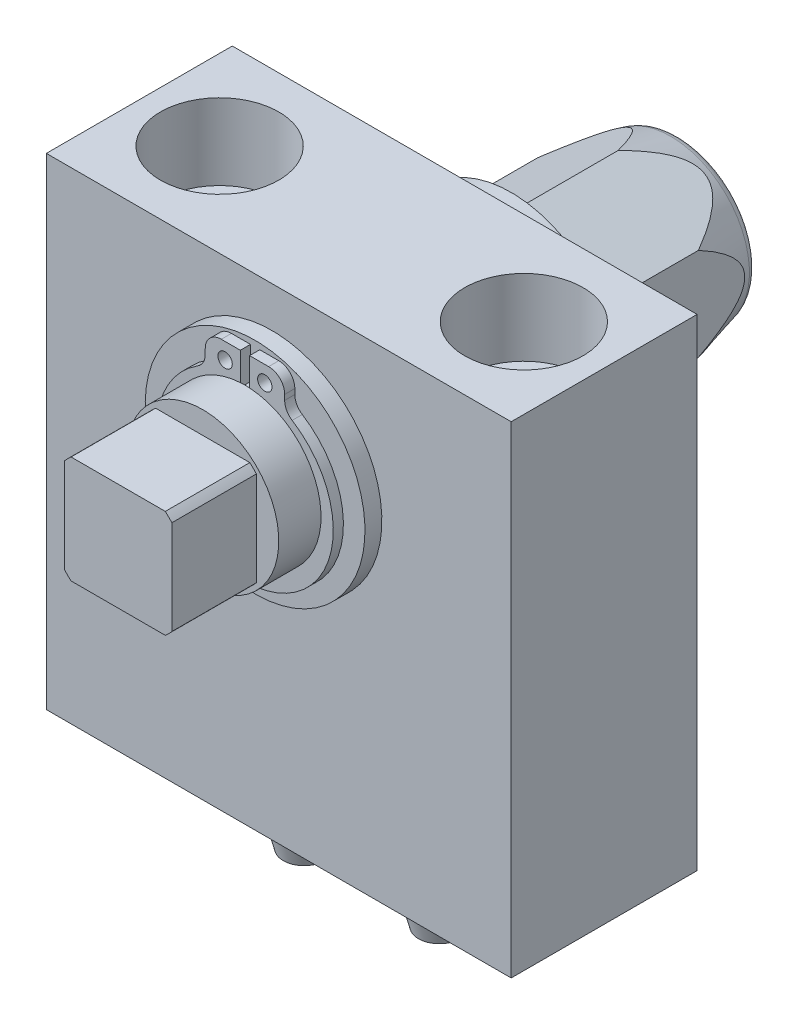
ISO-10303-21;
HEADER;
FILE_DESCRIPTION(('STEP AP214'),'2;1');
FILE_NAME('part.step','',(''),(''),'','','');
FILE_SCHEMA(('AUTOMOTIVE_DESIGN { 1 0 10303 214 1 1 1 1 }'));
ENDSEC;
DATA;
#1=APPLICATION_CONTEXT('core data for automotive mechanical design processes');
#2=APPLICATION_PROTOCOL_DEFINITION('international standard','automotive_design',2000,#1);
#3=PRODUCT_CONTEXT('',#1,'mechanical');
#4=PRODUCT('Part','Part','',(#3));
#5=PRODUCT_RELATED_PRODUCT_CATEGORY('part','',(#4));
#6=PRODUCT_DEFINITION_FORMATION('','',#4);
#7=PRODUCT_DEFINITION_CONTEXT('part definition',#1,'design');
#8=PRODUCT_DEFINITION('design','',#6,#7);
#9=PRODUCT_DEFINITION_SHAPE('','',#8);
#10=(LENGTH_UNIT() NAMED_UNIT(*) SI_UNIT(.MILLI.,.METRE.));
#11=(NAMED_UNIT(*) PLANE_ANGLE_UNIT() SI_UNIT($,.RADIAN.));
#12=(NAMED_UNIT(*) SI_UNIT($,.STERADIAN.) SOLID_ANGLE_UNIT());
#13=UNCERTAINTY_MEASURE_WITH_UNIT(LENGTH_MEASURE(1.E-05),#10,'distance_accuracy_value','');
#14=(GEOMETRIC_REPRESENTATION_CONTEXT(3) GLOBAL_UNCERTAINTY_ASSIGNED_CONTEXT((#13)) GLOBAL_UNIT_ASSIGNED_CONTEXT((#10,
#11,#12)) REPRESENTATION_CONTEXT('',''));
#15=CARTESIAN_POINT('',(0.,0.,0.));
#16=DIRECTION('',(0.,0.,1.));
#17=DIRECTION('',(1.,0.,0.));
#18=AXIS2_PLACEMENT_3D('',#15,#16,#17);
#19=CARTESIAN_POINT('',(-18.,57.,0.));
#20=DIRECTION('',(0.,-1.,0.));
#21=DIRECTION('',(0.,0.,-1.));
#22=AXIS2_PLACEMENT_3D('',#19,#20,#21);
#23=CYLINDRICAL_SURFACE('',#22,4.5);
#24=CARTESIAN_POINT('',(-18.,0.,0.));
#25=DIRECTION('',(0.,1.,0.));
#26=DIRECTION('',(0.,0.,1.));
#27=AXIS2_PLACEMENT_3D('',#24,#25,#26);
#28=CIRCLE('',#27,4.5);
#29=CARTESIAN_POINT('',(-18.,0.,4.5));
#30=VERTEX_POINT('',#29);
#31=EDGE_CURVE('P0_E122',#30,#30,#28,.T.);
#32=ORIENTED_EDGE('',*,*,#31,.F.);
#33=EDGE_LOOP('',(#32));
#34=FACE_BOUND('',#33,.T.);
#35=CARTESIAN_POINT('',(-18.,48.,0.));
#36=DIRECTION('',(0.,1.,0.));
#37=DIRECTION('',(0.,0.,1.));
#38=AXIS2_PLACEMENT_3D('',#35,#36,#37);
#39=CIRCLE('',#38,4.5);
#40=CARTESIAN_POINT('',(-18.,48.,4.5));
#41=VERTEX_POINT('',#40);
#42=EDGE_CURVE('P0_E103',#41,#41,#39,.T.);
#43=ORIENTED_EDGE('',*,*,#42,.T.);
#44=EDGE_LOOP('',(#43));
#45=FACE_BOUND('',#44,.T.);
#46=ADVANCED_FACE('P0_F17',(#34,#45),#23,.F.);
#47=CARTESIAN_POINT('',(18.,57.,0.));
#48=DIRECTION('',(0.,-1.,0.));
#49=DIRECTION('',(0.,0.,-1.));
#50=AXIS2_PLACEMENT_3D('',#47,#48,#49);
#51=CYLINDRICAL_SURFACE('',#50,4.5);
#52=CARTESIAN_POINT('',(18.,0.,0.));
#53=DIRECTION('',(0.,1.,0.));
#54=DIRECTION('',(0.,0.,1.));
#55=AXIS2_PLACEMENT_3D('',#52,#53,#54);
#56=CIRCLE('',#55,4.5);
#57=CARTESIAN_POINT('',(18.,0.,4.5));
#58=VERTEX_POINT('',#57);
#59=EDGE_CURVE('P0_E116',#58,#58,#56,.T.);
#60=ORIENTED_EDGE('',*,*,#59,.F.);
#61=EDGE_LOOP('',(#60));
#62=FACE_BOUND('',#61,.T.);
#63=CARTESIAN_POINT('',(18.,48.,0.));
#64=DIRECTION('',(0.,1.,0.));
#65=DIRECTION('',(0.,0.,1.));
#66=AXIS2_PLACEMENT_3D('',#63,#64,#65);
#67=CIRCLE('',#66,4.5);
#68=CARTESIAN_POINT('',(18.,48.,4.5));
#69=VERTEX_POINT('',#68);
#70=EDGE_CURVE('P0_E109',#69,#69,#67,.T.);
#71=ORIENTED_EDGE('',*,*,#70,.T.);
#72=EDGE_LOOP('',(#71));
#73=FACE_BOUND('',#72,.T.);
#74=ADVANCED_FACE('P0_F199',(#62,#73),#51,.F.);
#75=CARTESIAN_POINT('',(0.,57.,0.));
#76=DIRECTION('',(0.,-1.,0.));
#77=DIRECTION('',(0.,0.,-1.));
#78=AXIS2_PLACEMENT_3D('',#75,#76,#77);
#79=PLANE('',#78);
#80=CARTESIAN_POINT('',(-18.,57.,0.));
#81=DIRECTION('',(0.,1.,0.));
#82=DIRECTION('',(0.,0.,1.));
#83=AXIS2_PLACEMENT_3D('',#80,#81,#82);
#84=CIRCLE('',#83,7.);
#85=CARTESIAN_POINT('',(-18.,57.,7.));
#86=VERTEX_POINT('',#85);
#87=EDGE_CURVE('P0_E99',#86,#86,#84,.T.);
#88=ORIENTED_EDGE('',*,*,#87,.F.);
#89=EDGE_LOOP('',(#88));
#90=FACE_BOUND('',#89,.T.);
#91=CARTESIAN_POINT('',(18.,57.,0.));
#92=DIRECTION('',(0.,1.,0.));
#93=DIRECTION('',(0.,0.,1.));
#94=AXIS2_PLACEMENT_3D('',#91,#92,#93);
#95=CIRCLE('',#94,7.);
#96=CARTESIAN_POINT('',(18.,57.,7.));
#97=VERTEX_POINT('',#96);
#98=EDGE_CURVE('P0_E110',#97,#97,#95,.T.);
#99=ORIENTED_EDGE('',*,*,#98,.F.);
#100=EDGE_LOOP('',(#99));
#101=FACE_BOUND('',#100,.T.);
#102=DIRECTION('',(0.,0.,-1.));
#103=VECTOR('',#102,1.);
#104=CARTESIAN_POINT('',(27.5,57.,11.));
#105=LINE('',#104,#103);
#106=CARTESIAN_POINT('',(27.5,57.,11.));
#107=VERTEX_POINT('',#106);
#108=CARTESIAN_POINT('',(27.5,57.,-11.));
#109=VERTEX_POINT('',#108);
#110=EDGE_CURVE('P0_E126',#107,#109,#105,.T.);
#111=ORIENTED_EDGE('',*,*,#110,.T.);
#112=DIRECTION('',(-1.,0.,0.));
#113=VECTOR('',#112,1.);
#114=CARTESIAN_POINT('',(-27.5,57.,-11.));
#115=LINE('',#114,#113);
#116=CARTESIAN_POINT('',(-27.5,57.,-11.));
#117=VERTEX_POINT('',#116);
#118=EDGE_CURVE('P0_E67',#109,#117,#115,.T.);
#119=ORIENTED_EDGE('',*,*,#118,.T.);
#120=DIRECTION('',(0.,0.,1.));
#121=VECTOR('',#120,1.);
#122=CARTESIAN_POINT('',(-27.5,57.,11.));
#123=LINE('',#122,#121);
#124=CARTESIAN_POINT('',(-27.5,57.,11.));
#125=VERTEX_POINT('',#124);
#126=EDGE_CURVE('P0_E129',#117,#125,#123,.T.);
#127=ORIENTED_EDGE('',*,*,#126,.T.);
#128=DIRECTION('',(1.,0.,0.));
#129=VECTOR('',#128,1.);
#130=CARTESIAN_POINT('',(-27.5,57.,11.));
#131=LINE('',#130,#129);
#132=EDGE_CURVE('P0_E35',#125,#107,#131,.T.);
#133=ORIENTED_EDGE('',*,*,#132,.T.);
#134=EDGE_LOOP('',(#111,#119,#127,#133));
#135=FACE_BOUND('',#134,.T.);
#136=ADVANCED_FACE('P0_F205',(#90,#101,#135),#79,.F.);
#137=CARTESIAN_POINT('',(0.,0.,0.));
#138=DIRECTION('',(0.,-1.,0.));
#139=DIRECTION('',(0.,0.,-1.));
#140=AXIS2_PLACEMENT_3D('',#137,#138,#139);
#141=PLANE('',#140);
#142=CARTESIAN_POINT('',(8.,0.,0.));
#143=DIRECTION('',(0.,-1.,0.));
#144=DIRECTION('',(0.,0.,-1.));
#145=AXIS2_PLACEMENT_3D('',#142,#143,#144);
#146=CIRCLE('',#145,3.);
#147=CARTESIAN_POINT('',(8.,0.,-3.));
#148=VERTEX_POINT('',#147);
#149=EDGE_CURVE('P0_E87',#148,#148,#146,.T.);
#150=ORIENTED_EDGE('',*,*,#149,.F.);
#151=EDGE_LOOP('',(#150));
#152=FACE_BOUND('',#151,.T.);
#153=CARTESIAN_POINT('',(-8.,0.,0.));
#154=DIRECTION('',(0.,-1.,0.));
#155=DIRECTION('',(0.,0.,-1.));
#156=AXIS2_PLACEMENT_3D('',#153,#154,#155);
#157=CIRCLE('',#156,3.);
#158=CARTESIAN_POINT('',(-8.,0.,-3.));
#159=VERTEX_POINT('',#158);
#160=EDGE_CURVE('P0_E86',#159,#159,#157,.T.);
#161=ORIENTED_EDGE('',*,*,#160,.F.);
#162=EDGE_LOOP('',(#161));
#163=FACE_BOUND('',#162,.T.);
#164=ORIENTED_EDGE('',*,*,#31,.T.);
#165=EDGE_LOOP('',(#164));
#166=FACE_BOUND('',#165,.T.);
#167=DIRECTION('',(0.,0.,-1.));
#168=VECTOR('',#167,1.);
#169=CARTESIAN_POINT('',(27.5,0.,11.));
#170=LINE('',#169,#168);
#171=CARTESIAN_POINT('',(27.5,0.,11.));
#172=VERTEX_POINT('',#171);
#173=CARTESIAN_POINT('',(27.5,0.,-11.));
#174=VERTEX_POINT('',#173);
#175=EDGE_CURVE('P0_E125',#172,#174,#170,.T.);
#176=ORIENTED_EDGE('',*,*,#175,.F.);
#177=DIRECTION('',(1.,0.,0.));
#178=VECTOR('',#177,1.);
#179=CARTESIAN_POINT('',(-27.5,0.,11.));
#180=LINE('',#179,#178);
#181=CARTESIAN_POINT('',(-27.5,0.,11.));
#182=VERTEX_POINT('',#181);
#183=EDGE_CURVE('P0_E59',#182,#172,#180,.T.);
#184=ORIENTED_EDGE('',*,*,#183,.F.);
#185=DIRECTION('',(0.,0.,1.));
#186=VECTOR('',#185,1.);
#187=CARTESIAN_POINT('',(-27.5,0.,11.));
#188=LINE('',#187,#186);
#189=CARTESIAN_POINT('',(-27.5,0.,-11.));
#190=VERTEX_POINT('',#189);
#191=EDGE_CURVE('P0_E53',#190,#182,#188,.T.);
#192=ORIENTED_EDGE('',*,*,#191,.F.);
#193=DIRECTION('',(-1.,0.,0.));
#194=VECTOR('',#193,1.);
#195=CARTESIAN_POINT('',(-27.5,0.,-11.));
#196=LINE('',#195,#194);
#197=EDGE_CURVE('P0_E135',#174,#190,#196,.T.);
#198=ORIENTED_EDGE('',*,*,#197,.F.);
#199=EDGE_LOOP('',(#176,#184,#192,#198));
#200=FACE_BOUND('',#199,.T.);
#201=ORIENTED_EDGE('',*,*,#59,.T.);
#202=EDGE_LOOP('',(#201));
#203=FACE_BOUND('',#202,.T.);
#204=ADVANCED_FACE('P0_F214',(#152,#163,#166,#200,#203),#141,.T.);
#205=CARTESIAN_POINT('',(27.5,57.,11.));
#206=DIRECTION('',(-1.,0.,0.));
#207=DIRECTION('',(0.,0.,1.));
#208=AXIS2_PLACEMENT_3D('',#205,#206,#207);
#209=PLANE('',#208);
#210=ORIENTED_EDGE('',*,*,#175,.T.);
#211=DIRECTION('',(0.,-1.,0.));
#212=VECTOR('',#211,1.);
#213=CARTESIAN_POINT('',(27.5,57.,-11.));
#214=LINE('',#213,#212);
#215=EDGE_CURVE('P0_E144',#109,#174,#214,.T.);
#216=ORIENTED_EDGE('',*,*,#215,.F.);
#217=ORIENTED_EDGE('',*,*,#110,.F.);
#218=DIRECTION('',(0.,-1.,0.));
#219=VECTOR('',#218,1.);
#220=CARTESIAN_POINT('',(27.5,57.,11.));
#221=LINE('',#220,#219);
#222=EDGE_CURVE('P0_E132',#107,#172,#221,.T.);
#223=ORIENTED_EDGE('',*,*,#222,.T.);
#224=EDGE_LOOP('',(#210,#216,#217,#223));
#225=FACE_BOUND('',#224,.T.);
#226=ADVANCED_FACE('P0_F19',(#225),#209,.F.);
#227=CARTESIAN_POINT('',(-27.5,57.,-11.));
#228=DIRECTION('',(0.,0.,1.));
#229=DIRECTION('',(1.,0.,0.));
#230=AXIS2_PLACEMENT_3D('',#227,#228,#229);
#231=PLANE('',#230);
#232=CARTESIAN_POINT('',(0.,40.,-11.));
#233=DIRECTION('',(0.,0.,1.));
#234=DIRECTION('',(1.,0.,0.));
#235=AXIS2_PLACEMENT_3D('',#232,#233,#234);
#236=CIRCLE('',#235,10.);
#237=CARTESIAN_POINT('',(10.,40.,-11.));
#238=VERTEX_POINT('',#237);
#239=EDGE_CURVE('P0_E113',#238,#238,#236,.T.);
#240=ORIENTED_EDGE('',*,*,#239,.T.);
#241=EDGE_LOOP('',(#240));
#242=FACE_BOUND('',#241,.T.);
#243=ORIENTED_EDGE('',*,*,#197,.T.);
#244=DIRECTION('',(0.,-1.,0.));
#245=VECTOR('',#244,1.);
#246=CARTESIAN_POINT('',(-27.5,57.,-11.));
#247=LINE('',#246,#245);
#248=EDGE_CURVE('P0_E142',#117,#190,#247,.T.);
#249=ORIENTED_EDGE('',*,*,#248,.F.);
#250=ORIENTED_EDGE('',*,*,#118,.F.);
#251=ORIENTED_EDGE('',*,*,#215,.T.);
#252=EDGE_LOOP('',(#243,#249,#250,#251));
#253=FACE_BOUND('',#252,.T.);
#254=ADVANCED_FACE('P0_F226',(#242,#253),#231,.F.);
#255=CARTESIAN_POINT('',(-27.5,57.,11.));
#256=DIRECTION('',(1.,0.,0.));
#257=DIRECTION('',(0.,0.,-1.));
#258=AXIS2_PLACEMENT_3D('',#255,#256,#257);
#259=PLANE('',#258);
#260=ORIENTED_EDGE('',*,*,#191,.T.);
#261=DIRECTION('',(0.,-1.,0.));
#262=VECTOR('',#261,1.);
#263=CARTESIAN_POINT('',(-27.5,57.,11.));
#264=LINE('',#263,#262);
#265=EDGE_CURVE('P0_E140',#125,#182,#264,.T.);
#266=ORIENTED_EDGE('',*,*,#265,.F.);
#267=ORIENTED_EDGE('',*,*,#126,.F.);
#268=ORIENTED_EDGE('',*,*,#248,.T.);
#269=EDGE_LOOP('',(#260,#266,#267,#268));
#270=FACE_BOUND('',#269,.T.);
#271=ADVANCED_FACE('P0_F223',(#270),#259,.F.);
#272=CARTESIAN_POINT('',(-27.5,57.,11.));
#273=DIRECTION('',(0.,0.,-1.));
#274=DIRECTION('',(-1.,0.,0.));
#275=AXIS2_PLACEMENT_3D('',#272,#273,#274);
#276=PLANE('',#275);
#277=CARTESIAN_POINT('',(0.,40.,11.));
#278=DIRECTION('',(0.,0.,1.));
#279=DIRECTION('',(1.,0.,0.));
#280=AXIS2_PLACEMENT_3D('',#277,#278,#279);
#281=CIRCLE('',#280,10.);
#282=CARTESIAN_POINT('',(10.,40.,11.));
#283=VERTEX_POINT('',#282);
#284=EDGE_CURVE('P0_E117',#283,#283,#281,.T.);
#285=ORIENTED_EDGE('',*,*,#284,.F.);
#286=EDGE_LOOP('',(#285));
#287=FACE_BOUND('',#286,.T.);
#288=ORIENTED_EDGE('',*,*,#183,.T.);
#289=ORIENTED_EDGE('',*,*,#222,.F.);
#290=ORIENTED_EDGE('',*,*,#132,.F.);
#291=ORIENTED_EDGE('',*,*,#265,.T.);
#292=EDGE_LOOP('',(#288,#289,#290,#291));
#293=FACE_BOUND('',#292,.T.);
#294=ADVANCED_FACE('P0_F219',(#287,#293),#276,.F.);
#295=CARTESIAN_POINT('',(0.,40.,-11.));
#296=DIRECTION('',(0.,0.,1.));
#297=DIRECTION('',(1.,0.,0.));
#298=AXIS2_PLACEMENT_3D('',#295,#296,#297);
#299=CYLINDRICAL_SURFACE('',#298,10.);
#300=ORIENTED_EDGE('',*,*,#239,.F.);
#301=EDGE_LOOP('',(#300));
#302=FACE_BOUND('',#301,.T.);
#303=ORIENTED_EDGE('',*,*,#284,.T.);
#304=EDGE_LOOP('',(#303));
#305=FACE_BOUND('',#304,.T.);
#306=ADVANCED_FACE('P0_F222',(#302,#305),#299,.F.);
#307=CARTESIAN_POINT('',(18.,48.,0.));
#308=DIRECTION('',(0.,1.,0.));
#309=DIRECTION('',(0.,0.,1.));
#310=AXIS2_PLACEMENT_3D('',#307,#308,#309);
#311=CYLINDRICAL_SURFACE('',#310,7.);
#312=CARTESIAN_POINT('',(18.,48.,0.));
#313=DIRECTION('',(0.,1.,0.));
#314=DIRECTION('',(0.,0.,1.));
#315=AXIS2_PLACEMENT_3D('',#312,#313,#314);
#316=CIRCLE('',#315,7.);
#317=CARTESIAN_POINT('',(18.,48.,7.));
#318=VERTEX_POINT('',#317);
#319=EDGE_CURVE('P0_E106',#318,#318,#316,.T.);
#320=ORIENTED_EDGE('',*,*,#319,.F.);
#321=EDGE_LOOP('',(#320));
#322=FACE_BOUND('',#321,.T.);
#323=ORIENTED_EDGE('',*,*,#98,.T.);
#324=EDGE_LOOP('',(#323));
#325=FACE_BOUND('',#324,.T.);
#326=ADVANCED_FACE('P0_F248',(#322,#325),#311,.F.);
#327=CARTESIAN_POINT('',(18.,48.,0.));
#328=DIRECTION('',(0.,1.,0.));
#329=DIRECTION('',(0.,0.,1.));
#330=AXIS2_PLACEMENT_3D('',#327,#328,#329);
#331=PLANE('',#330);
#332=ORIENTED_EDGE('',*,*,#70,.F.);
#333=EDGE_LOOP('',(#332));
#334=FACE_BOUND('',#333,.T.);
#335=ORIENTED_EDGE('',*,*,#319,.T.);
#336=EDGE_LOOP('',(#335));
#337=FACE_BOUND('',#336,.T.);
#338=ADVANCED_FACE('P0_F244',(#334,#337),#331,.T.);
#339=CARTESIAN_POINT('',(-18.,48.,0.));
#340=DIRECTION('',(0.,1.,0.));
#341=DIRECTION('',(0.,0.,1.));
#342=AXIS2_PLACEMENT_3D('',#339,#340,#341);
#343=CYLINDRICAL_SURFACE('',#342,7.);
#344=CARTESIAN_POINT('',(-18.,48.,0.));
#345=DIRECTION('',(0.,1.,0.));
#346=DIRECTION('',(0.,0.,1.));
#347=AXIS2_PLACEMENT_3D('',#344,#345,#346);
#348=CIRCLE('',#347,7.);
#349=CARTESIAN_POINT('',(-18.,48.,7.));
#350=VERTEX_POINT('',#349);
#351=EDGE_CURVE('P0_E100',#350,#350,#348,.T.);
#352=ORIENTED_EDGE('',*,*,#351,.F.);
#353=EDGE_LOOP('',(#352));
#354=FACE_BOUND('',#353,.T.);
#355=ORIENTED_EDGE('',*,*,#87,.T.);
#356=EDGE_LOOP('',(#355));
#357=FACE_BOUND('',#356,.T.);
#358=ADVANCED_FACE('P0_F247',(#354,#357),#343,.F.);
#359=CARTESIAN_POINT('',(-18.,48.,0.));
#360=DIRECTION('',(0.,1.,0.));
#361=DIRECTION('',(0.,0.,1.));
#362=AXIS2_PLACEMENT_3D('',#359,#360,#361);
#363=PLANE('',#362);
#364=ORIENTED_EDGE('',*,*,#42,.F.);
#365=EDGE_LOOP('',(#364));
#366=FACE_BOUND('',#365,.T.);
#367=ORIENTED_EDGE('',*,*,#351,.T.);
#368=EDGE_LOOP('',(#367));
#369=FACE_BOUND('',#368,.T.);
#370=ADVANCED_FACE('P0_F169',(#366,#369),#363,.T.);
#371=CARTESIAN_POINT('',(8.,20.,0.));
#372=DIRECTION('',(0.,1.,0.));
#373=DIRECTION('',(0.,0.,1.));
#374=AXIS2_PLACEMENT_3D('',#371,#372,#373);
#375=CYLINDRICAL_SURFACE('',#374,3.);
#376=ORIENTED_EDGE('',*,*,#149,.T.);
#377=EDGE_LOOP('',(#376));
#378=FACE_BOUND('',#377,.T.);
#379=CARTESIAN_POINT('',(8.,-8.,0.));
#380=DIRECTION('',(0.,1.,0.));
#381=DIRECTION('',(0.,0.,1.));
#382=AXIS2_PLACEMENT_3D('',#379,#380,#381);
#383=CIRCLE('',#382,3.);
#384=CARTESIAN_POINT('',(8.,-8.,3.));
#385=VERTEX_POINT('',#384);
#386=EDGE_CURVE('P0_E93',#385,#385,#383,.T.);
#387=ORIENTED_EDGE('',*,*,#386,.T.);
#388=EDGE_LOOP('',(#387));
#389=FACE_BOUND('',#388,.T.);
#390=ADVANCED_FACE('P0_F165',(#378,#389),#375,.T.);
#391=CARTESIAN_POINT('',(8.,-10.,0.));
#392=DIRECTION('',(0.,1.,0.));
#393=DIRECTION('',(0.,0.,1.));
#394=AXIS2_PLACEMENT_3D('',#391,#392,#393);
#395=CONICAL_SURFACE('',#394,2.46410161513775,0.26179938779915);
#396=ORIENTED_EDGE('',*,*,#386,.F.);
#397=EDGE_LOOP('',(#396));
#398=FACE_BOUND('',#397,.T.);
#399=CARTESIAN_POINT('',(8.,-10.,0.));
#400=DIRECTION('',(0.,1.,0.));
#401=DIRECTION('',(0.,0.,1.));
#402=AXIS2_PLACEMENT_3D('',#399,#400,#401);
#403=CIRCLE('',#402,2.46410161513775);
#404=CARTESIAN_POINT('',(8.,-10.,2.46410161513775));
#405=VERTEX_POINT('',#404);
#406=EDGE_CURVE('P0_E494',#405,#405,#403,.T.);
#407=ORIENTED_EDGE('',*,*,#406,.T.);
#408=EDGE_LOOP('',(#407));
#409=FACE_BOUND('',#408,.T.);
#410=ADVANCED_FACE('P0_F168',(#398,#409),#395,.T.);
#411=CARTESIAN_POINT('',(8.,-10.,0.));
#412=DIRECTION('',(0.,1.,0.));
#413=DIRECTION('',(0.,0.,1.));
#414=AXIS2_PLACEMENT_3D('',#411,#412,#413);
#415=PLANE('',#414);
#416=ORIENTED_EDGE('',*,*,#406,.F.);
#417=EDGE_LOOP('',(#416));
#418=FACE_BOUND('',#417,.T.);
#419=ADVANCED_FACE('P0_F173',(#418),#415,.F.);
#420=CARTESIAN_POINT('',(-8.,20.,0.));
#421=DIRECTION('',(0.,1.,0.));
#422=DIRECTION('',(0.,0.,1.));
#423=AXIS2_PLACEMENT_3D('',#420,#421,#422);
#424=CYLINDRICAL_SURFACE('',#423,3.);
#425=ORIENTED_EDGE('',*,*,#160,.T.);
#426=EDGE_LOOP('',(#425));
#427=FACE_BOUND('',#426,.T.);
#428=CARTESIAN_POINT('',(-8.,-8.,0.));
#429=DIRECTION('',(0.,1.,0.));
#430=DIRECTION('',(0.,0.,1.));
#431=AXIS2_PLACEMENT_3D('',#428,#429,#430);
#432=CIRCLE('',#431,3.);
#433=CARTESIAN_POINT('',(-8.,-8.,3.));
#434=VERTEX_POINT('',#433);
#435=EDGE_CURVE('P0_E493',#434,#434,#432,.T.);
#436=ORIENTED_EDGE('',*,*,#435,.T.);
#437=EDGE_LOOP('',(#436));
#438=FACE_BOUND('',#437,.T.);
#439=ADVANCED_FACE('P0_F177',(#427,#438),#424,.T.);
#440=CARTESIAN_POINT('',(-8.,-10.,0.));
#441=DIRECTION('',(0.,1.,0.));
#442=DIRECTION('',(0.,0.,1.));
#443=AXIS2_PLACEMENT_3D('',#440,#441,#442);
#444=CONICAL_SURFACE('',#443,2.46410161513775,0.26179938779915);
#445=ORIENTED_EDGE('',*,*,#435,.F.);
#446=EDGE_LOOP('',(#445));
#447=FACE_BOUND('',#446,.T.);
#448=CARTESIAN_POINT('',(-8.,-10.,0.));
#449=DIRECTION('',(0.,1.,0.));
#450=DIRECTION('',(0.,0.,1.));
#451=AXIS2_PLACEMENT_3D('',#448,#449,#450);
#452=CIRCLE('',#451,2.46410161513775);
#453=CARTESIAN_POINT('',(-8.,-10.,2.46410161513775));
#454=VERTEX_POINT('',#453);
#455=EDGE_CURVE('P0_E495',#454,#454,#452,.T.);
#456=ORIENTED_EDGE('',*,*,#455,.T.);
#457=EDGE_LOOP('',(#456));
#458=FACE_BOUND('',#457,.T.);
#459=ADVANCED_FACE('P0_F187',(#447,#458),#444,.T.);
#460=CARTESIAN_POINT('',(-8.,-10.,0.));
#461=DIRECTION('',(0.,1.,0.));
#462=DIRECTION('',(0.,0.,1.));
#463=AXIS2_PLACEMENT_3D('',#460,#461,#462);
#464=PLANE('',#463);
#465=ORIENTED_EDGE('',*,*,#455,.F.);
#466=EDGE_LOOP('',(#465));
#467=FACE_BOUND('',#466,.T.);
#468=ADVANCED_FACE('P0_F191',(#467),#464,.F.);
#469=CLOSED_SHELL('',(#46,#74,#136,#204,#226,#254,#271,#294,#306,#326,#338,#358,#370,#390,#410,
#419,#439,#459,#468));
#470=CARTESIAN_POINT('',(-8.,4.,0.));
#471=DIRECTION('',(0.,1.,0.));
#472=DIRECTION('',(0.,0.,-1.));
#473=AXIS2_PLACEMENT_3D('',#470,#471,#472);
#474=SPHERICAL_SURFACE('',#473,6.);
#475=CARTESIAN_POINT('',(-8.,9.19615242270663,0.));
#476=DIRECTION('',(0.,-1.,0.));
#477=DIRECTION('',(0.,0.,-1.));
#478=AXIS2_PLACEMENT_3D('',#475,#476,#477);
#479=CIRCLE('',#478,3.);
#480=CARTESIAN_POINT('',(-8.,9.19615242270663,-3.));
#481=VERTEX_POINT('',#480);
#482=EDGE_CURVE('P0_E10',#481,#481,#479,.F.);
#483=ORIENTED_EDGE('',*,*,#482,.T.);
#484=EDGE_LOOP('',(#483));
#485=FACE_BOUND('',#484,.T.);
#486=ADVANCED_FACE('P0_F179',(#485),#474,.T.);
#487=CARTESIAN_POINT('',(-8.,12.,0.));
#488=DIRECTION('',(0.,-1.,0.));
#489=DIRECTION('',(0.,0.,-1.));
#490=AXIS2_PLACEMENT_3D('',#487,#488,#489);
#491=CONICAL_SURFACE('',#490,3.,1.02974425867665);
#492=CARTESIAN_POINT('',(-8.,13.8025818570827,0.));
#493=VERTEX_POINT('',#492);
#494=VERTEX_LOOP('',#493);
#495=FACE_BOUND('',#494,.T.);
#496=CARTESIAN_POINT('',(-8.,12.,0.));
#497=DIRECTION('',(0.,-1.,0.));
#498=DIRECTION('',(0.,0.,-1.));
#499=AXIS2_PLACEMENT_3D('',#496,#497,#498);
#500=CIRCLE('',#499,3.);
#501=CARTESIAN_POINT('',(-8.,12.,-3.));
#502=VERTEX_POINT('',#501);
#503=EDGE_CURVE('P0_E90',#502,#502,#500,.T.);
#504=ORIENTED_EDGE('',*,*,#503,.T.);
#505=EDGE_LOOP('',(#504));
#506=FACE_BOUND('',#505,.T.);
#507=ADVANCED_FACE('P0_F182',(#495,#506),#491,.F.);
#508=CARTESIAN_POINT('',(-8.,0.,0.));
#509=DIRECTION('',(0.,-1.,0.));
#510=DIRECTION('',(0.,0.,-1.));
#511=AXIS2_PLACEMENT_3D('',#508,#509,#510);
#512=CYLINDRICAL_SURFACE('',#511,3.);
#513=ORIENTED_EDGE('',*,*,#503,.F.);
#514=EDGE_LOOP('',(#513));
#515=FACE_BOUND('',#514,.T.);
#516=ORIENTED_EDGE('',*,*,#482,.F.);
#517=EDGE_LOOP('',(#516));
#518=FACE_BOUND('',#517,.T.);
#519=ADVANCED_FACE('P0_F270',(#515,#518),#512,.F.);
#520=CLOSED_SHELL('',(#486,#507,#519));
#521=CARTESIAN_POINT('',(8.,4.,0.));
#522=DIRECTION('',(0.,1.,0.));
#523=DIRECTION('',(0.,0.,-1.));
#524=AXIS2_PLACEMENT_3D('',#521,#522,#523);
#525=SPHERICAL_SURFACE('',#524,6.);
#526=CARTESIAN_POINT('',(8.,9.19615242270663,0.));
#527=DIRECTION('',(0.,-1.,0.));
#528=DIRECTION('',(0.,0.,-1.));
#529=AXIS2_PLACEMENT_3D('',#526,#527,#528);
#530=CIRCLE('',#529,3.);
#531=CARTESIAN_POINT('',(8.,9.19615242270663,-3.));
#532=VERTEX_POINT('',#531);
#533=EDGE_CURVE('P0_E27',#532,#532,#530,.F.);
#534=ORIENTED_EDGE('',*,*,#533,.T.);
#535=EDGE_LOOP('',(#534));
#536=FACE_BOUND('',#535,.T.);
#537=ADVANCED_FACE('P0_F78',(#536),#525,.T.);
#538=CARTESIAN_POINT('',(8.,12.,0.));
#539=DIRECTION('',(0.,-1.,0.));
#540=DIRECTION('',(0.,0.,-1.));
#541=AXIS2_PLACEMENT_3D('',#538,#539,#540);
#542=CONICAL_SURFACE('',#541,3.,1.02974425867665);
#543=CARTESIAN_POINT('',(8.,13.8025818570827,0.));
#544=VERTEX_POINT('',#543);
#545=VERTEX_LOOP('',#544);
#546=FACE_BOUND('',#545,.T.);
#547=CARTESIAN_POINT('',(8.,12.,0.));
#548=DIRECTION('',(0.,-1.,0.));
#549=DIRECTION('',(0.,0.,-1.));
#550=AXIS2_PLACEMENT_3D('',#547,#548,#549);
#551=CIRCLE('',#550,3.);
#552=CARTESIAN_POINT('',(8.,12.,-3.));
#553=VERTEX_POINT('',#552);
#554=EDGE_CURVE('P0_E84',#553,#553,#551,.T.);
#555=ORIENTED_EDGE('',*,*,#554,.T.);
#556=EDGE_LOOP('',(#555));
#557=FACE_BOUND('',#556,.T.);
#558=ADVANCED_FACE('P0_F74',(#546,#557),#542,.F.);
#559=CARTESIAN_POINT('',(8.,0.,0.));
#560=DIRECTION('',(0.,-1.,0.));
#561=DIRECTION('',(0.,0.,-1.));
#562=AXIS2_PLACEMENT_3D('',#559,#560,#561);
#563=CYLINDRICAL_SURFACE('',#562,3.);
#564=ORIENTED_EDGE('',*,*,#554,.F.);
#565=EDGE_LOOP('',(#564));
#566=FACE_BOUND('',#565,.T.);
#567=ORIENTED_EDGE('',*,*,#533,.F.);
#568=EDGE_LOOP('',(#567));
#569=FACE_BOUND('',#568,.T.);
#570=ADVANCED_FACE('P0_F77',(#566,#569),#563,.F.);
#571=CLOSED_SHELL('',(#537,#558,#570));
#572=ORIENTED_CLOSED_SHELL('',*,#520,.T.);
#573=ORIENTED_CLOSED_SHELL('',*,#571,.T.);
#574=BREP_WITH_VOIDS('P0_B1',#469,(#572,#573));
#575=CARTESIAN_POINT('',(0.,40.,46.75));
#576=DIRECTION('',(0.,0.,1.));
#577=DIRECTION('',(-1.,0.,0.));
#578=AXIS2_PLACEMENT_3D('',#575,#576,#577);
#579=CYLINDRICAL_SURFACE('',#578,9.);
#580=CARTESIAN_POINT('',(0.,40.,-11.6));
#581=DIRECTION('',(0.,0.,-1.));
#582=DIRECTION('',(1.,0.,0.));
#583=AXIS2_PLACEMENT_3D('',#580,#581,#582);
#584=CIRCLE('',#583,9.);
#585=CARTESIAN_POINT('',(9.,40.,-11.6));
#586=VERTEX_POINT('',#585);
#587=EDGE_CURVE('P1_E27',#586,#586,#584,.F.);
#588=ORIENTED_EDGE('',*,*,#587,.T.);
#589=EDGE_LOOP('',(#588));
#590=FACE_BOUND('',#589,.T.);
#591=CARTESIAN_POINT('',(0.,40.,11.8));
#592=DIRECTION('',(0.,0.,-1.));
#593=DIRECTION('',(0.479360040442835,0.877618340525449,0.));
#594=AXIS2_PLACEMENT_3D('',#591,#592,#593);
#595=CIRCLE('',#594,9.);
#596=CARTESIAN_POINT('',(4.31424036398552,47.898565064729,11.8));
#597=VERTEX_POINT('',#596);
#598=EDGE_CURVE('P1_E585',#597,#597,#595,.T.);
#599=ORIENTED_EDGE('',*,*,#598,.T.);
#600=EDGE_LOOP('',(#599));
#601=FACE_BOUND('',#600,.T.);
#602=DIRECTION('',(0.,0.,1.));
#603=VECTOR('',#602,1.);
#604=CARTESIAN_POINT('',(0.19999999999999,48.9977775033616,9.));
#605=LINE('',#604,#603);
#606=CARTESIAN_POINT('',(0.200000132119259,48.9977775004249,-11.5));
#607=VERTEX_POINT('',#606);
#608=CARTESIAN_POINT('',(0.199999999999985,48.9977775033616,8.7));
#609=VERTEX_POINT('',#608);
#610=EDGE_CURVE('P1_E35',#607,#609,#605,.T.);
#611=ORIENTED_EDGE('',*,*,#610,.F.);
#612=CARTESIAN_POINT('',(0.,40.,-11.5));
#613=DIRECTION('',(0.,0.,1.));
#614=DIRECTION('',(1.,0.,0.));
#615=AXIS2_PLACEMENT_3D('',#612,#613,#614);
#616=CIRCLE('',#615,9.);
#617=CARTESIAN_POINT('',(-0.20000000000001,48.9977775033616,-11.5));
#618=VERTEX_POINT('',#617);
#619=EDGE_CURVE('P1_E274',#618,#607,#616,.T.);
#620=ORIENTED_EDGE('',*,*,#619,.F.);
#621=DIRECTION('',(0.,0.,-1.));
#622=VECTOR('',#621,1.);
#623=CARTESIAN_POINT('',(-0.20000000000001,48.9977775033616,9.));
#624=LINE('',#623,#622);
#625=CARTESIAN_POINT('',(-0.199999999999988,48.9977775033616,8.7));
#626=VERTEX_POINT('',#625);
#627=EDGE_CURVE('P1_E277',#626,#618,#624,.T.);
#628=ORIENTED_EDGE('',*,*,#627,.F.);
#629=CARTESIAN_POINT('',(0.,40.,8.7));
#630=DIRECTION('',(0.,0.,1.));
#631=DIRECTION('',(1.,0.,0.));
#632=AXIS2_PLACEMENT_3D('',#629,#630,#631);
#633=CIRCLE('',#632,9.);
#634=EDGE_CURVE('P1_E40',#626,#609,#633,.T.);
#635=ORIENTED_EDGE('',*,*,#634,.T.);
#636=EDGE_LOOP('',(#611,#620,#628,#635));
#637=FACE_BOUND('',#636,.T.);
#638=ADVANCED_FACE('P1_F17',(#590,#601,#637),#579,.T.);
#639=CARTESIAN_POINT('',(0.,31.,-12.));
#640=DIRECTION('',(0.,0.,-1.));
#641=DIRECTION('',(1.,0.,0.));
#642=AXIS2_PLACEMENT_3D('',#639,#640,#641);
#643=PLANE('',#642);
#644=CARTESIAN_POINT('',(0.,40.,-12.));
#645=DIRECTION('',(0.,0.,-1.));
#646=DIRECTION('',(1.,0.,0.));
#647=AXIS2_PLACEMENT_3D('',#644,#645,#646);
#648=CIRCLE('',#647,9.4);
#649=CARTESIAN_POINT('',(9.4,40.,-12.));
#650=VERTEX_POINT('',#649);
#651=EDGE_CURVE('P1_E11',#650,#650,#648,.T.);
#652=ORIENTED_EDGE('',*,*,#651,.T.);
#653=EDGE_LOOP('',(#652));
#654=FACE_BOUND('',#653,.T.);
#655=DIRECTION('',(-0.499999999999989,0.866025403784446,0.));
#656=VECTOR('',#655,1.);
#657=CARTESIAN_POINT('',(-0.200000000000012,50.346410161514,-12.));
#658=LINE('',#657,#656);
#659=CARTESIAN_POINT('',(-0.200000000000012,50.346410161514,-12.));
#660=VERTEX_POINT('',#659);
#661=CARTESIAN_POINT('',(-1.66987298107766,52.8923048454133,-12.));
#662=VERTEX_POINT('',#661);
#663=EDGE_CURVE('P1_E468',#660,#662,#658,.T.);
#664=ORIENTED_EDGE('',*,*,#663,.F.);
#665=DIRECTION('',(0.,1.,0.));
#666=VECTOR('',#665,1.);
#667=CARTESIAN_POINT('',(-0.2,40.,-12.));
#668=LINE('',#667,#666);
#669=CARTESIAN_POINT('',(-0.199999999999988,49.4978945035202,-12.));
#670=VERTEX_POINT('',#669);
#671=EDGE_CURVE('P1_E464',#670,#660,#668,.T.);
#672=ORIENTED_EDGE('',*,*,#671,.F.);
#673=CARTESIAN_POINT('',(0.,40.,-12.));
#674=DIRECTION('',(0.,0.,1.));
#675=DIRECTION('',(1.,0.,0.));
#676=AXIS2_PLACEMENT_3D('',#673,#674,#675);
#677=CIRCLE('',#676,9.5);
#678=CARTESIAN_POINT('',(0.200000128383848,49.4978945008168,-12.));
#679=VERTEX_POINT('',#678);
#680=EDGE_CURVE('P1_E286',#670,#679,#677,.T.);
#681=ORIENTED_EDGE('',*,*,#680,.T.);
#682=DIRECTION('',(0.,-1.,0.));
#683=VECTOR('',#682,1.);
#684=CARTESIAN_POINT('',(0.199999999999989,50.346410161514,-12.));
#685=LINE('',#684,#683);
#686=CARTESIAN_POINT('',(0.199999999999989,50.346410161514,-12.));
#687=VERTEX_POINT('',#686);
#688=EDGE_CURVE('P1_E458',#687,#679,#685,.T.);
#689=ORIENTED_EDGE('',*,*,#688,.F.);
#690=DIRECTION('',(-0.499999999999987,-0.866025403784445,0.));
#691=VECTOR('',#690,1.);
#692=CARTESIAN_POINT('',(1.93984108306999,53.359903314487,-12.));
#693=LINE('',#692,#691);
#694=CARTESIAN_POINT('',(1.66987298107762,52.8923048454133,-12.));
#695=VERTEX_POINT('',#694);
#696=EDGE_CURVE('P1_E455',#695,#687,#693,.T.);
#697=ORIENTED_EDGE('',*,*,#696,.F.);
#698=CARTESIAN_POINT('',(0.,40.,-12.));
#699=DIRECTION('',(0.,0.,1.));
#700=DIRECTION('',(-1.,0.,0.));
#701=AXIS2_PLACEMENT_3D('',#698,#699,#700);
#702=CIRCLE('',#701,13.);
#703=EDGE_CURVE('P1_E761',#695,#662,#702,.T.);
#704=ORIENTED_EDGE('',*,*,#703,.T.);
#705=EDGE_LOOP('',(#664,#672,#681,#689,#697,#704));
#706=FACE_BOUND('',#705,.T.);
#707=ADVANCED_FACE('P1_F692',(#654,#706),#643,.F.);
#708=CARTESIAN_POINT('',(9.5,34.5151724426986,-16.5));
#709=DIRECTION('',(0.5,-0.866025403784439,0.));
#710=DIRECTION('',(-0.866025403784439,-0.5,0.));
#711=AXIS2_PLACEMENT_3D('',#708,#709,#710);
#712=PLANE('',#711);
#713=DIRECTION('',(0.,0.,-1.));
#714=VECTOR('',#713,1.);
#715=CARTESIAN_POINT('',(0.,29.0303448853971,-16.5));
#716=LINE('',#715,#714);
#717=CARTESIAN_POINT('',(0.,29.0303448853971,-16.5));
#718=VERTEX_POINT('',#717);
#719=CARTESIAN_POINT('',(0.,29.0303448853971,-29.1491470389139));
#720=VERTEX_POINT('',#719);
#721=EDGE_CURVE('P1_E778',#718,#720,#716,.T.);
#722=ORIENTED_EDGE('',*,*,#721,.T.);
#723=CARTESIAN_POINT('',(-9.28196428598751E-05,29.0302912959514,-29.1489470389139));
#724=CARTESIAN_POINT('',(0.0633524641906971,29.0669214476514,-29.285646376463));
#725=CARTESIAN_POINT('',(0.127531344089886,29.1039751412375,-29.4218905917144));
#726=CARTESIAN_POINT('',(0.25752620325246,29.1790277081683,-29.6933482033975));
#727=CARTESIAN_POINT('',(0.323342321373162,29.2170266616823,-29.8285615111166));
#728=CARTESIAN_POINT('',(0.523725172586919,29.3327177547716,-30.2329238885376));
#729=CARTESIAN_POINT('',(0.660999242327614,29.4119729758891,-30.5003024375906));
#730=CARTESIAN_POINT('',(0.946138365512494,29.5765981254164,-31.031840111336));
#731=CARTESIAN_POINT('',(1.09410959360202,29.6620293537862,-31.2959236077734));
#732=CARTESIAN_POINT('',(1.40154274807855,29.839525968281,-31.8148633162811));
#733=CARTESIAN_POINT('',(1.56099538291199,29.9315859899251,-32.0697267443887));
#734=CARTESIAN_POINT('',(1.80681149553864,30.0735079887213,-32.4349353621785));
#735=CARTESIAN_POINT('',(1.88731783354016,30.1199883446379,-32.5505403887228));
#736=CARTESIAN_POINT('',(2.05221171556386,30.215189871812,-32.7780404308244));
#737=CARTESIAN_POINT('',(2.13659970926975,30.2639113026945,-32.8899350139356));
#738=CARTESIAN_POINT('',(2.30975509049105,30.3638826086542,-33.1090133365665));
#739=CARTESIAN_POINT('',(2.39851963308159,30.4151308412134,-33.216200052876));
#740=CARTESIAN_POINT('',(2.58110804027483,30.5205483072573,-33.4246310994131));
#741=CARTESIAN_POINT('',(2.67493085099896,30.574716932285,-33.5258766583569));
#742=CARTESIAN_POINT('',(2.92329501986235,30.7181100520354,-33.776159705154));
#743=CARTESIAN_POINT('',(3.08208303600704,30.8097863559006,-33.9197198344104));
#744=CARTESIAN_POINT('',(3.41636648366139,31.0027849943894,-34.1781228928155));
#745=CARTESIAN_POINT('',(3.59181132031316,31.1040781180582,-34.2930491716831));
#746=CARTESIAN_POINT('',(3.89859159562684,31.2811977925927,-34.4485029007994));
#747=CARTESIAN_POINT('',(4.0252812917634,31.3543421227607,-34.5010643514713));
#748=CARTESIAN_POINT('',(4.2844084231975,31.5039492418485,-34.581593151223));
#749=CARTESIAN_POINT('',(4.41683798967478,31.5804074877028,-34.6095931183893));
#750=CARTESIAN_POINT('',(4.68474039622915,31.7350810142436,-34.6375722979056));
#751=CARTESIAN_POINT('',(4.82022624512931,31.8133038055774,-34.6373915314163));
#752=CARTESIAN_POINT('',(5.0889035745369,31.968424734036,-34.6086418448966));
#753=CARTESIAN_POINT('',(5.22209360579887,32.0453220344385,-34.5800556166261));
#754=CARTESIAN_POINT('',(5.50996930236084,32.2115271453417,-34.4894926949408));
#755=CARTESIAN_POINT('',(5.6632628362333,32.300031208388,-34.4217445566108));
#756=CARTESIAN_POINT('',(5.95858950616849,32.470538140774,-34.259068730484));
#757=CARTESIAN_POINT('',(6.10059599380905,32.5525256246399,-34.1640790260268));
#758=CARTESIAN_POINT('',(6.3581671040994,32.7012343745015,-33.9666536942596));
#759=CARTESIAN_POINT('',(6.4749151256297,32.7686388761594,-33.8662259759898));
#760=CARTESIAN_POINT('',(6.70061509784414,32.8989468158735,-33.6541963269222));
#761=CARTESIAN_POINT('',(6.80955993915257,32.9618461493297,-33.5425844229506));
#762=CARTESIAN_POINT('',(7.0213454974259,33.0841205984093,-33.310311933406));
#763=CARTESIAN_POINT('',(7.12413791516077,33.1434678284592,-33.1895932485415));
#764=CARTESIAN_POINT('',(7.32374964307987,33.2587137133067,-32.9418793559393));
#765=CARTESIAN_POINT('',(7.42057132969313,33.3146137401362,-32.8148866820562));
#766=CARTESIAN_POINT('',(7.61475267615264,33.4267243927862,-32.5483200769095));
#767=CARTESIAN_POINT('',(7.71180263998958,33.4827562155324,-32.4084469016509));
#768=CARTESIAN_POINT('',(7.90107178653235,33.5920308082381,-32.1243936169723));
#769=CARTESIAN_POINT('',(7.99329006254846,33.6452730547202,-31.9802127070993));
#770=CARTESIAN_POINT('',(8.26397622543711,33.8015537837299,-31.5422195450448));
#771=CARTESIAN_POINT('',(8.43623709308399,33.9010086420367,-31.2432937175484));
#772=CARTESIAN_POINT('',(8.7621134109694,34.0891534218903,-30.6477355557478));
#773=CARTESIAN_POINT('',(8.91618353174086,34.1781058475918,-30.3514296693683));
#774=CARTESIAN_POINT('',(9.14021237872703,34.3074489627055,-29.9029441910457));
#775=CARTESIAN_POINT('',(9.21359464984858,34.3498162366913,-29.7530271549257));
#776=CARTESIAN_POINT('',(9.35831617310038,34.4333712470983,-29.4519078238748));
#777=CARTESIAN_POINT('',(9.42965568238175,34.4745591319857,-29.3007056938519));
#778=CARTESIAN_POINT('',(9.50009281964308,34.5152260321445,-29.1489470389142));
#779=B_SPLINE_CURVE_WITH_KNOTS('',3,(#723,#724,#725,#726,#727,#728,#729,#730,#731,#732,#733,
#734,#735,#736,#737,#738,#739,#740,#741,#742,#743,#744,#745,#746,#747,#748,#749,#750,#751,#752,
#753,#754,#755,#756,#757,#758,#759,#760,#761,#762,#763,#764,#765,#766,#767,#768,#769,#770,#771,
#772,#773,#774,#775,#776,#777,#778),.UNSPECIFIED.,.F.,.F.,(4,2,2,2,2,2,2,2,2,2,2,2,2,2,2,2,2,2,
2,2,2,2,2,2,2,2,2,4),(0.,0.465271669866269,0.930582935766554,1.86288009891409,2.80621835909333,
3.74880160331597,4.19374668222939,4.63874343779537,5.08345464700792,5.52807355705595,
6.22496409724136,6.91980172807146,7.38441639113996,7.84841309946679,8.31504396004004,
8.78195932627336,9.34736634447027,9.91407089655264,10.417652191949,10.9216866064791,
11.4292645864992,11.9366392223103,12.4741532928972,13.011767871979,14.0882991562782,
15.124886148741,15.6414873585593,16.1580232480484),.UNSPECIFIED.);
#780=CARTESIAN_POINT('',(9.5,34.5151724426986,-29.1491470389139));
#781=VERTEX_POINT('',#780);
#782=EDGE_CURVE('P1_E658',#720,#781,#779,.T.);
#783=ORIENTED_EDGE('',*,*,#782,.T.);
#784=DIRECTION('',(0.,0.,-1.));
#785=VECTOR('',#784,1.);
#786=CARTESIAN_POINT('',(9.5,34.5151724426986,-16.5));
#787=LINE('',#786,#785);
#788=CARTESIAN_POINT('',(9.5,34.5151724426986,-16.5));
#789=VERTEX_POINT('',#788);
#790=EDGE_CURVE('P1_E770',#789,#781,#787,.T.);
#791=ORIENTED_EDGE('',*,*,#790,.F.);
#792=DIRECTION('',(-0.866025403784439,-0.5,0.));
#793=VECTOR('',#792,1.);
#794=CARTESIAN_POINT('',(9.5,34.5151724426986,-16.5));
#795=LINE('',#794,#793);
#796=EDGE_CURVE('P1_E839',#789,#718,#795,.T.);
#797=ORIENTED_EDGE('',*,*,#796,.T.);
#798=EDGE_LOOP('',(#722,#783,#791,#797));
#799=FACE_BOUND('',#798,.T.);
#800=ADVANCED_FACE('P1_F669',(#799),#712,.T.);
#801=CARTESIAN_POINT('',(9.5,45.4848275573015,-16.5));
#802=DIRECTION('',(1.,0.,0.));
#803=DIRECTION('',(0.,0.,1.));
#804=AXIS2_PLACEMENT_3D('',#801,#802,#803);
#805=PLANE('',#804);
#806=ORIENTED_EDGE('',*,*,#790,.T.);
#807=CARTESIAN_POINT('',(9.5,50.5930853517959,-16.9852353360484));
#808=CARTESIAN_POINT('',(9.5,50.3867862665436,-17.5582720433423));
#809=CARTESIAN_POINT('',(9.5,50.1781960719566,-18.1304959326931));
#810=CARTESIAN_POINT('',(9.5,49.7553161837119,-19.2729685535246));
#811=CARTESIAN_POINT('',(9.5,49.541025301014,-19.8432168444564));
#812=CARTESIAN_POINT('',(9.5,49.103829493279,-20.9860699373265));
#813=CARTESIAN_POINT('',(9.5,48.8808660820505,-21.5586524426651));
#814=CARTESIAN_POINT('',(9.5,48.426567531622,-22.7003990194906));
#815=CARTESIAN_POINT('',(9.5,48.1952335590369,-23.2695635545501));
#816=CARTESIAN_POINT('',(9.5,47.6963864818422,-24.4651862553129));
#817=CARTESIAN_POINT('',(9.5,47.4276738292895,-25.0911483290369));
#818=CARTESIAN_POINT('',(9.5,47.0117602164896,-26.0245512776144));
#819=CARTESIAN_POINT('',(9.5,46.8709448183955,-26.3348389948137));
#820=CARTESIAN_POINT('',(9.5,46.5843063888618,-26.953088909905));
#821=CARTESIAN_POINT('',(9.5,46.4384835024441,-27.2610511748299));
#822=CARTESIAN_POINT('',(9.5,46.1415186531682,-27.8728776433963));
#823=CARTESIAN_POINT('',(9.5,45.9904004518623,-28.176753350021));
#824=CARTESIAN_POINT('',(9.5,45.6811324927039,-28.7808941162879));
#825=CARTESIAN_POINT('',(9.5,45.5229832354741,-29.0811594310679));
#826=CARTESIAN_POINT('',(9.5,45.1982205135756,-29.676791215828));
#827=CARTESIAN_POINT('',(9.5,45.0316137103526,-29.9721613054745));
#828=CARTESIAN_POINT('',(9.5,44.6877594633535,-30.5566144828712));
#829=CARTESIAN_POINT('',(9.5,44.5105147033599,-30.8456991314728));
#830=CARTESIAN_POINT('',(9.5,44.2584714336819,-31.2355351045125));
#831=CARTESIAN_POINT('',(9.5,44.1895511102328,-31.3400955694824));
#832=CARTESIAN_POINT('',(9.5,44.0496437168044,-31.5478279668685));
#833=CARTESIAN_POINT('',(9.5,43.9786565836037,-31.6509998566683));
#834=CARTESIAN_POINT('',(9.5,43.7621982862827,-31.9582448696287));
#835=CARTESIAN_POINT('',(9.5,43.6133011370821,-32.1599365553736));
#836=CARTESIAN_POINT('',(9.5,43.3057063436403,-32.5526715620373));
#837=CARTESIAN_POINT('',(9.5,43.1471158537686,-32.7437981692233));
#838=CARTESIAN_POINT('',(9.5,42.8161952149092,-33.1136485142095));
#839=CARTESIAN_POINT('',(9.5,42.6438790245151,-33.2923845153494));
#840=CARTESIAN_POINT('',(9.5,42.3171328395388,-33.5983747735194));
#841=CARTESIAN_POINT('',(9.5,42.1657769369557,-33.7288679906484));
#842=CARTESIAN_POINT('',(9.5,41.8494365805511,-33.9730093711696));
#843=CARTESIAN_POINT('',(9.5,41.6844308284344,-34.0866304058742));
#844=CARTESIAN_POINT('',(9.5,41.3365493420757,-34.29060023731));
#845=CARTESIAN_POINT('',(9.5,41.1534398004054,-34.3805684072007));
#846=CARTESIAN_POINT('',(9.5,40.8686684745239,-34.4878056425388));
#847=CARTESIAN_POINT('',(9.5,40.7721844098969,-34.5189110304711));
#848=CARTESIAN_POINT('',(9.5,40.576470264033,-34.5706280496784));
#849=CARTESIAN_POINT('',(9.5,40.4772416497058,-34.5912451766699));
#850=CARTESIAN_POINT('',(9.5,40.231365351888,-34.627603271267));
#851=CARTESIAN_POINT('',(9.5,40.0836886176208,-34.6368552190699));
#852=CARTESIAN_POINT('',(9.5,39.7889821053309,-34.6295017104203));
#853=CARTESIAN_POINT('',(9.5,39.6419525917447,-34.6128865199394));
#854=CARTESIAN_POINT('',(9.5,39.353476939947,-34.5560201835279));
#855=CARTESIAN_POINT('',(9.5,39.2120056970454,-34.5158926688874));
#856=CARTESIAN_POINT('',(9.5,38.9362681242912,-34.4160947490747));
#857=CARTESIAN_POINT('',(9.5,38.8020038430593,-34.3564188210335));
#858=CARTESIAN_POINT('',(9.5,38.5542599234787,-34.2283999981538));
#859=CARTESIAN_POINT('',(9.5,38.4400315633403,-34.1614747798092));
#860=CARTESIAN_POINT('',(9.5,38.2178498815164,-34.0178286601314));
#861=CARTESIAN_POINT('',(9.5,38.109901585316,-33.9411000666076));
#862=CARTESIAN_POINT('',(9.5,37.8994986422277,-33.7797145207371));
#863=CARTESIAN_POINT('',(9.5,37.7970668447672,-33.6950280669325));
#864=CARTESIAN_POINT('',(9.5,37.5975808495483,-33.5196470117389));
#865=CARTESIAN_POINT('',(9.5,37.5005250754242,-33.4289541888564));
#866=CARTESIAN_POINT('',(9.5,37.2658543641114,-33.1982569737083));
#867=CARTESIAN_POINT('',(9.5,37.1310388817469,-33.0554114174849));
#868=CARTESIAN_POINT('',(9.5,36.8699701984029,-32.7620515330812));
#869=CARTESIAN_POINT('',(9.5,36.7437218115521,-32.6115329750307));
#870=CARTESIAN_POINT('',(9.5,36.4982092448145,-32.3044804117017));
#871=CARTESIAN_POINT('',(9.5,36.3789583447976,-32.1479358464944));
#872=CARTESIAN_POINT('',(9.5,36.1465382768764,-31.8303893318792));
#873=CARTESIAN_POINT('',(9.5,36.0333698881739,-31.6693868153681));
#874=CARTESIAN_POINT('',(9.5,35.8109284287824,-31.3419762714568));
#875=CARTESIAN_POINT('',(9.5,35.701716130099,-31.1755271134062));
#876=CARTESIAN_POINT('',(9.5,35.4878361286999,-30.8397339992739));
#877=CARTESIAN_POINT('',(9.5,35.3831686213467,-30.6703899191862));
#878=CARTESIAN_POINT('',(9.5,35.1779042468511,-30.3295608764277));
#879=CARTESIAN_POINT('',(9.5,35.077302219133,-30.1580790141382));
#880=CARTESIAN_POINT('',(9.5,34.8795372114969,-29.8131585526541));
#881=CARTESIAN_POINT('',(9.5,34.7823740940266,-29.6397200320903));
#882=CARTESIAN_POINT('',(9.5,34.4574133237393,-29.0477669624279));
#883=CARTESIAN_POINT('',(9.5,34.2367294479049,-28.625341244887));
#884=CARTESIAN_POINT('',(9.5,33.8083699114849,-27.7739194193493));
#885=CARTESIAN_POINT('',(9.5,33.6006967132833,-27.3449220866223));
#886=CARTESIAN_POINT('',(9.5,33.1954710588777,-26.4818863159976));
#887=CARTESIAN_POINT('',(9.5,32.9979245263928,-26.0478451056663));
#888=CARTESIAN_POINT('',(9.5,32.6110627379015,-25.1761064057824));
#889=CARTESIAN_POINT('',(9.5,32.4217477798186,-24.7384087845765));
#890=CARTESIAN_POINT('',(9.5,32.0492864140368,-23.8587559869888));
#891=CARTESIAN_POINT('',(9.5,31.8661616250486,-23.4167916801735));
#892=CARTESIAN_POINT('',(9.5,31.505586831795,-22.5305513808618));
#893=CARTESIAN_POINT('',(9.5,31.3281369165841,-22.0862753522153));
#894=CARTESIAN_POINT('',(9.5,30.9781041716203,-21.1959980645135));
#895=CARTESIAN_POINT('',(9.5,30.8055196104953,-20.7499974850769));
#896=CARTESIAN_POINT('',(9.5,30.4644646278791,-19.8564246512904));
#897=CARTESIAN_POINT('',(9.5,30.2959942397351,-19.4088523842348));
#898=CARTESIAN_POINT('',(9.5,29.8336718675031,-18.1657059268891));
#899=CARTESIAN_POINT('',(9.5,29.5436256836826,-17.3687160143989));
#900=CARTESIAN_POINT('',(9.5,28.9723121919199,-15.7715157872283));
#901=CARTESIAN_POINT('',(9.5,28.6910457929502,-14.9713051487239));
#902=CARTESIAN_POINT('',(9.5,28.1373651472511,-13.3733796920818));
#903=CARTESIAN_POINT('',(9.5,27.8649068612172,-12.5756801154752));
#904=CARTESIAN_POINT('',(9.5,27.4605978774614,-11.3777208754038));
#905=CARTESIAN_POINT('',(9.5,27.3265673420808,-10.9781946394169));
#906=CARTESIAN_POINT('',(9.5,27.0598387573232,-10.178699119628));
#907=CARTESIAN_POINT('',(9.5,26.9271407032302,-9.77872983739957));
#908=CARTESIAN_POINT('',(9.5,26.7950483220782,-9.3785604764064));
#909=B_SPLINE_CURVE_WITH_KNOTS('',3,(#807,#808,#809,#810,#811,#812,#813,#814,#815,#816,#817,
#818,#819,#820,#821,#822,#823,#824,#825,#826,#827,#828,#829,#830,#831,#832,#833,#834,#835,#836,
#837,#838,#839,#840,#841,#842,#843,#844,#845,#846,#847,#848,#849,#850,#851,#852,#853,#854,#855,
#856,#857,#858,#859,#860,#861,#862,#863,#864,#865,#866,#867,#868,#869,#870,#871,#872,#873,#874,
#875,#876,#877,#878,#879,#880,#881,#882,#883,#884,#885,#886,#887,#888,#889,#890,#891,#892,#893,
#894,#895,#896,#897,#898,#899,#900,#901,#902,#903,#904,#905,#906,#907,#908),.UNSPECIFIED.,.F.,
.F.,(4,2,2,2,2,2,2,2,2,2,2,2,2,2,2,2,2,2,2,2,2,2,2,2,2,2,2,2,2,2,2,2,2,2,2,2,2,2,2,2,2,2,2,2,2,
2,2,2,2,2,4),(0.,1.82713326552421,3.65465066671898,5.49797926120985,7.34105193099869,
9.38443436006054,10.4066360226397,11.4288081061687,12.4468675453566,13.4648546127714,
14.4820519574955,15.4989937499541,15.874666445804,16.2503506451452,17.0021133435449,
17.7466979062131,18.490534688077,19.0891789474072,19.6887755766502,20.2975003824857,
20.6011206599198,20.9045816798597,21.3461445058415,21.7878735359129,22.227300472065,
22.6668516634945,23.0634308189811,23.460323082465,23.8587495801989,24.2570586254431,
24.8458435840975,25.434956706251,26.0251539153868,26.615426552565,27.2125787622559,
27.8097566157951,28.4061509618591,29.00252142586,30.431961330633,31.8616709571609,
33.2922075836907,34.7227959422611,36.1579506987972,37.593127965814,39.0277878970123,
40.462459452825,43.0067672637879,45.5513376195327,48.080146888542,49.3443715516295,
50.6085917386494),.UNSPECIFIED.);
#910=CARTESIAN_POINT('',(9.5,45.4848275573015,-29.1491470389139));
#911=VERTEX_POINT('',#910);
#912=EDGE_CURVE('P1_E651',#781,#911,#909,.F.);
#913=ORIENTED_EDGE('',*,*,#912,.T.);
#914=DIRECTION('',(0.,0.,-1.));
#915=VECTOR('',#914,1.);
#916=CARTESIAN_POINT('',(9.5,45.4848275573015,-16.5));
#917=LINE('',#916,#915);
#918=CARTESIAN_POINT('',(9.5,45.4848275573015,-16.5));
#919=VERTEX_POINT('',#918);
#920=EDGE_CURVE('P1_E775',#919,#911,#917,.T.);
#921=ORIENTED_EDGE('',*,*,#920,.F.);
#922=DIRECTION('',(0.,-1.,0.));
#923=VECTOR('',#922,1.);
#924=CARTESIAN_POINT('',(9.5,45.4848275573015,-16.5));
#925=LINE('',#924,#923);
#926=EDGE_CURVE('P1_E854',#919,#789,#925,.T.);
#927=ORIENTED_EDGE('',*,*,#926,.T.);
#928=EDGE_LOOP('',(#806,#913,#921,#927));
#929=FACE_BOUND('',#928,.T.);
#930=ADVANCED_FACE('P1_F664',(#929),#805,.T.);
#931=CARTESIAN_POINT('',(0.,50.9696551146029,-16.5));
#932=DIRECTION('',(0.5,0.866025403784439,0.));
#933=DIRECTION('',(0.866025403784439,-0.5,0.));
#934=AXIS2_PLACEMENT_3D('',#931,#932,#933);
#935=PLANE('',#934);
#936=ORIENTED_EDGE('',*,*,#920,.T.);
#937=CARTESIAN_POINT('',(9.50009281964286,45.4847739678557,-29.1489470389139));
#938=CARTESIAN_POINT('',(9.43664753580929,45.5214041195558,-29.2856463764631));
#939=CARTESIAN_POINT('',(9.37246865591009,45.5584578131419,-29.4218905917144));
#940=CARTESIAN_POINT('',(9.24247379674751,45.6335103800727,-29.6933482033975));
#941=CARTESIAN_POINT('',(9.17665767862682,45.6715093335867,-29.8285615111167));
#942=CARTESIAN_POINT('',(8.97627482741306,45.7872004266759,-30.2329238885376));
#943=CARTESIAN_POINT('',(8.83900075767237,45.8664556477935,-30.5003024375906));
#944=CARTESIAN_POINT('',(8.55386163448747,46.0310807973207,-31.0318401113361));
#945=CARTESIAN_POINT('',(8.40589040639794,46.1165120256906,-31.2959236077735));
#946=CARTESIAN_POINT('',(8.09845725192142,46.2940086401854,-31.8148633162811));
#947=CARTESIAN_POINT('',(7.93900461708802,46.3860686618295,-32.0697267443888));
#948=CARTESIAN_POINT('',(7.69318850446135,46.5279906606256,-32.4349353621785));
#949=CARTESIAN_POINT('',(7.61268216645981,46.5744710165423,-32.5505403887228));
#950=CARTESIAN_POINT('',(7.4477882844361,46.6696725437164,-32.7780404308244));
#951=CARTESIAN_POINT('',(7.36340029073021,46.7183939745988,-32.8899350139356));
#952=CARTESIAN_POINT('',(7.19024490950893,46.8183652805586,-33.1090133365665));
#953=CARTESIAN_POINT('',(7.10148036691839,46.8696135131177,-33.216200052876));
#954=CARTESIAN_POINT('',(6.91889195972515,46.9750309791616,-33.424631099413));
#955=CARTESIAN_POINT('',(6.82506914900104,47.0291996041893,-33.5258766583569));
#956=CARTESIAN_POINT('',(6.57670498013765,47.1725927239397,-33.776159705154));
#957=CARTESIAN_POINT('',(6.41791696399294,47.2642690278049,-33.9197198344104));
#958=CARTESIAN_POINT('',(6.0836335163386,47.4572676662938,-34.1781228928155));
#959=CARTESIAN_POINT('',(5.90818867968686,47.5585607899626,-34.2930491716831));
#960=CARTESIAN_POINT('',(5.60140840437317,47.7356804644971,-34.4485029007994));
#961=CARTESIAN_POINT('',(5.47471870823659,47.808824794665,-34.5010643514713));
#962=CARTESIAN_POINT('',(5.21559157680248,47.9584319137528,-34.581593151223));
#963=CARTESIAN_POINT('',(5.08316201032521,48.0348901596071,-34.6095931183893));
#964=CARTESIAN_POINT('',(4.81525960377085,48.1895636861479,-34.6375722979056));
#965=CARTESIAN_POINT('',(4.6797737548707,48.2677864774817,-34.6373915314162));
#966=CARTESIAN_POINT('',(4.41109642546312,48.4229074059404,-34.6086418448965));
#967=CARTESIAN_POINT('',(4.27790639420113,48.4998047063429,-34.5800556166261));
#968=CARTESIAN_POINT('',(3.99003069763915,48.6660098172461,-34.4894926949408));
#969=CARTESIAN_POINT('',(3.8367371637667,48.7545138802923,-34.4217445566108));
#970=CARTESIAN_POINT('',(3.54141049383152,48.9250208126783,-34.2590687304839));
#971=CARTESIAN_POINT('',(3.39940400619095,49.0070082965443,-34.1640790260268));
#972=CARTESIAN_POINT('',(3.1418328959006,49.1557170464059,-33.9666536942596));
#973=CARTESIAN_POINT('',(3.0250848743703,49.2231215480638,-33.8662259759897));
#974=CARTESIAN_POINT('',(2.79938490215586,49.3534294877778,-33.6541963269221));
#975=CARTESIAN_POINT('',(2.69044006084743,49.4163288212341,-33.5425844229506));
#976=CARTESIAN_POINT('',(2.4786545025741,49.5386032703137,-33.310311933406));
#977=CARTESIAN_POINT('',(2.37586208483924,49.5979505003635,-33.1895932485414));
#978=CARTESIAN_POINT('',(2.17625035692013,49.7131963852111,-32.9418793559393));
#979=CARTESIAN_POINT('',(2.07942867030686,49.7690964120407,-32.8148866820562));
#980=CARTESIAN_POINT('',(1.88524732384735,49.8812070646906,-32.5483200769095));
#981=CARTESIAN_POINT('',(1.78819736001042,49.9372388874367,-32.4084469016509));
#982=CARTESIAN_POINT('',(1.59892821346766,50.0465134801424,-32.1243936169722));
#983=CARTESIAN_POINT('',(1.50670993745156,50.0997557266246,-31.9802127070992));
#984=CARTESIAN_POINT('',(1.2360237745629,50.2560364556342,-31.5422195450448));
#985=CARTESIAN_POINT('',(1.06376290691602,50.355491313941,-31.2432937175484));
#986=CARTESIAN_POINT('',(0.737886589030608,50.5436360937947,-30.6477355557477));
#987=CARTESIAN_POINT('',(0.583816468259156,50.6325885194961,-30.3514296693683));
#988=CARTESIAN_POINT('',(0.359787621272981,50.7619316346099,-29.9029441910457));
#989=CARTESIAN_POINT('',(0.28640535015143,50.8042989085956,-29.7530271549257));
#990=CARTESIAN_POINT('',(0.141683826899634,50.8878539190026,-29.4519078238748));
#991=CARTESIAN_POINT('',(0.0703443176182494,50.92904180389,-29.3007056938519));
#992=CARTESIAN_POINT('',(-9.28196430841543E-05,50.9697087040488,-29.1489470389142));
#993=B_SPLINE_CURVE_WITH_KNOTS('',3,(#937,#938,#939,#940,#941,#942,#943,#944,#945,#946,#947,
#948,#949,#950,#951,#952,#953,#954,#955,#956,#957,#958,#959,#960,#961,#962,#963,#964,#965,#966,
#967,#968,#969,#970,#971,#972,#973,#974,#975,#976,#977,#978,#979,#980,#981,#982,#983,#984,#985,
#986,#987,#988,#989,#990,#991,#992),.UNSPECIFIED.,.F.,.F.,(4,2,2,2,2,2,2,2,2,2,2,2,2,2,2,2,2,2,
2,2,2,2,2,2,2,2,2,4),(0.,0.465271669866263,0.930582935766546,1.86288009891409,2.80621835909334,
3.74880160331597,4.19374668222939,4.63874343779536,5.08345464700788,5.52807355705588,
6.22496409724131,6.91980172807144,7.38441639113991,7.8484130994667,8.31504396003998,
8.78195932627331,9.34736634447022,9.9140708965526,10.417652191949,10.921686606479,
11.4292645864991,11.9366392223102,12.4741532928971,13.011767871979,14.0882991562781,
15.1248861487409,15.6414873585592,16.1580232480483),.UNSPECIFIED.);
#994=CARTESIAN_POINT('',(0.,50.9696551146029,-29.1491470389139));
#995=VERTEX_POINT('',#994);
#996=EDGE_CURVE('P1_E644',#911,#995,#993,.T.);
#997=ORIENTED_EDGE('',*,*,#996,.T.);
#998=DIRECTION('',(0.,0.,-1.));
#999=VECTOR('',#998,1.);
#1000=CARTESIAN_POINT('',(0.,50.9696551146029,-16.5));
#1001=LINE('',#1000,#999);
#1002=CARTESIAN_POINT('',(0.,50.9696551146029,-16.5));
#1003=VERTEX_POINT('',#1002);
#1004=EDGE_CURVE('P1_E859',#1003,#995,#1001,.T.);
#1005=ORIENTED_EDGE('',*,*,#1004,.F.);
#1006=DIRECTION('',(0.866025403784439,-0.5,0.));
#1007=VECTOR('',#1006,1.);
#1008=CARTESIAN_POINT('',(0.,50.9696551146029,-16.5));
#1009=LINE('',#1008,#1007);
#1010=EDGE_CURVE('P1_E851',#1003,#919,#1009,.T.);
#1011=ORIENTED_EDGE('',*,*,#1010,.T.);
#1012=EDGE_LOOP('',(#936,#997,#1005,#1011));
#1013=FACE_BOUND('',#1012,.T.);
#1014=ADVANCED_FACE('P1_F668',(#1013),#935,.T.);
#1015=CARTESIAN_POINT('',(-9.5,45.4848275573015,-16.5));
#1016=DIRECTION('',(-0.5,0.866025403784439,0.));
#1017=DIRECTION('',(0.866025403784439,0.5,0.));
#1018=AXIS2_PLACEMENT_3D('',#1015,#1016,#1017);
#1019=PLANE('',#1018);
#1020=ORIENTED_EDGE('',*,*,#1004,.T.);
#1021=CARTESIAN_POINT('',(9.28196428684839E-05,50.9697087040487,-29.1489470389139));
#1022=CARTESIAN_POINT('',(-0.0633524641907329,50.9330785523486,-29.285646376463));
#1023=CARTESIAN_POINT('',(-0.12753134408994,50.8960248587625,-29.4218905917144));
#1024=CARTESIAN_POINT('',(-0.257526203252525,50.8209722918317,-29.6933482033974));
#1025=CARTESIAN_POINT('',(-0.323342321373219,50.7829733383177,-29.8285615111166));
#1026=CARTESIAN_POINT('',(-0.523725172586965,50.6672822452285,-30.2329238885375));
#1027=CARTESIAN_POINT('',(-0.660999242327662,50.5880270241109,-30.5003024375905));
#1028=CARTESIAN_POINT('',(-0.946138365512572,50.4234018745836,-31.031840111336));
#1029=CARTESIAN_POINT('',(-1.09410959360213,50.3379706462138,-31.2959236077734));
#1030=CARTESIAN_POINT('',(-1.40154274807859,50.160474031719,-31.8148633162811));
#1031=CARTESIAN_POINT('',(-1.56099538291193,50.0684140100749,-32.0697267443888));
#1032=CARTESIAN_POINT('',(-1.80681149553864,49.9264920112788,-32.4349353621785));
#1033=CARTESIAN_POINT('',(-1.88731783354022,49.8800116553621,-32.5505403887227));
#1034=CARTESIAN_POINT('',(-2.05221171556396,49.784810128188,-32.7780404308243));
#1035=CARTESIAN_POINT('',(-2.13659970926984,49.7360886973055,-32.8899350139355));
#1036=CARTESIAN_POINT('',(-2.30975509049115,49.6361173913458,-33.1090133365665));
#1037=CARTESIAN_POINT('',(-2.39851963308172,49.5848691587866,-33.216200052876));
#1038=CARTESIAN_POINT('',(-2.58110804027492,49.4794516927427,-33.424631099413));
#1039=CARTESIAN_POINT('',(-2.67493085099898,49.425283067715,-33.525876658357));
#1040=CARTESIAN_POINT('',(-2.92329501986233,49.2818899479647,-33.776159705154));
#1041=CARTESIAN_POINT('',(-3.08208303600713,49.1902136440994,-33.9197198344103));
#1042=CARTESIAN_POINT('',(-3.41636648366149,48.9972150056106,-34.1781228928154));
#1043=CARTESIAN_POINT('',(-3.59181132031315,48.8959218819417,-34.2930491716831));
#1044=CARTESIAN_POINT('',(-3.89859159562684,48.7188022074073,-34.4485029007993));
#1045=CARTESIAN_POINT('',(-4.02528129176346,48.6456578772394,-34.5010643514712));
#1046=CARTESIAN_POINT('',(-4.28440842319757,48.4960507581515,-34.5815931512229));
#1047=CARTESIAN_POINT('',(-4.41683798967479,48.4195925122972,-34.6095931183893));
#1048=CARTESIAN_POINT('',(-4.68474039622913,48.2649189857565,-34.6375722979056));
#1049=CARTESIAN_POINT('',(-4.8202262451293,48.1866961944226,-34.6373915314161));
#1050=CARTESIAN_POINT('',(-5.0889035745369,48.031575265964,-34.6086418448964));
#1051=CARTESIAN_POINT('',(-5.22209360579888,47.9546779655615,-34.580055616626));
#1052=CARTESIAN_POINT('',(-5.50996930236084,47.7884728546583,-34.4894926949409));
#1053=CARTESIAN_POINT('',(-5.66326283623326,47.6999687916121,-34.4217445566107));
#1054=CARTESIAN_POINT('',(-5.95858950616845,47.5294618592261,-34.2590687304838));
#1055=CARTESIAN_POINT('',(-6.10059599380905,47.4474743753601,-34.1640790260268));
#1056=CARTESIAN_POINT('',(-6.3581671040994,47.2987656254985,-33.9666536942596));
#1057=CARTESIAN_POINT('',(-6.47491512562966,47.2313611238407,-33.8662259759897));
#1058=CARTESIAN_POINT('',(-6.70061509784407,47.1010531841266,-33.654196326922));
#1059=CARTESIAN_POINT('',(-6.80955993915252,47.0381538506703,-33.5425844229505));
#1060=CARTESIAN_POINT('',(-7.02134549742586,46.9158794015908,-33.3103119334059));
#1061=CARTESIAN_POINT('',(-7.12413791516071,46.8565321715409,-33.1895932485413));
#1062=CARTESIAN_POINT('',(-7.32374964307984,46.7412862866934,-32.9418793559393));
#1063=CARTESIAN_POINT('',(-7.42057132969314,46.6853862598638,-32.8148866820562));
#1064=CARTESIAN_POINT('',(-7.61475267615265,46.5732756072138,-32.5483200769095));
#1065=CARTESIAN_POINT('',(-7.71180263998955,46.5172437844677,-32.4084469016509));
#1066=CARTESIAN_POINT('',(-7.90107178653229,46.407969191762,-32.1243936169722));
#1067=CARTESIAN_POINT('',(-7.9932900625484,46.3547269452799,-31.9802127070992));
#1068=CARTESIAN_POINT('',(-8.26397622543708,46.1984462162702,-31.5422195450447));
#1069=CARTESIAN_POINT('',(-8.43623709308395,46.0989913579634,-31.2432937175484));
#1070=CARTESIAN_POINT('',(-8.76211341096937,45.9108465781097,-30.6477355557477));
#1071=CARTESIAN_POINT('',(-8.91618353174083,45.8218941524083,-30.3514296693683));
#1072=CARTESIAN_POINT('',(-9.14021237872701,45.6925510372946,-29.9029441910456));
#1073=CARTESIAN_POINT('',(-9.21359464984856,45.6501837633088,-29.7530271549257));
#1074=CARTESIAN_POINT('',(-9.35831617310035,45.5666287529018,-29.4519078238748));
#1075=CARTESIAN_POINT('',(-9.42965568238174,45.5254408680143,-29.3007056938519));
#1076=CARTESIAN_POINT('',(-9.50009281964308,45.4847739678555,-29.1489470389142));
#1077=B_SPLINE_CURVE_WITH_KNOTS('',3,(#1021,#1022,#1023,#1024,#1025,#1026,#1027,#1028,#1029,
#1030,#1031,#1032,#1033,#1034,#1035,#1036,#1037,#1038,#1039,#1040,#1041,#1042,#1043,#1044,#1045,
#1046,#1047,#1048,#1049,#1050,#1051,#1052,#1053,#1054,#1055,#1056,#1057,#1058,#1059,#1060,#1061,
#1062,#1063,#1064,#1065,#1066,#1067,#1068,#1069,#1070,#1071,#1072,#1073,#1074,#1075,#1076),
.UNSPECIFIED.,.F.,.F.,(4,2,2,2,2,2,2,2,2,2,2,2,2,2,2,2,2,2,2,2,2,2,2,2,2,2,2,4),(0.,
0.465271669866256,0.93058293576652,1.86288009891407,2.80621835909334,3.74880160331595,
4.19374668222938,4.63874343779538,5.08345464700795,5.52807355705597,6.22496409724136,
6.91980172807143,7.38441639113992,7.84841309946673,8.31504396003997,8.78195932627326,
9.34736634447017,9.91407089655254,10.4176521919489,10.921686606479,11.429264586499,
11.9366392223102,12.474153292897,13.0117678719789,14.088299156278,15.1248861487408,
15.6414873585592,16.1580232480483),.UNSPECIFIED.);
#1078=CARTESIAN_POINT('',(-9.5,45.4848275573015,-29.1491470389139));
#1079=VERTEX_POINT('',#1078);
#1080=EDGE_CURVE('P1_E637',#995,#1079,#1077,.T.);
#1081=ORIENTED_EDGE('',*,*,#1080,.T.);
#1082=DIRECTION('',(0.,0.,-1.));
#1083=VECTOR('',#1082,1.);
#1084=CARTESIAN_POINT('',(-9.5,45.4848275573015,-16.5));
#1085=LINE('',#1084,#1083);
#1086=CARTESIAN_POINT('',(-9.5,45.4848275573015,-16.5));
#1087=VERTEX_POINT('',#1086);
#1088=EDGE_CURVE('P1_E862',#1087,#1079,#1085,.T.);
#1089=ORIENTED_EDGE('',*,*,#1088,.F.);
#1090=DIRECTION('',(0.866025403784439,0.5,0.));
#1091=VECTOR('',#1090,1.);
#1092=CARTESIAN_POINT('',(-9.5,45.4848275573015,-16.5));
#1093=LINE('',#1092,#1091);
#1094=EDGE_CURVE('P1_E848',#1087,#1003,#1093,.T.);
#1095=ORIENTED_EDGE('',*,*,#1094,.T.);
#1096=EDGE_LOOP('',(#1020,#1081,#1089,#1095));
#1097=FACE_BOUND('',#1096,.T.);
#1098=ADVANCED_FACE('P1_F675',(#1097),#1019,.T.);
#1099=CARTESIAN_POINT('',(-9.5,34.5151724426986,-16.5));
#1100=DIRECTION('',(-1.,0.,0.));
#1101=DIRECTION('',(0.,0.,-1.));
#1102=AXIS2_PLACEMENT_3D('',#1099,#1100,#1101);
#1103=PLANE('',#1102);
#1104=ORIENTED_EDGE('',*,*,#1088,.T.);
#1105=CARTESIAN_POINT('',(-9.5,50.5930853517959,-16.9852353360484));
#1106=CARTESIAN_POINT('',(-9.5,50.3867862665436,-17.5582720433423));
#1107=CARTESIAN_POINT('',(-9.5,50.1781960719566,-18.1304959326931));
#1108=CARTESIAN_POINT('',(-9.5,49.7553161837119,-19.2729685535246));
#1109=CARTESIAN_POINT('',(-9.5,49.541025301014,-19.8432168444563));
#1110=CARTESIAN_POINT('',(-9.5,49.103829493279,-20.9860699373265));
#1111=CARTESIAN_POINT('',(-9.5,48.8808660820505,-21.5586524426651));
#1112=CARTESIAN_POINT('',(-9.5,48.426567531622,-22.7003990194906));
#1113=CARTESIAN_POINT('',(-9.5,48.1952335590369,-23.2695635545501));
#1114=CARTESIAN_POINT('',(-9.5,47.6963864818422,-24.4651862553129));
#1115=CARTESIAN_POINT('',(-9.5,47.4276738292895,-25.0911483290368));
#1116=CARTESIAN_POINT('',(-9.5,47.0117602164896,-26.0245512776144));
#1117=CARTESIAN_POINT('',(-9.5,46.8709448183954,-26.3348389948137));
#1118=CARTESIAN_POINT('',(-9.5,46.5843063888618,-26.953088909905));
#1119=CARTESIAN_POINT('',(-9.5,46.4384835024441,-27.2610511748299));
#1120=CARTESIAN_POINT('',(-9.5,46.1415186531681,-27.8728776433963));
#1121=CARTESIAN_POINT('',(-9.5,45.9904004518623,-28.176753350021));
#1122=CARTESIAN_POINT('',(-9.5,45.6811324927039,-28.7808941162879));
#1123=CARTESIAN_POINT('',(-9.5,45.5229832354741,-29.0811594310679));
#1124=CARTESIAN_POINT('',(-9.5,45.1982205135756,-29.676791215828));
#1125=CARTESIAN_POINT('',(-9.5,45.0316137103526,-29.9721613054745));
#1126=CARTESIAN_POINT('',(-9.5,44.6877594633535,-30.5566144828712));
#1127=CARTESIAN_POINT('',(-9.5,44.5105147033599,-30.8456991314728));
#1128=CARTESIAN_POINT('',(-9.5,44.2584714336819,-31.2355351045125));
#1129=CARTESIAN_POINT('',(-9.5,44.1895511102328,-31.3400955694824));
#1130=CARTESIAN_POINT('',(-9.5,44.0496437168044,-31.5478279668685));
#1131=CARTESIAN_POINT('',(-9.5,43.9786565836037,-31.6509998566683));
#1132=CARTESIAN_POINT('',(-9.5,43.7621982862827,-31.9582448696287));
#1133=CARTESIAN_POINT('',(-9.5,43.6133011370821,-32.1599365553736));
#1134=CARTESIAN_POINT('',(-9.5,43.3057063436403,-32.5526715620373));
#1135=CARTESIAN_POINT('',(-9.5,43.1471158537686,-32.7437981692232));
#1136=CARTESIAN_POINT('',(-9.5,42.8161952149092,-33.1136485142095));
#1137=CARTESIAN_POINT('',(-9.5,42.6438790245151,-33.2923845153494));
#1138=CARTESIAN_POINT('',(-9.5,42.3171328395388,-33.5983747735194));
#1139=CARTESIAN_POINT('',(-9.5,42.1657769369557,-33.7288679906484));
#1140=CARTESIAN_POINT('',(-9.5,41.8494365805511,-33.9730093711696));
#1141=CARTESIAN_POINT('',(-9.5,41.6844308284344,-34.0866304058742));
#1142=CARTESIAN_POINT('',(-9.5,41.3365493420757,-34.29060023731));
#1143=CARTESIAN_POINT('',(-9.5,41.1534398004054,-34.3805684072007));
#1144=CARTESIAN_POINT('',(-9.5,40.8686684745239,-34.4878056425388));
#1145=CARTESIAN_POINT('',(-9.5,40.7721844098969,-34.5189110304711));
#1146=CARTESIAN_POINT('',(-9.5,40.576470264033,-34.5706280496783));
#1147=CARTESIAN_POINT('',(-9.5,40.4772416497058,-34.5912451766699));
#1148=CARTESIAN_POINT('',(-9.5,40.231365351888,-34.627603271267));
#1149=CARTESIAN_POINT('',(-9.5,40.0836886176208,-34.6368552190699));
#1150=CARTESIAN_POINT('',(-9.5,39.7889821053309,-34.6295017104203));
#1151=CARTESIAN_POINT('',(-9.5,39.6419525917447,-34.6128865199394));
#1152=CARTESIAN_POINT('',(-9.5,39.353476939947,-34.5560201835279));
#1153=CARTESIAN_POINT('',(-9.5,39.2120056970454,-34.5158926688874));
#1154=CARTESIAN_POINT('',(-9.5,38.9362681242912,-34.4160947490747));
#1155=CARTESIAN_POINT('',(-9.5,38.8020038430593,-34.3564188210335));
#1156=CARTESIAN_POINT('',(-9.5,38.5542599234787,-34.2283999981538));
#1157=CARTESIAN_POINT('',(-9.5,38.4400315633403,-34.1614747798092));
#1158=CARTESIAN_POINT('',(-9.5,38.2178498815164,-34.0178286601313));
#1159=CARTESIAN_POINT('',(-9.5,38.109901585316,-33.9411000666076));
#1160=CARTESIAN_POINT('',(-9.5,37.8994986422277,-33.7797145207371));
#1161=CARTESIAN_POINT('',(-9.5,37.7970668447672,-33.6950280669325));
#1162=CARTESIAN_POINT('',(-9.5,37.5975808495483,-33.5196470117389));
#1163=CARTESIAN_POINT('',(-9.5,37.5005250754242,-33.4289541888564));
#1164=CARTESIAN_POINT('',(-9.5,37.2658543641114,-33.1982569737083));
#1165=CARTESIAN_POINT('',(-9.5,37.1310388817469,-33.0554114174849));
#1166=CARTESIAN_POINT('',(-9.5,36.8699701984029,-32.7620515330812));
#1167=CARTESIAN_POINT('',(-9.5,36.7437218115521,-32.6115329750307));
#1168=CARTESIAN_POINT('',(-9.5,36.4982092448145,-32.3044804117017));
#1169=CARTESIAN_POINT('',(-9.5,36.3789583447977,-32.1479358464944));
#1170=CARTESIAN_POINT('',(-9.5,36.1465382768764,-31.8303893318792));
#1171=CARTESIAN_POINT('',(-9.5,36.0333698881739,-31.6693868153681));
#1172=CARTESIAN_POINT('',(-9.5,35.8109284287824,-31.3419762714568));
#1173=CARTESIAN_POINT('',(-9.5,35.7017161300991,-31.1755271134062));
#1174=CARTESIAN_POINT('',(-9.5,35.4878361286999,-30.8397339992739));
#1175=CARTESIAN_POINT('',(-9.5,35.3831686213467,-30.6703899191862));
#1176=CARTESIAN_POINT('',(-9.5,35.1779042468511,-30.3295608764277));
#1177=CARTESIAN_POINT('',(-9.5,35.077302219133,-30.1580790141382));
#1178=CARTESIAN_POINT('',(-9.5,34.8795372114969,-29.8131585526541));
#1179=CARTESIAN_POINT('',(-9.5,34.7823740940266,-29.6397200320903));
#1180=CARTESIAN_POINT('',(-9.5,34.4574133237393,-29.0477669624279));
#1181=CARTESIAN_POINT('',(-9.5,34.2367294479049,-28.625341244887));
#1182=CARTESIAN_POINT('',(-9.5,33.8083699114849,-27.7739194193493));
#1183=CARTESIAN_POINT('',(-9.5,33.6006967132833,-27.3449220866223));
#1184=CARTESIAN_POINT('',(-9.5,33.1954710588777,-26.4818863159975));
#1185=CARTESIAN_POINT('',(-9.5,32.9979245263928,-26.0478451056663));
#1186=CARTESIAN_POINT('',(-9.5,32.6110627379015,-25.1761064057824));
#1187=CARTESIAN_POINT('',(-9.5,32.4217477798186,-24.7384087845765));
#1188=CARTESIAN_POINT('',(-9.5,32.0492864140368,-23.8587559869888));
#1189=CARTESIAN_POINT('',(-9.5,31.8661616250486,-23.4167916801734));
#1190=CARTESIAN_POINT('',(-9.5,31.505586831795,-22.5305513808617));
#1191=CARTESIAN_POINT('',(-9.5,31.328136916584,-22.0862753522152));
#1192=CARTESIAN_POINT('',(-9.5,30.9781041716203,-21.1959980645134));
#1193=CARTESIAN_POINT('',(-9.5,30.8055196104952,-20.7499974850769));
#1194=CARTESIAN_POINT('',(-9.5,30.4644646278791,-19.8564246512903));
#1195=CARTESIAN_POINT('',(-9.5,30.2959942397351,-19.4088523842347));
#1196=CARTESIAN_POINT('',(-9.5,29.8336718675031,-18.165705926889));
#1197=CARTESIAN_POINT('',(-9.5,29.5436256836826,-17.3687160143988));
#1198=CARTESIAN_POINT('',(-9.5,28.9723121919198,-15.7715157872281));
#1199=CARTESIAN_POINT('',(-9.5,28.6910457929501,-14.9713051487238));
#1200=CARTESIAN_POINT('',(-9.5,28.1373651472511,-13.3733796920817));
#1201=CARTESIAN_POINT('',(-9.5,27.8649068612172,-12.5756801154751));
#1202=CARTESIAN_POINT('',(-9.5,27.4605978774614,-11.3777208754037));
#1203=CARTESIAN_POINT('',(-9.5,27.3265673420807,-10.9781946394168));
#1204=CARTESIAN_POINT('',(-9.5,27.0598387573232,-10.1786991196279));
#1205=CARTESIAN_POINT('',(-9.5,26.9271407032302,-9.77872983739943));
#1206=CARTESIAN_POINT('',(-9.5,26.7950483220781,-9.37856047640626));
#1207=B_SPLINE_CURVE_WITH_KNOTS('',3,(#1105,#1106,#1107,#1108,#1109,#1110,#1111,#1112,#1113,
#1114,#1115,#1116,#1117,#1118,#1119,#1120,#1121,#1122,#1123,#1124,#1125,#1126,#1127,#1128,#1129,
#1130,#1131,#1132,#1133,#1134,#1135,#1136,#1137,#1138,#1139,#1140,#1141,#1142,#1143,#1144,#1145,
#1146,#1147,#1148,#1149,#1150,#1151,#1152,#1153,#1154,#1155,#1156,#1157,#1158,#1159,#1160,#1161,
#1162,#1163,#1164,#1165,#1166,#1167,#1168,#1169,#1170,#1171,#1172,#1173,#1174,#1175,#1176,#1177,
#1178,#1179,#1180,#1181,#1182,#1183,#1184,#1185,#1186,#1187,#1188,#1189,#1190,#1191,#1192,#1193,
#1194,#1195,#1196,#1197,#1198,#1199,#1200,#1201,#1202,#1203,#1204,#1205,#1206),.UNSPECIFIED.,
.F.,.F.,(4,2,2,2,2,2,2,2,2,2,2,2,2,2,2,2,2,2,2,2,2,2,2,2,2,2,2,2,2,2,2,2,2,2,2,2,2,2,2,2,2,2,2,
2,2,2,2,2,2,2,4),(0.,1.82713326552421,3.65465066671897,5.49797926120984,7.34105193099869,
9.38443436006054,10.4066360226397,11.4288081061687,12.4468675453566,13.4648546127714,
14.4820519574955,15.4989937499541,15.874666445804,16.2503506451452,17.0021133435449,
17.7466979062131,18.490534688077,19.0891789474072,19.6887755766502,20.2975003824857,
20.6011206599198,20.9045816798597,21.3461445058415,21.7878735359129,22.227300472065,
22.6668516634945,23.0634308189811,23.460323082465,23.8587495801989,24.2570586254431,
24.8458435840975,25.434956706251,26.0251539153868,26.6154265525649,27.2125787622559,
27.8097566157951,28.4061509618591,29.00252142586,30.431961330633,31.8616709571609,
33.2922075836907,34.7227959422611,36.1579506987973,37.593127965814,39.0277878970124,
40.4624594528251,43.006767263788,45.5513376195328,48.0801468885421,49.3443715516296,
50.6085917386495),.UNSPECIFIED.);
#1208=CARTESIAN_POINT('',(-9.5,34.5151724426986,-29.1491470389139));
#1209=VERTEX_POINT('',#1208);
#1210=EDGE_CURVE('P1_E609',#1079,#1209,#1207,.T.);
#1211=ORIENTED_EDGE('',*,*,#1210,.T.);
#1212=DIRECTION('',(0.,0.,-1.));
#1213=VECTOR('',#1212,1.);
#1214=CARTESIAN_POINT('',(-9.5,34.5151724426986,-16.5));
#1215=LINE('',#1214,#1213);
#1216=CARTESIAN_POINT('',(-9.5,34.5151724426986,-16.5));
#1217=VERTEX_POINT('',#1216);
#1218=EDGE_CURVE('P1_E863',#1217,#1209,#1215,.T.);
#1219=ORIENTED_EDGE('',*,*,#1218,.F.);
#1220=DIRECTION('',(0.,1.,0.));
#1221=VECTOR('',#1220,1.);
#1222=CARTESIAN_POINT('',(-9.5,34.5151724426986,-16.5));
#1223=LINE('',#1222,#1221);
#1224=EDGE_CURVE('P1_E845',#1217,#1087,#1223,.T.);
#1225=ORIENTED_EDGE('',*,*,#1224,.T.);
#1226=EDGE_LOOP('',(#1104,#1211,#1219,#1225));
#1227=FACE_BOUND('',#1226,.T.);
#1228=ADVANCED_FACE('P1_F679',(#1227),#1103,.T.);
#1229=CARTESIAN_POINT('',(0.,29.0303448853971,-16.5));
#1230=DIRECTION('',(-0.5,-0.866025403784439,0.));
#1231=DIRECTION('',(-0.866025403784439,0.5,0.));
#1232=AXIS2_PLACEMENT_3D('',#1229,#1230,#1231);
#1233=PLANE('',#1232);
#1234=ORIENTED_EDGE('',*,*,#1218,.T.);
#1235=CARTESIAN_POINT('',(-9.50009281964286,34.5152260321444,-29.1489470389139));
#1236=CARTESIAN_POINT('',(-9.43664753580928,34.4785958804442,-29.2856463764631));
#1237=CARTESIAN_POINT('',(-9.37246865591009,34.4415421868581,-29.4218905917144));
#1238=CARTESIAN_POINT('',(-9.24247379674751,34.3664896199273,-29.6933482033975));
#1239=CARTESIAN_POINT('',(-9.17665767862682,34.3284906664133,-29.8285615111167));
#1240=CARTESIAN_POINT('',(-8.97627482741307,34.2127995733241,-30.2329238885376));
#1241=CARTESIAN_POINT('',(-8.83900075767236,34.1335443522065,-30.5003024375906));
#1242=CARTESIAN_POINT('',(-8.55386163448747,33.9689192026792,-31.031840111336));
#1243=CARTESIAN_POINT('',(-8.40589040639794,33.8834879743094,-31.2959236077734));
#1244=CARTESIAN_POINT('',(-8.09845725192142,33.7059913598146,-31.8148633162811));
#1245=CARTESIAN_POINT('',(-7.93900461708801,33.6139313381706,-32.0697267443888));
#1246=CARTESIAN_POINT('',(-7.69318850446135,33.4720093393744,-32.4349353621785));
#1247=CARTESIAN_POINT('',(-7.61268216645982,33.4255289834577,-32.5505403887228));
#1248=CARTESIAN_POINT('',(-7.4477882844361,33.3303274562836,-32.7780404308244));
#1249=CARTESIAN_POINT('',(-7.36340029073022,33.2816060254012,-32.8899350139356));
#1250=CARTESIAN_POINT('',(-7.19024490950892,33.1816347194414,-33.1090133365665));
#1251=CARTESIAN_POINT('',(-7.10148036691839,33.1303864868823,-33.216200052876));
#1252=CARTESIAN_POINT('',(-6.91889195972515,33.0249690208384,-33.424631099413));
#1253=CARTESIAN_POINT('',(-6.82506914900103,32.9708003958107,-33.5258766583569));
#1254=CARTESIAN_POINT('',(-6.57670498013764,32.8274072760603,-33.776159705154));
#1255=CARTESIAN_POINT('',(-6.41791696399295,32.7357309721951,-33.9197198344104));
#1256=CARTESIAN_POINT('',(-6.0836335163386,32.5427323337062,-34.1781228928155));
#1257=CARTESIAN_POINT('',(-5.90818867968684,32.4414392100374,-34.2930491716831));
#1258=CARTESIAN_POINT('',(-5.60140840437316,32.264319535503,-34.4485029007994));
#1259=CARTESIAN_POINT('',(-5.47471870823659,32.191175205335,-34.5010643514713));
#1260=CARTESIAN_POINT('',(-5.21559157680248,32.0415680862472,-34.581593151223));
#1261=CARTESIAN_POINT('',(-5.0831620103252,31.9651098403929,-34.6095931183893));
#1262=CARTESIAN_POINT('',(-4.81525960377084,31.8104363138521,-34.6375722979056));
#1263=CARTESIAN_POINT('',(-4.67977375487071,31.7322135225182,-34.6373915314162));
#1264=CARTESIAN_POINT('',(-4.41109642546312,31.5770925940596,-34.6086418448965));
#1265=CARTESIAN_POINT('',(-4.27790639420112,31.5001952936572,-34.5800556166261));
#1266=CARTESIAN_POINT('',(-3.99003069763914,31.333990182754,-34.4894926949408));
#1267=CARTESIAN_POINT('',(-3.83673716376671,31.2454861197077,-34.4217445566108));
#1268=CARTESIAN_POINT('',(-3.54141049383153,31.0749791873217,-34.2590687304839));
#1269=CARTESIAN_POINT('',(-3.39940400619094,30.9929917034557,-34.1640790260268));
#1270=CARTESIAN_POINT('',(-3.14183289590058,30.8442829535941,-33.9666536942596));
#1271=CARTESIAN_POINT('',(-3.0250848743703,30.7768784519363,-33.8662259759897));
#1272=CARTESIAN_POINT('',(-2.79938490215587,30.6465705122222,-33.6541963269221));
#1273=CARTESIAN_POINT('',(-2.69044006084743,30.5836711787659,-33.5425844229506));
#1274=CARTESIAN_POINT('',(-2.47865450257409,30.4613967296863,-33.310311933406));
#1275=CARTESIAN_POINT('',(-2.37586208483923,30.4020494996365,-33.1895932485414));
#1276=CARTESIAN_POINT('',(-2.17625035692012,30.286803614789,-32.9418793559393));
#1277=CARTESIAN_POINT('',(-2.07942867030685,30.2309035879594,-32.8148866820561));
#1278=CARTESIAN_POINT('',(-1.88524732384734,30.1187929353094,-32.5483200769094));
#1279=CARTESIAN_POINT('',(-1.78819736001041,30.0627611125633,-32.4084469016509));
#1280=CARTESIAN_POINT('',(-1.59892821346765,29.9534865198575,-32.1243936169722));
#1281=CARTESIAN_POINT('',(-1.50670993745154,29.9002442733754,-31.9802127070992));
#1282=CARTESIAN_POINT('',(-1.23602377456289,29.7439635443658,-31.5422195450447));
#1283=CARTESIAN_POINT('',(-1.06376290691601,29.644508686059,-31.2432937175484));
#1284=CARTESIAN_POINT('',(-0.737886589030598,29.4563639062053,-30.6477355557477));
#1285=CARTESIAN_POINT('',(-0.583816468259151,29.3674114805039,-30.3514296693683));
#1286=CARTESIAN_POINT('',(-0.35978762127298,29.2380683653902,-29.9029441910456));
#1287=CARTESIAN_POINT('',(-0.286405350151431,29.1957010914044,-29.7530271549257));
#1288=CARTESIAN_POINT('',(-0.141683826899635,29.1121460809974,-29.4519078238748));
#1289=CARTESIAN_POINT('',(-0.0703443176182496,29.07095819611,-29.3007056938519));
#1290=CARTESIAN_POINT('',(9.28196430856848E-05,29.0302912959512,-29.1489470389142));
#1291=B_SPLINE_CURVE_WITH_KNOTS('',3,(#1235,#1236,#1237,#1238,#1239,#1240,#1241,#1242,#1243,
#1244,#1245,#1246,#1247,#1248,#1249,#1250,#1251,#1252,#1253,#1254,#1255,#1256,#1257,#1258,#1259,
#1260,#1261,#1262,#1263,#1264,#1265,#1266,#1267,#1268,#1269,#1270,#1271,#1272,#1273,#1274,#1275,
#1276,#1277,#1278,#1279,#1280,#1281,#1282,#1283,#1284,#1285,#1286,#1287,#1288,#1289,#1290),
.UNSPECIFIED.,.F.,.F.,(4,2,2,2,2,2,2,2,2,2,2,2,2,2,2,2,2,2,2,2,2,2,2,2,2,2,2,4),(0.,
0.465271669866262,0.930582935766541,1.86288009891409,2.80621835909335,3.74880160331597,
4.19374668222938,4.63874343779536,5.08345464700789,5.5280735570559,6.22496409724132,
6.91980172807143,7.38441639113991,7.84841309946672,8.31504396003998,8.7819593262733,
9.34736634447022,9.91407089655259,10.417652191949,10.9216866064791,11.4292645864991,
11.9366392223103,12.4741532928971,13.011767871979,14.0882991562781,15.1248861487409,
15.6414873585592,16.1580232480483),.UNSPECIFIED.);
#1292=EDGE_CURVE('P1_E600',#1209,#720,#1291,.T.);
#1293=ORIENTED_EDGE('',*,*,#1292,.T.);
#1294=ORIENTED_EDGE('',*,*,#721,.F.);
#1295=DIRECTION('',(-0.866025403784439,0.5,0.));
#1296=VECTOR('',#1295,1.);
#1297=CARTESIAN_POINT('',(0.,29.0303448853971,-16.5));
#1298=LINE('',#1297,#1296);
#1299=EDGE_CURVE('P1_E842',#718,#1217,#1298,.T.);
#1300=ORIENTED_EDGE('',*,*,#1299,.T.);
#1301=EDGE_LOOP('',(#1234,#1293,#1294,#1300));
#1302=FACE_BOUND('',#1301,.T.);
#1303=ADVANCED_FACE('P1_F616',(#1302),#1233,.T.);
#1304=CARTESIAN_POINT('',(0.,40.,46.75));
#1305=DIRECTION('',(0.,0.,1.));
#1306=DIRECTION('',(-1.,0.,0.));
#1307=AXIS2_PLACEMENT_3D('',#1304,#1305,#1306);
#1308=CYLINDRICAL_SURFACE('',#1307,13.);
#1309=ORIENTED_EDGE('',*,*,#703,.F.);
#1310=DIRECTION('',(0.,0.,-1.));
#1311=VECTOR('',#1310,1.);
#1312=CARTESIAN_POINT('',(1.66987298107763,52.8923048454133,9.));
#1313=LINE('',#1312,#1311);
#1314=CARTESIAN_POINT('',(1.66987298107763,52.8923048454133,-11.));
#1315=VERTEX_POINT('',#1314);
#1316=EDGE_CURVE('P1_E443',#1315,#695,#1313,.T.);
#1317=ORIENTED_EDGE('',*,*,#1316,.F.);
#1318=CARTESIAN_POINT('',(0.,40.,-11.));
#1319=DIRECTION('',(0.,0.,1.));
#1320=DIRECTION('',(1.,0.,0.));
#1321=AXIS2_PLACEMENT_3D('',#1318,#1319,#1320);
#1322=CIRCLE('',#1321,13.);
#1323=CARTESIAN_POINT('',(-1.66987298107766,52.8923048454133,-11.));
#1324=VERTEX_POINT('',#1323);
#1325=EDGE_CURVE('P1_E440',#1324,#1315,#1322,.T.);
#1326=ORIENTED_EDGE('',*,*,#1325,.F.);
#1327=DIRECTION('',(0.,0.,1.));
#1328=VECTOR('',#1327,1.);
#1329=CARTESIAN_POINT('',(-1.66987298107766,52.8923048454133,9.));
#1330=LINE('',#1329,#1328);
#1331=EDGE_CURVE('P1_E437',#662,#1324,#1330,.T.);
#1332=ORIENTED_EDGE('',*,*,#1331,.F.);
#1333=EDGE_LOOP('',(#1309,#1317,#1326,#1332));
#1334=FACE_BOUND('',#1333,.T.);
#1335=CARTESIAN_POINT('',(0.,40.,-16.5));
#1336=DIRECTION('',(0.,0.,1.));
#1337=DIRECTION('',(-1.,0.,0.));
#1338=AXIS2_PLACEMENT_3D('',#1335,#1336,#1337);
#1339=CIRCLE('',#1338,13.);
#1340=CARTESIAN_POINT('',(-13.,40.,-16.5));
#1341=VERTEX_POINT('',#1340);
#1342=EDGE_CURVE('P1_E763',#1341,#1341,#1339,.T.);
#1343=ORIENTED_EDGE('',*,*,#1342,.T.);
#1344=EDGE_LOOP('',(#1343));
#1345=FACE_BOUND('',#1344,.T.);
#1346=ADVANCED_FACE('P1_F688',(#1334,#1345),#1308,.T.);
#1347=CARTESIAN_POINT('',(0.,27.,-16.5));
#1348=DIRECTION('',(0.,0.,1.));
#1349=DIRECTION('',(-1.,0.,0.));
#1350=AXIS2_PLACEMENT_3D('',#1347,#1348,#1349);
#1351=PLANE('',#1350);
#1352=ORIENTED_EDGE('',*,*,#1342,.F.);
#1353=EDGE_LOOP('',(#1352));
#1354=FACE_BOUND('',#1353,.T.);
#1355=ORIENTED_EDGE('',*,*,#926,.F.);
#1356=ORIENTED_EDGE('',*,*,#1010,.F.);
#1357=ORIENTED_EDGE('',*,*,#1094,.F.);
#1358=ORIENTED_EDGE('',*,*,#1224,.F.);
#1359=ORIENTED_EDGE('',*,*,#1299,.F.);
#1360=ORIENTED_EDGE('',*,*,#796,.F.);
#1361=EDGE_LOOP('',(#1355,#1356,#1357,#1358,#1359,#1360));
#1362=FACE_BOUND('',#1361,.T.);
#1363=ADVANCED_FACE('P1_F625',(#1354,#1362),#1351,.F.);
#1364=CARTESIAN_POINT('',(0.,40.,-29.1491470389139));
#1365=DIRECTION('',(0.,0.,1.));
#1366=DIRECTION('',(-1.,0.,0.));
#1367=AXIS2_PLACEMENT_3D('',#1364,#1365,#1366);
#1368=CONICAL_SURFACE('',#1367,10.9696551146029,0.261799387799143);
#1369=CARTESIAN_POINT('',(0.,40.,-35.3882285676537));
#1370=DIRECTION('',(0.,0.,1.));
#1371=DIRECTION('',(-1.,0.,0.));
#1372=AXIS2_PLACEMENT_3D('',#1369,#1370,#1371);
#1373=CIRCLE('',#1372,9.29789825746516);
#1374=CARTESIAN_POINT('',(-9.29789825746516,40.,-35.3882285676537));
#1375=VERTEX_POINT('',#1374);
#1376=EDGE_CURVE('P1_E751',#1375,#1375,#1373,.T.);
#1377=ORIENTED_EDGE('',*,*,#1376,.T.);
#1378=EDGE_LOOP('',(#1377));
#1379=FACE_BOUND('',#1378,.T.);
#1380=ORIENTED_EDGE('',*,*,#1292,.F.);
#1381=ORIENTED_EDGE('',*,*,#1210,.F.);
#1382=ORIENTED_EDGE('',*,*,#1080,.F.);
#1383=ORIENTED_EDGE('',*,*,#996,.F.);
#1384=ORIENTED_EDGE('',*,*,#912,.F.);
#1385=ORIENTED_EDGE('',*,*,#782,.F.);
#1386=EDGE_LOOP('',(#1380,#1381,#1382,#1383,#1384,#1385));
#1387=FACE_BOUND('',#1386,.T.);
#1388=ADVANCED_FACE('P1_F619',(#1379,#1387),#1368,.T.);
#1389=CARTESIAN_POINT('',(0.,27.5,-36.5));
#1390=DIRECTION('',(0.,0.,1.));
#1391=DIRECTION('',(-1.,0.,0.));
#1392=AXIS2_PLACEMENT_3D('',#1389,#1390,#1391);
#1393=PLANE('',#1392);
#1394=CARTESIAN_POINT('',(0.,40.,-36.5));
#1395=DIRECTION('',(0.,0.,1.));
#1396=DIRECTION('',(-1.,0.,0.));
#1397=AXIS2_PLACEMENT_3D('',#1394,#1395,#1396);
#1398=CIRCLE('',#1397,7.84900951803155);
#1399=CARTESIAN_POINT('',(-7.84900951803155,40.,-36.5));
#1400=VERTEX_POINT('',#1399);
#1401=EDGE_CURVE('P1_E748',#1400,#1400,#1398,.F.);
#1402=ORIENTED_EDGE('',*,*,#1401,.T.);
#1403=EDGE_LOOP('',(#1402));
#1404=FACE_BOUND('',#1403,.T.);
#1405=ADVANCED_FACE('P1_F624',(#1404),#1393,.F.);
#1406=CARTESIAN_POINT('',(0.,40.,-35.));
#1407=DIRECTION('',(0.,0.,1.));
#1408=DIRECTION('',(-1.,0.,0.));
#1409=AXIS2_PLACEMENT_3D('',#1406,#1407,#1408);
#1410=TOROIDAL_SURFACE('',#1409,7.84900951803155,1.5);
#1411=ORIENTED_EDGE('',*,*,#1401,.F.);
#1412=EDGE_LOOP('',(#1411));
#1413=FACE_BOUND('',#1412,.T.);
#1414=ORIENTED_EDGE('',*,*,#1376,.F.);
#1415=EDGE_LOOP('',(#1414));
#1416=FACE_BOUND('',#1415,.T.);
#1417=ADVANCED_FACE('P1_F734',(#1413,#1416),#1410,.T.);
#1418=CARTESIAN_POINT('',(0.,40.,-11.6));
#1419=DIRECTION('',(0.,0.,-1.));
#1420=DIRECTION('',(1.,0.,0.));
#1421=AXIS2_PLACEMENT_3D('',#1418,#1419,#1420);
#1422=TOROIDAL_SURFACE('',#1421,9.4,0.4);
#1423=ORIENTED_EDGE('',*,*,#651,.F.);
#1424=EDGE_LOOP('',(#1423));
#1425=FACE_BOUND('',#1424,.T.);
#1426=ORIENTED_EDGE('',*,*,#587,.F.);
#1427=EDGE_LOOP('',(#1426));
#1428=FACE_BOUND('',#1427,.T.);
#1429=ADVANCED_FACE('P1_F19',(#1425,#1428),#1422,.F.);
#1430=CARTESIAN_POINT('',(0.,40.,11.8));
#1431=DIRECTION('',(0.,0.,1.));
#1432=DIRECTION('',(-0.479360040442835,-0.877618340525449,0.));
#1433=AXIS2_PLACEMENT_3D('',#1430,#1431,#1432);
#1434=CYLINDRICAL_SURFACE('',#1433,9.);
#1435=CARTESIAN_POINT('',(0.,40.,13.8));
#1436=DIRECTION('',(0.,0.,-1.));
#1437=DIRECTION('',(0.479360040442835,0.877618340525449,0.));
#1438=AXIS2_PLACEMENT_3D('',#1435,#1436,#1437);
#1439=CIRCLE('',#1438,9.);
#1440=CARTESIAN_POINT('',(-0.549999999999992,48.9831787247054,13.8));
#1441=VERTEX_POINT('',#1440);
#1442=CARTESIAN_POINT('',(0.55000000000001,48.9831787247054,13.8));
#1443=VERTEX_POINT('',#1442);
#1444=EDGE_CURVE('P1_E589',#1441,#1443,#1439,.T.);
#1445=ORIENTED_EDGE('',*,*,#1444,.F.);
#1446=EDGE_CURVE('P1_E584',#1443,#1441,#1439,.T.);
#1447=ORIENTED_EDGE('',*,*,#1446,.F.);
#1448=EDGE_LOOP('',(#1445,#1447));
#1449=FACE_BOUND('',#1448,.T.);
#1450=CARTESIAN_POINT('',(0.,40.,13.65));
#1451=DIRECTION('',(0.,0.,-1.));
#1452=DIRECTION('',(0.,1.,0.));
#1453=AXIS2_PLACEMENT_3D('',#1450,#1451,#1452);
#1454=CIRCLE('',#1453,9.);
#1455=CARTESIAN_POINT('',(0.,49.,13.65));
#1456=VERTEX_POINT('',#1455);
#1457=EDGE_CURVE('P1_E596',#1456,#1456,#1454,.F.);
#1458=ORIENTED_EDGE('',*,*,#1457,.F.);
#1459=EDGE_LOOP('',(#1458));
#1460=FACE_BOUND('',#1459,.T.);
#1461=ADVANCED_FACE('P1_F741',(#1449,#1460),#1434,.F.);
#1462=CARTESIAN_POINT('',(0.,40.,11.8));
#1463=DIRECTION('',(0.,0.,-1.));
#1464=DIRECTION('',(0.479360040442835,0.877618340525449,0.));
#1465=AXIS2_PLACEMENT_3D('',#1462,#1463,#1464);
#1466=PLANE('',#1465);
#1467=CARTESIAN_POINT('',(0.,40.,11.8));
#1468=DIRECTION('',(0.,0.,-1.));
#1469=DIRECTION('',(0.479360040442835,0.877618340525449,0.));
#1470=AXIS2_PLACEMENT_3D('',#1467,#1468,#1469);
#1471=CIRCLE('',#1470,13.);
#1472=CARTESIAN_POINT('',(6.23168052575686,51.4090384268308,11.8));
#1473=VERTEX_POINT('',#1472);
#1474=EDGE_CURVE('P1_E518',#1473,#1473,#1471,.T.);
#1475=ORIENTED_EDGE('',*,*,#1474,.T.);
#1476=EDGE_LOOP('',(#1475));
#1477=FACE_BOUND('',#1476,.T.);
#1478=ORIENTED_EDGE('',*,*,#598,.F.);
#1479=EDGE_LOOP('',(#1478));
#1480=FACE_BOUND('',#1479,.T.);
#1481=ADVANCED_FACE('P1_F1075',(#1477,#1480),#1466,.T.);
#1482=CARTESIAN_POINT('',(0.,40.,13.8));
#1483=DIRECTION('',(0.,0.,-1.));
#1484=DIRECTION('',(0.479360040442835,0.877618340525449,0.));
#1485=AXIS2_PLACEMENT_3D('',#1482,#1483,#1484);
#1486=PLANE('',#1485);
#1487=CARTESIAN_POINT('',(0.,40.,13.8));
#1488=DIRECTION('',(0.,0.,-1.));
#1489=DIRECTION('',(0.479360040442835,0.877618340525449,0.));
#1490=AXIS2_PLACEMENT_3D('',#1487,#1488,#1489);
#1491=CIRCLE('',#1490,13.);
#1492=CARTESIAN_POINT('',(6.23168052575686,51.4090384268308,13.8));
#1493=VERTEX_POINT('',#1492);
#1494=EDGE_CURVE('P1_E588',#1493,#1493,#1491,.T.);
#1495=ORIENTED_EDGE('',*,*,#1494,.F.);
#1496=EDGE_LOOP('',(#1495));
#1497=FACE_BOUND('',#1496,.T.);
#1498=DIRECTION('',(1.,0.,0.));
#1499=VECTOR('',#1498,1.);
#1500=CARTESIAN_POINT('',(-2.8,52.3,13.8));
#1501=LINE('',#1500,#1499);
#1502=CARTESIAN_POINT('',(-2.8,52.3,13.8));
#1503=VERTEX_POINT('',#1502);
#1504=CARTESIAN_POINT('',(-0.549999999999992,52.3,13.8));
#1505=VERTEX_POINT('',#1504);
#1506=EDGE_CURVE('P1_E536',#1503,#1505,#1501,.T.);
#1507=ORIENTED_EDGE('',*,*,#1506,.T.);
#1508=DIRECTION('',(0.,-1.,0.));
#1509=VECTOR('',#1508,1.);
#1510=CARTESIAN_POINT('',(-0.549999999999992,52.3,13.8));
#1511=LINE('',#1510,#1509);
#1512=EDGE_CURVE('P1_E540',#1505,#1441,#1511,.T.);
#1513=ORIENTED_EDGE('',*,*,#1512,.T.);
#1514=ORIENTED_EDGE('',*,*,#1444,.T.);
#1515=DIRECTION('',(0.,1.,0.));
#1516=VECTOR('',#1515,1.);
#1517=CARTESIAN_POINT('',(0.55000000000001,48.4821872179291,13.8));
#1518=LINE('',#1517,#1516);
#1519=CARTESIAN_POINT('',(0.55000000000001,52.3,13.8));
#1520=VERTEX_POINT('',#1519);
#1521=EDGE_CURVE('P1_E521',#1443,#1520,#1518,.T.);
#1522=ORIENTED_EDGE('',*,*,#1521,.T.);
#1523=DIRECTION('',(1.,0.,0.));
#1524=VECTOR('',#1523,1.);
#1525=CARTESIAN_POINT('',(0.55000000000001,52.3,13.8));
#1526=LINE('',#1525,#1524);
#1527=CARTESIAN_POINT('',(2.8,52.3,13.8));
#1528=VERTEX_POINT('',#1527);
#1529=EDGE_CURVE('P1_E549',#1520,#1528,#1526,.T.);
#1530=ORIENTED_EDGE('',*,*,#1529,.T.);
#1531=CARTESIAN_POINT('',(2.79999999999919,50.3999999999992,13.8));
#1532=DIRECTION('',(0.,0.,-1.));
#1533=DIRECTION('',(1.,0.,0.));
#1534=AXIS2_PLACEMENT_3D('',#1531,#1532,#1533);
#1535=CIRCLE('',#1534,1.90000000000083);
#1536=CARTESIAN_POINT('',(4.7,50.3999999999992,13.8));
#1537=VERTEX_POINT('',#1536);
#1538=EDGE_CURVE('P1_E552',#1528,#1537,#1535,.T.);
#1539=ORIENTED_EDGE('',*,*,#1538,.T.);
#1540=DIRECTION('',(0.,-1.,0.));
#1541=VECTOR('',#1540,1.);
#1542=CARTESIAN_POINT('',(4.7,50.4,13.8));
#1543=LINE('',#1542,#1541);
#1544=CARTESIAN_POINT('',(4.7,49.7885104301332,13.8));
#1545=VERTEX_POINT('',#1544);
#1546=EDGE_CURVE('P1_E555',#1537,#1545,#1543,.T.);
#1547=ORIENTED_EDGE('',*,*,#1546,.T.);
#1548=CARTESIAN_POINT('',(6.59999999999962,49.7885104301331,13.8));
#1549=DIRECTION('',(0.,0.,1.));
#1550=DIRECTION('',(-1.,0.,0.));
#1551=AXIS2_PLACEMENT_3D('',#1548,#1549,#1550);
#1552=CIRCLE('',#1551,1.8999999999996);
#1553=CARTESIAN_POINT('',(5.58461534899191,48.1825857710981,13.8));
#1554=VERTEX_POINT('',#1553);
#1555=EDGE_CURVE('P1_E513',#1545,#1554,#1552,.T.);
#1556=ORIENTED_EDGE('',*,*,#1555,.T.);
#1557=CARTESIAN_POINT('',(0.,39.35,13.8));
#1558=DIRECTION('',(0.,0.,-1.));
#1559=DIRECTION('',(1.,0.,0.));
#1560=AXIS2_PLACEMENT_3D('',#1557,#1558,#1559);
#1561=CIRCLE('',#1560,10.45);
#1562=CARTESIAN_POINT('',(-5.5846152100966,48.182585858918,13.8));
#1563=VERTEX_POINT('',#1562);
#1564=EDGE_CURVE('P1_E524',#1554,#1563,#1561,.T.);
#1565=ORIENTED_EDGE('',*,*,#1564,.T.);
#1566=CARTESIAN_POINT('',(-6.59999999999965,49.7885104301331,13.8));
#1567=DIRECTION('',(0.,0.,1.));
#1568=DIRECTION('',(-1.,0.,0.));
#1569=AXIS2_PLACEMENT_3D('',#1566,#1567,#1568);
#1570=CIRCLE('',#1569,1.89999999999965);
#1571=CARTESIAN_POINT('',(-4.7,49.7885104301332,13.8));
#1572=VERTEX_POINT('',#1571);
#1573=EDGE_CURVE('P1_E527',#1563,#1572,#1570,.T.);
#1574=ORIENTED_EDGE('',*,*,#1573,.T.);
#1575=DIRECTION('',(0.,1.,0.));
#1576=VECTOR('',#1575,1.);
#1577=CARTESIAN_POINT('',(-4.7,49.7885104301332,13.8));
#1578=LINE('',#1577,#1576);
#1579=CARTESIAN_POINT('',(-4.7,50.4,13.8));
#1580=VERTEX_POINT('',#1579);
#1581=EDGE_CURVE('P1_E530',#1572,#1580,#1578,.T.);
#1582=ORIENTED_EDGE('',*,*,#1581,.T.);
#1583=CARTESIAN_POINT('',(-2.79999999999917,50.3999999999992,13.8));
#1584=DIRECTION('',(0.,0.,-1.));
#1585=DIRECTION('',(1.,0.,0.));
#1586=AXIS2_PLACEMENT_3D('',#1583,#1584,#1585);
#1587=CIRCLE('',#1586,1.90000000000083);
#1588=EDGE_CURVE('P1_E533',#1580,#1503,#1587,.T.);
#1589=ORIENTED_EDGE('',*,*,#1588,.T.);
#1590=EDGE_LOOP('',(#1507,#1513,#1514,#1522,#1530,#1539,#1547,#1556,#1565,#1574,#1582,#1589));
#1591=FACE_BOUND('',#1590,.T.);
#1592=ADVANCED_FACE('P1_F938',(#1497,#1591),#1486,.F.);
#1593=CARTESIAN_POINT('',(0.,40.,11.8));
#1594=DIRECTION('',(0.,0.,1.));
#1595=DIRECTION('',(-0.479360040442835,-0.877618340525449,0.));
#1596=AXIS2_PLACEMENT_3D('',#1593,#1594,#1595);
#1597=CYLINDRICAL_SURFACE('',#1596,13.);
#1598=ORIENTED_EDGE('',*,*,#1474,.F.);
#1599=EDGE_LOOP('',(#1598));
#1600=FACE_BOUND('',#1599,.T.);
#1601=ORIENTED_EDGE('',*,*,#1494,.T.);
#1602=EDGE_LOOP('',(#1601));
#1603=FACE_BOUND('',#1602,.T.);
#1604=ADVANCED_FACE('P1_F627',(#1600,#1603),#1597,.T.);
#1605=CARTESIAN_POINT('',(6.59999999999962,49.7885104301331,13.8));
#1606=DIRECTION('',(0.,0.,1.));
#1607=DIRECTION('',(-1.,0.,0.));
#1608=AXIS2_PLACEMENT_3D('',#1605,#1606,#1607);
#1609=PLANE('',#1608);
#1610=CARTESIAN_POINT('',(0.550000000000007,48.4821872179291,13.8));
#1611=VERTEX_POINT('',#1610);
#1612=EDGE_CURVE('P1_E546',#1611,#1443,#1518,.T.);
#1613=ORIENTED_EDGE('',*,*,#1612,.T.);
#1614=ORIENTED_EDGE('',*,*,#1446,.T.);
#1615=CARTESIAN_POINT('',(-0.549999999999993,48.4821872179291,13.8));
#1616=VERTEX_POINT('',#1615);
#1617=EDGE_CURVE('P1_E539',#1441,#1616,#1511,.T.);
#1618=ORIENTED_EDGE('',*,*,#1617,.T.);
#1619=CARTESIAN_POINT('',(0.,40.,13.8));
#1620=DIRECTION('',(0.,0.,1.));
#1621=DIRECTION('',(-1.,0.,0.));
#1622=AXIS2_PLACEMENT_3D('',#1619,#1620,#1621);
#1623=CIRCLE('',#1622,8.5);
#1624=EDGE_CURVE('P1_E543',#1616,#1611,#1623,.T.);
#1625=ORIENTED_EDGE('',*,*,#1624,.T.);
#1626=EDGE_LOOP('',(#1613,#1614,#1618,#1625));
#1627=FACE_BOUND('',#1626,.T.);
#1628=ADVANCED_FACE('P1_F1054',(#1627),#1609,.F.);
#1629=CARTESIAN_POINT('',(6.59999999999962,49.7885104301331,13.8));
#1630=DIRECTION('',(0.,0.,1.));
#1631=DIRECTION('',(-1.,0.,0.));
#1632=AXIS2_PLACEMENT_3D('',#1629,#1630,#1631);
#1633=CYLINDRICAL_SURFACE('',#1632,1.8999999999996);
#1634=DIRECTION('',(0.,0.,1.));
#1635=VECTOR('',#1634,1.);
#1636=CARTESIAN_POINT('',(4.7,49.7885104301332,13.8));
#1637=LINE('',#1636,#1635);
#1638=CARTESIAN_POINT('',(4.7,49.7885104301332,15.));
#1639=VERTEX_POINT('',#1638);
#1640=EDGE_CURVE('P1_E558',#1545,#1639,#1637,.T.);
#1641=ORIENTED_EDGE('',*,*,#1640,.T.);
#1642=CARTESIAN_POINT('',(6.59999999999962,49.7885104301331,15.));
#1643=DIRECTION('',(0.,0.,1.));
#1644=DIRECTION('',(-1.,0.,0.));
#1645=AXIS2_PLACEMENT_3D('',#1642,#1643,#1644);
#1646=CIRCLE('',#1645,1.8999999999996);
#1647=CARTESIAN_POINT('',(5.58461534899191,48.1825857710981,15.));
#1648=VERTEX_POINT('',#1647);
#1649=EDGE_CURVE('P1_E478',#1639,#1648,#1646,.T.);
#1650=ORIENTED_EDGE('',*,*,#1649,.T.);
#1651=DIRECTION('',(0.,0.,1.));
#1652=VECTOR('',#1651,1.);
#1653=CARTESIAN_POINT('',(5.58461534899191,48.1825857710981,13.8));
#1654=LINE('',#1653,#1652);
#1655=EDGE_CURVE('P1_E582',#1554,#1648,#1654,.T.);
#1656=ORIENTED_EDGE('',*,*,#1655,.F.);
#1657=ORIENTED_EDGE('',*,*,#1555,.F.);
#1658=EDGE_LOOP('',(#1641,#1650,#1656,#1657));
#1659=FACE_BOUND('',#1658,.T.);
#1660=ADVANCED_FACE('P1_F1046',(#1659),#1633,.F.);
#1661=CARTESIAN_POINT('',(0.,39.35,13.8));
#1662=DIRECTION('',(0.,0.,1.));
#1663=DIRECTION('',(-1.,0.,0.));
#1664=AXIS2_PLACEMENT_3D('',#1661,#1662,#1663);
#1665=CYLINDRICAL_SURFACE('',#1664,10.45);
#1666=ORIENTED_EDGE('',*,*,#1655,.T.);
#1667=CARTESIAN_POINT('',(0.,39.35,15.));
#1668=DIRECTION('',(0.,0.,-1.));
#1669=DIRECTION('',(1.,0.,0.));
#1670=AXIS2_PLACEMENT_3D('',#1667,#1668,#1669);
#1671=CIRCLE('',#1670,10.45);
#1672=CARTESIAN_POINT('',(-5.5846152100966,48.182585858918,15.));
#1673=VERTEX_POINT('',#1672);
#1674=EDGE_CURVE('P1_E481',#1648,#1673,#1671,.T.);
#1675=ORIENTED_EDGE('',*,*,#1674,.T.);
#1676=DIRECTION('',(0.,0.,1.));
#1677=VECTOR('',#1676,1.);
#1678=CARTESIAN_POINT('',(-5.5846152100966,48.182585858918,13.8));
#1679=LINE('',#1678,#1677);
#1680=EDGE_CURVE('P1_E580',#1563,#1673,#1679,.T.);
#1681=ORIENTED_EDGE('',*,*,#1680,.F.);
#1682=ORIENTED_EDGE('',*,*,#1564,.F.);
#1683=EDGE_LOOP('',(#1666,#1675,#1681,#1682));
#1684=FACE_BOUND('',#1683,.T.);
#1685=ADVANCED_FACE('P1_F1038',(#1684),#1665,.T.);
#1686=CARTESIAN_POINT('',(-6.59999999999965,49.7885104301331,13.8));
#1687=DIRECTION('',(0.,0.,1.));
#1688=DIRECTION('',(-1.,0.,0.));
#1689=AXIS2_PLACEMENT_3D('',#1686,#1687,#1688);
#1690=CYLINDRICAL_SURFACE('',#1689,1.89999999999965);
#1691=ORIENTED_EDGE('',*,*,#1680,.T.);
#1692=CARTESIAN_POINT('',(-6.59999999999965,49.7885104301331,15.));
#1693=DIRECTION('',(0.,0.,1.));
#1694=DIRECTION('',(-1.,0.,0.));
#1695=AXIS2_PLACEMENT_3D('',#1692,#1693,#1694);
#1696=CIRCLE('',#1695,1.89999999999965);
#1697=CARTESIAN_POINT('',(-4.7,49.7885104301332,15.));
#1698=VERTEX_POINT('',#1697);
#1699=EDGE_CURVE('P1_E484',#1673,#1698,#1696,.T.);
#1700=ORIENTED_EDGE('',*,*,#1699,.T.);
#1701=DIRECTION('',(0.,0.,1.));
#1702=VECTOR('',#1701,1.);
#1703=CARTESIAN_POINT('',(-4.7,49.7885104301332,13.8));
#1704=LINE('',#1703,#1702);
#1705=EDGE_CURVE('P1_E578',#1572,#1698,#1704,.T.);
#1706=ORIENTED_EDGE('',*,*,#1705,.F.);
#1707=ORIENTED_EDGE('',*,*,#1573,.F.);
#1708=EDGE_LOOP('',(#1691,#1700,#1706,#1707));
#1709=FACE_BOUND('',#1708,.T.);
#1710=ADVANCED_FACE('P1_F1030',(#1709),#1690,.F.);
#1711=CARTESIAN_POINT('',(-4.7,49.7885104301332,13.8));
#1712=DIRECTION('',(1.,0.,0.));
#1713=DIRECTION('',(0.,0.,1.));
#1714=AXIS2_PLACEMENT_3D('',#1711,#1712,#1713);
#1715=PLANE('',#1714);
#1716=ORIENTED_EDGE('',*,*,#1705,.T.);
#1717=DIRECTION('',(0.,1.,0.));
#1718=VECTOR('',#1717,1.);
#1719=CARTESIAN_POINT('',(-4.7,49.7885104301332,15.));
#1720=LINE('',#1719,#1718);
#1721=CARTESIAN_POINT('',(-4.7,50.4,15.));
#1722=VERTEX_POINT('',#1721);
#1723=EDGE_CURVE('P1_E487',#1698,#1722,#1720,.T.);
#1724=ORIENTED_EDGE('',*,*,#1723,.T.);
#1725=DIRECTION('',(0.,0.,1.));
#1726=VECTOR('',#1725,1.);
#1727=CARTESIAN_POINT('',(-4.7,50.4,13.8));
#1728=LINE('',#1727,#1726);
#1729=EDGE_CURVE('P1_E576',#1580,#1722,#1728,.T.);
#1730=ORIENTED_EDGE('',*,*,#1729,.F.);
#1731=ORIENTED_EDGE('',*,*,#1581,.F.);
#1732=EDGE_LOOP('',(#1716,#1724,#1730,#1731));
#1733=FACE_BOUND('',#1732,.T.);
#1734=ADVANCED_FACE('P1_F1022',(#1733),#1715,.F.);
#1735=CARTESIAN_POINT('',(-2.79999999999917,50.3999999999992,13.8));
#1736=DIRECTION('',(0.,0.,1.));
#1737=DIRECTION('',(-1.,0.,0.));
#1738=AXIS2_PLACEMENT_3D('',#1735,#1736,#1737);
#1739=CYLINDRICAL_SURFACE('',#1738,1.90000000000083);
#1740=ORIENTED_EDGE('',*,*,#1729,.T.);
#1741=CARTESIAN_POINT('',(-2.79999999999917,50.3999999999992,15.));
#1742=DIRECTION('',(0.,0.,-1.));
#1743=DIRECTION('',(1.,0.,0.));
#1744=AXIS2_PLACEMENT_3D('',#1741,#1742,#1743);
#1745=CIRCLE('',#1744,1.90000000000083);
#1746=CARTESIAN_POINT('',(-2.8,52.3,15.));
#1747=VERTEX_POINT('',#1746);
#1748=EDGE_CURVE('P1_E490',#1722,#1747,#1745,.T.);
#1749=ORIENTED_EDGE('',*,*,#1748,.T.);
#1750=DIRECTION('',(0.,0.,1.));
#1751=VECTOR('',#1750,1.);
#1752=CARTESIAN_POINT('',(-2.8,52.3,13.8));
#1753=LINE('',#1752,#1751);
#1754=EDGE_CURVE('P1_E574',#1503,#1747,#1753,.T.);
#1755=ORIENTED_EDGE('',*,*,#1754,.F.);
#1756=ORIENTED_EDGE('',*,*,#1588,.F.);
#1757=EDGE_LOOP('',(#1740,#1749,#1755,#1756));
#1758=FACE_BOUND('',#1757,.T.);
#1759=ADVANCED_FACE('P1_F1014',(#1758),#1739,.T.);
#1760=CARTESIAN_POINT('',(-2.8,52.3,13.8));
#1761=DIRECTION('',(0.,-1.,0.));
#1762=DIRECTION('',(-1.,0.,0.));
#1763=AXIS2_PLACEMENT_3D('',#1760,#1761,#1762);
#1764=PLANE('',#1763);
#1765=ORIENTED_EDGE('',*,*,#1754,.T.);
#1766=DIRECTION('',(1.,0.,0.));
#1767=VECTOR('',#1766,1.);
#1768=CARTESIAN_POINT('',(-2.8,52.3,15.));
#1769=LINE('',#1768,#1767);
#1770=CARTESIAN_POINT('',(-0.549999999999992,52.3,15.));
#1771=VERTEX_POINT('',#1770);
#1772=EDGE_CURVE('P1_E493',#1747,#1771,#1769,.T.);
#1773=ORIENTED_EDGE('',*,*,#1772,.T.);
#1774=DIRECTION('',(0.,0.,1.));
#1775=VECTOR('',#1774,1.);
#1776=CARTESIAN_POINT('',(-0.549999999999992,52.3,13.8));
#1777=LINE('',#1776,#1775);
#1778=EDGE_CURVE('P1_E572',#1505,#1771,#1777,.T.);
#1779=ORIENTED_EDGE('',*,*,#1778,.F.);
#1780=ORIENTED_EDGE('',*,*,#1506,.F.);
#1781=EDGE_LOOP('',(#1765,#1773,#1779,#1780));
#1782=FACE_BOUND('',#1781,.T.);
#1783=ADVANCED_FACE('P1_F1006',(#1782),#1764,.F.);
#1784=CARTESIAN_POINT('',(-0.549999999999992,52.3,13.8));
#1785=DIRECTION('',(-1.,0.,0.));
#1786=DIRECTION('',(0.,0.,-1.));
#1787=AXIS2_PLACEMENT_3D('',#1784,#1785,#1786);
#1788=PLANE('',#1787);
#1789=ORIENTED_EDGE('',*,*,#1778,.T.);
#1790=DIRECTION('',(0.,-1.,0.));
#1791=VECTOR('',#1790,1.);
#1792=CARTESIAN_POINT('',(-0.549999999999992,52.3,15.));
#1793=LINE('',#1792,#1791);
#1794=CARTESIAN_POINT('',(-0.549999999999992,48.9831787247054,15.));
#1795=VERTEX_POINT('',#1794);
#1796=EDGE_CURVE('P1_E497',#1771,#1795,#1793,.T.);
#1797=ORIENTED_EDGE('',*,*,#1796,.T.);
#1798=CARTESIAN_POINT('',(-0.549999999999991,48.4821872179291,15.));
#1799=VERTEX_POINT('',#1798);
#1800=EDGE_CURVE('P1_E496',#1795,#1799,#1793,.T.);
#1801=ORIENTED_EDGE('',*,*,#1800,.T.);
#1802=DIRECTION('',(0.,0.,1.));
#1803=VECTOR('',#1802,1.);
#1804=CARTESIAN_POINT('',(-0.549999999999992,48.4821872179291,13.8));
#1805=LINE('',#1804,#1803);
#1806=EDGE_CURVE('P1_E570',#1616,#1799,#1805,.T.);
#1807=ORIENTED_EDGE('',*,*,#1806,.F.);
#1808=ORIENTED_EDGE('',*,*,#1617,.F.);
#1809=ORIENTED_EDGE('',*,*,#1512,.F.);
#1810=EDGE_LOOP('',(#1789,#1797,#1801,#1807,#1808,#1809));
#1811=FACE_BOUND('',#1810,.T.);
#1812=ADVANCED_FACE('P1_F998',(#1811),#1788,.F.);
#1813=CARTESIAN_POINT('',(0.55000000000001,48.4821872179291,13.8));
#1814=DIRECTION('',(1.,0.,0.));
#1815=DIRECTION('',(0.,0.,1.));
#1816=AXIS2_PLACEMENT_3D('',#1813,#1814,#1815);
#1817=PLANE('',#1816);
#1818=DIRECTION('',(0.,0.,1.));
#1819=VECTOR('',#1818,1.);
#1820=CARTESIAN_POINT('',(0.550000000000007,48.4821872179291,13.8));
#1821=LINE('',#1820,#1819);
#1822=CARTESIAN_POINT('',(0.550000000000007,48.4821872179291,15.));
#1823=VERTEX_POINT('',#1822);
#1824=EDGE_CURVE('P1_E567',#1611,#1823,#1821,.T.);
#1825=ORIENTED_EDGE('',*,*,#1824,.T.);
#1826=DIRECTION('',(0.,1.,0.));
#1827=VECTOR('',#1826,1.);
#1828=CARTESIAN_POINT('',(0.55000000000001,48.4821872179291,15.));
#1829=LINE('',#1828,#1827);
#1830=CARTESIAN_POINT('',(0.55000000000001,48.9831787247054,15.));
#1831=VERTEX_POINT('',#1830);
#1832=EDGE_CURVE('P1_E501',#1823,#1831,#1829,.T.);
#1833=ORIENTED_EDGE('',*,*,#1832,.T.);
#1834=CARTESIAN_POINT('',(0.55000000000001,52.3,15.));
#1835=VERTEX_POINT('',#1834);
#1836=EDGE_CURVE('P1_E500',#1831,#1835,#1829,.T.);
#1837=ORIENTED_EDGE('',*,*,#1836,.T.);
#1838=DIRECTION('',(0.,0.,1.));
#1839=VECTOR('',#1838,1.);
#1840=CARTESIAN_POINT('',(0.55000000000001,52.3,13.8));
#1841=LINE('',#1840,#1839);
#1842=EDGE_CURVE('P1_E564',#1520,#1835,#1841,.T.);
#1843=ORIENTED_EDGE('',*,*,#1842,.F.);
#1844=ORIENTED_EDGE('',*,*,#1521,.F.);
#1845=ORIENTED_EDGE('',*,*,#1612,.F.);
#1846=EDGE_LOOP('',(#1825,#1833,#1837,#1843,#1844,#1845));
#1847=FACE_BOUND('',#1846,.T.);
#1848=ADVANCED_FACE('P1_F990',(#1847),#1817,.F.);
#1849=CARTESIAN_POINT('',(0.55000000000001,52.3,13.8));
#1850=DIRECTION('',(0.,-1.,0.));
#1851=DIRECTION('',(-1.,0.,0.));
#1852=AXIS2_PLACEMENT_3D('',#1849,#1850,#1851);
#1853=PLANE('',#1852);
#1854=ORIENTED_EDGE('',*,*,#1842,.T.);
#1855=DIRECTION('',(1.,0.,0.));
#1856=VECTOR('',#1855,1.);
#1857=CARTESIAN_POINT('',(0.55000000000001,52.3,15.));
#1858=LINE('',#1857,#1856);
#1859=CARTESIAN_POINT('',(2.8,52.3,15.));
#1860=VERTEX_POINT('',#1859);
#1861=EDGE_CURVE('P1_E504',#1835,#1860,#1858,.T.);
#1862=ORIENTED_EDGE('',*,*,#1861,.T.);
#1863=DIRECTION('',(0.,0.,1.));
#1864=VECTOR('',#1863,1.);
#1865=CARTESIAN_POINT('',(2.8,52.3,13.8));
#1866=LINE('',#1865,#1864);
#1867=EDGE_CURVE('P1_E562',#1528,#1860,#1866,.T.);
#1868=ORIENTED_EDGE('',*,*,#1867,.F.);
#1869=ORIENTED_EDGE('',*,*,#1529,.F.);
#1870=EDGE_LOOP('',(#1854,#1862,#1868,#1869));
#1871=FACE_BOUND('',#1870,.T.);
#1872=ADVANCED_FACE('P1_F982',(#1871),#1853,.F.);
#1873=CARTESIAN_POINT('',(2.79999999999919,50.3999999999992,13.8));
#1874=DIRECTION('',(0.,0.,1.));
#1875=DIRECTION('',(-1.,0.,0.));
#1876=AXIS2_PLACEMENT_3D('',#1873,#1874,#1875);
#1877=CYLINDRICAL_SURFACE('',#1876,1.90000000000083);
#1878=ORIENTED_EDGE('',*,*,#1867,.T.);
#1879=CARTESIAN_POINT('',(2.79999999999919,50.3999999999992,15.));
#1880=DIRECTION('',(0.,0.,-1.));
#1881=DIRECTION('',(1.,0.,0.));
#1882=AXIS2_PLACEMENT_3D('',#1879,#1880,#1881);
#1883=CIRCLE('',#1882,1.90000000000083);
#1884=CARTESIAN_POINT('',(4.7,50.3999999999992,15.));
#1885=VERTEX_POINT('',#1884);
#1886=EDGE_CURVE('P1_E507',#1860,#1885,#1883,.T.);
#1887=ORIENTED_EDGE('',*,*,#1886,.T.);
#1888=DIRECTION('',(0.,0.,1.));
#1889=VECTOR('',#1888,1.);
#1890=CARTESIAN_POINT('',(4.7,50.3999999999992,13.8));
#1891=LINE('',#1890,#1889);
#1892=EDGE_CURVE('P1_E560',#1537,#1885,#1891,.T.);
#1893=ORIENTED_EDGE('',*,*,#1892,.F.);
#1894=ORIENTED_EDGE('',*,*,#1538,.F.);
#1895=EDGE_LOOP('',(#1878,#1887,#1893,#1894));
#1896=FACE_BOUND('',#1895,.T.);
#1897=ADVANCED_FACE('P1_F974',(#1896),#1877,.T.);
#1898=CARTESIAN_POINT('',(4.7,50.4,13.8));
#1899=DIRECTION('',(-1.,0.,0.));
#1900=DIRECTION('',(0.,0.,-1.));
#1901=AXIS2_PLACEMENT_3D('',#1898,#1899,#1900);
#1902=PLANE('',#1901);
#1903=ORIENTED_EDGE('',*,*,#1892,.T.);
#1904=DIRECTION('',(0.,-1.,0.));
#1905=VECTOR('',#1904,1.);
#1906=CARTESIAN_POINT('',(4.7,50.4,15.));
#1907=LINE('',#1906,#1905);
#1908=EDGE_CURVE('P1_E510',#1885,#1639,#1907,.T.);
#1909=ORIENTED_EDGE('',*,*,#1908,.T.);
#1910=ORIENTED_EDGE('',*,*,#1640,.F.);
#1911=ORIENTED_EDGE('',*,*,#1546,.F.);
#1912=EDGE_LOOP('',(#1903,#1909,#1910,#1911));
#1913=FACE_BOUND('',#1912,.T.);
#1914=ADVANCED_FACE('P1_F966',(#1913),#1902,.F.);
#1915=CARTESIAN_POINT('',(2.35,50.4,13.8));
#1916=DIRECTION('',(0.,0.,1.));
#1917=DIRECTION('',(-1.,0.,0.));
#1918=AXIS2_PLACEMENT_3D('',#1915,#1916,#1917);
#1919=CYLINDRICAL_SURFACE('',#1918,0.85);
#1920=CARTESIAN_POINT('',(2.35,50.4,13.8));
#1921=DIRECTION('',(0.,0.,-1.));
#1922=DIRECTION('',(1.,0.,0.));
#1923=AXIS2_PLACEMENT_3D('',#1920,#1921,#1922);
#1924=CIRCLE('',#1923,0.85);
#1925=CARTESIAN_POINT('',(3.2,50.4,13.8));
#1926=VERTEX_POINT('',#1925);
#1927=EDGE_CURVE('P1_E517',#1926,#1926,#1924,.T.);
#1928=ORIENTED_EDGE('',*,*,#1927,.T.);
#1929=EDGE_LOOP('',(#1928));
#1930=FACE_BOUND('',#1929,.T.);
#1931=CARTESIAN_POINT('',(2.35,50.4,15.));
#1932=DIRECTION('',(0.,0.,-1.));
#1933=DIRECTION('',(1.,0.,0.));
#1934=AXIS2_PLACEMENT_3D('',#1931,#1932,#1933);
#1935=CIRCLE('',#1934,0.85);
#1936=CARTESIAN_POINT('',(3.2,50.4,15.));
#1937=VERTEX_POINT('',#1936);
#1938=EDGE_CURVE('P1_E475',#1937,#1937,#1935,.T.);
#1939=ORIENTED_EDGE('',*,*,#1938,.F.);
#1940=EDGE_LOOP('',(#1939));
#1941=FACE_BOUND('',#1940,.T.);
#1942=ADVANCED_FACE('P1_F958',(#1930,#1941),#1919,.F.);
#1943=CARTESIAN_POINT('',(-2.35,50.4,13.8));
#1944=DIRECTION('',(0.,0.,1.));
#1945=DIRECTION('',(-1.,0.,0.));
#1946=AXIS2_PLACEMENT_3D('',#1943,#1944,#1945);
#1947=CYLINDRICAL_SURFACE('',#1946,0.85);
#1948=CARTESIAN_POINT('',(-2.35,50.4,13.8));
#1949=DIRECTION('',(0.,0.,-1.));
#1950=DIRECTION('',(1.,0.,0.));
#1951=AXIS2_PLACEMENT_3D('',#1948,#1949,#1950);
#1952=CIRCLE('',#1951,0.85);
#1953=CARTESIAN_POINT('',(-1.5,50.4,13.8));
#1954=VERTEX_POINT('',#1953);
#1955=EDGE_CURVE('P1_E514',#1954,#1954,#1952,.T.);
#1956=ORIENTED_EDGE('',*,*,#1955,.T.);
#1957=EDGE_LOOP('',(#1956));
#1958=FACE_BOUND('',#1957,.T.);
#1959=CARTESIAN_POINT('',(-2.35,50.4,15.));
#1960=DIRECTION('',(0.,0.,-1.));
#1961=DIRECTION('',(1.,0.,0.));
#1962=AXIS2_PLACEMENT_3D('',#1959,#1960,#1961);
#1963=CIRCLE('',#1962,0.85);
#1964=CARTESIAN_POINT('',(-1.5,50.4,15.));
#1965=VERTEX_POINT('',#1964);
#1966=EDGE_CURVE('P1_E472',#1965,#1965,#1963,.T.);
#1967=ORIENTED_EDGE('',*,*,#1966,.F.);
#1968=EDGE_LOOP('',(#1967));
#1969=FACE_BOUND('',#1968,.T.);
#1970=ADVANCED_FACE('P1_F951',(#1958,#1969),#1947,.F.);
#1971=CARTESIAN_POINT('',(6.59999999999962,49.7885104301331,15.));
#1972=DIRECTION('',(0.,0.,1.));
#1973=DIRECTION('',(-1.,0.,0.));
#1974=AXIS2_PLACEMENT_3D('',#1971,#1972,#1973);
#1975=PLANE('',#1974);
#1976=CARTESIAN_POINT('',(0.,40.,15.));
#1977=DIRECTION('',(0.,0.,1.));
#1978=DIRECTION('',(-1.,0.,0.));
#1979=AXIS2_PLACEMENT_3D('',#1976,#1977,#1978);
#1980=CIRCLE('',#1979,9.);
#1981=EDGE_CURVE('P1_E599',#1795,#1831,#1980,.T.);
#1982=ORIENTED_EDGE('',*,*,#1981,.F.);
#1983=ORIENTED_EDGE('',*,*,#1796,.F.);
#1984=ORIENTED_EDGE('',*,*,#1772,.F.);
#1985=ORIENTED_EDGE('',*,*,#1748,.F.);
#1986=ORIENTED_EDGE('',*,*,#1723,.F.);
#1987=ORIENTED_EDGE('',*,*,#1699,.F.);
#1988=ORIENTED_EDGE('',*,*,#1674,.F.);
#1989=ORIENTED_EDGE('',*,*,#1649,.F.);
#1990=ORIENTED_EDGE('',*,*,#1908,.F.);
#1991=ORIENTED_EDGE('',*,*,#1886,.F.);
#1992=ORIENTED_EDGE('',*,*,#1861,.F.);
#1993=ORIENTED_EDGE('',*,*,#1836,.F.);
#1994=EDGE_LOOP('',(#1982,#1983,#1984,#1985,#1986,#1987,#1988,#1989,#1990,#1991,#1992,#1993));
#1995=FACE_BOUND('',#1994,.T.);
#1996=ORIENTED_EDGE('',*,*,#1966,.T.);
#1997=EDGE_LOOP('',(#1996));
#1998=FACE_BOUND('',#1997,.T.);
#1999=ORIENTED_EDGE('',*,*,#1938,.T.);
#2000=EDGE_LOOP('',(#1999));
#2001=FACE_BOUND('',#2000,.T.);
#2002=ADVANCED_FACE('P1_F944',(#1995,#1998,#2001),#1975,.T.);
#2003=ORIENTED_EDGE('',*,*,#1955,.F.);
#2004=EDGE_LOOP('',(#2003));
#2005=FACE_BOUND('',#2004,.T.);
#2006=ADVANCED_FACE('P1_F936',(#2005),#1486,.F.);
#2007=ORIENTED_EDGE('',*,*,#1927,.F.);
#2008=EDGE_LOOP('',(#2007));
#2009=FACE_BOUND('',#2008,.T.);
#2010=ADVANCED_FACE('P1_F732',(#2009),#1486,.F.);
#2011=CARTESIAN_POINT('',(0.,40.,30.));
#2012=DIRECTION('',(0.,0.,-1.));
#2013=DIRECTION('',(1.,0.,0.));
#2014=AXIS2_PLACEMENT_3D('',#2011,#2012,#2013);
#2015=PLANE('',#2014);
#2016=DIRECTION('',(0.,-1.,0.));
#2017=VECTOR('',#2016,1.);
#2018=CARTESIAN_POINT('',(-6.35,46.35,30.));
#2019=LINE('',#2018,#2017);
#2020=CARTESIAN_POINT('',(-6.35,45.5749439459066,30.));
#2021=VERTEX_POINT('',#2020);
#2022=CARTESIAN_POINT('',(-6.35,34.4250560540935,30.));
#2023=VERTEX_POINT('',#2022);
#2024=EDGE_CURVE('P1_E879',#2021,#2023,#2019,.T.);
#2025=ORIENTED_EDGE('',*,*,#2024,.T.);
#2026=CARTESIAN_POINT('',(0.,40.,30.));
#2027=DIRECTION('',(0.,0.,1.));
#2028=DIRECTION('',(-1.,0.,0.));
#2029=AXIS2_PLACEMENT_3D('',#2026,#2027,#2028);
#2030=CIRCLE('',#2029,8.45);
#2031=CARTESIAN_POINT('',(-5.57494394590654,33.65,30.));
#2032=VERTEX_POINT('',#2031);
#2033=EDGE_CURVE('P1_E752',#2023,#2032,#2030,.T.);
#2034=ORIENTED_EDGE('',*,*,#2033,.T.);
#2035=DIRECTION('',(1.,0.,0.));
#2036=VECTOR('',#2035,1.);
#2037=CARTESIAN_POINT('',(6.35,33.65,30.));
#2038=LINE('',#2037,#2036);
#2039=CARTESIAN_POINT('',(5.57494394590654,33.65,30.));
#2040=VERTEX_POINT('',#2039);
#2041=EDGE_CURVE('P1_E822',#2032,#2040,#2038,.T.);
#2042=ORIENTED_EDGE('',*,*,#2041,.T.);
#2043=CARTESIAN_POINT('',(6.35,34.4250560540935,30.));
#2044=VERTEX_POINT('',#2043);
#2045=EDGE_CURVE('P1_E756',#2040,#2044,#2030,.T.);
#2046=ORIENTED_EDGE('',*,*,#2045,.T.);
#2047=DIRECTION('',(0.,1.,0.));
#2048=VECTOR('',#2047,1.);
#2049=CARTESIAN_POINT('',(6.35,46.35,30.));
#2050=LINE('',#2049,#2048);
#2051=CARTESIAN_POINT('',(6.35,45.5749439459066,30.));
#2052=VERTEX_POINT('',#2051);
#2053=EDGE_CURVE('P1_E883',#2044,#2052,#2050,.T.);
#2054=ORIENTED_EDGE('',*,*,#2053,.T.);
#2055=CARTESIAN_POINT('',(5.57494394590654,46.35,30.));
#2056=VERTEX_POINT('',#2055);
#2057=EDGE_CURVE('P1_E796',#2052,#2056,#2030,.T.);
#2058=ORIENTED_EDGE('',*,*,#2057,.T.);
#2059=DIRECTION('',(-1.,0.,0.));
#2060=VECTOR('',#2059,1.);
#2061=CARTESIAN_POINT('',(6.35,46.35,30.));
#2062=LINE('',#2061,#2060);
#2063=CARTESIAN_POINT('',(-5.57494394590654,46.35,30.));
#2064=VERTEX_POINT('',#2063);
#2065=EDGE_CURVE('P1_E826',#2056,#2064,#2062,.T.);
#2066=ORIENTED_EDGE('',*,*,#2065,.T.);
#2067=EDGE_CURVE('P1_E758',#2064,#2021,#2030,.T.);
#2068=ORIENTED_EDGE('',*,*,#2067,.T.);
#2069=EDGE_LOOP('',(#2025,#2034,#2042,#2046,#2054,#2058,#2066,#2068));
#2070=FACE_BOUND('',#2069,.T.);
#2071=ADVANCED_FACE('P1_F730',(#2070),#2015,.F.);
#2072=CARTESIAN_POINT('',(6.35,33.65,-17.1372481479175));
#2073=DIRECTION('',(0.,-1.,0.));
#2074=DIRECTION('',(-1.,0.,0.));
#2075=AXIS2_PLACEMENT_3D('',#2072,#2073,#2074);
#2076=PLANE('',#2075);
#2077=DIRECTION('',(0.,0.,1.));
#2078=VECTOR('',#2077,1.);
#2079=CARTESIAN_POINT('',(5.57494394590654,33.65,46.75));
#2080=LINE('',#2079,#2078);
#2081=CARTESIAN_POINT('',(5.57494394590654,33.65,20.));
#2082=VERTEX_POINT('',#2081);
#2083=EDGE_CURVE('P1_E894',#2082,#2040,#2080,.T.);
#2084=ORIENTED_EDGE('',*,*,#2083,.T.);
#2085=ORIENTED_EDGE('',*,*,#2041,.F.);
#2086=DIRECTION('',(0.,0.,1.));
#2087=VECTOR('',#2086,1.);
#2088=CARTESIAN_POINT('',(-5.57494394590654,33.65,46.75));
#2089=LINE('',#2088,#2087);
#2090=CARTESIAN_POINT('',(-5.57494394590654,33.65,20.));
#2091=VERTEX_POINT('',#2090);
#2092=EDGE_CURVE('P1_E890',#2032,#2091,#2089,.F.);
#2093=ORIENTED_EDGE('',*,*,#2092,.T.);
#2094=DIRECTION('',(1.,0.,0.));
#2095=VECTOR('',#2094,1.);
#2096=CARTESIAN_POINT('',(6.35,33.65,20.));
#2097=LINE('',#2096,#2095);
#2098=EDGE_CURVE('P1_E887',#2091,#2082,#2097,.T.);
#2099=ORIENTED_EDGE('',*,*,#2098,.T.);
#2100=EDGE_LOOP('',(#2084,#2085,#2093,#2099));
#2101=FACE_BOUND('',#2100,.T.);
#2102=ADVANCED_FACE('P1_F629',(#2101),#2076,.T.);
#2103=CARTESIAN_POINT('',(0.,40.,46.75));
#2104=DIRECTION('',(0.,0.,1.));
#2105=DIRECTION('',(-1.,0.,0.));
#2106=AXIS2_PLACEMENT_3D('',#2103,#2104,#2105);
#2107=CYLINDRICAL_SURFACE('',#2106,8.45);
#2108=DIRECTION('',(0.,0.,1.));
#2109=VECTOR('',#2108,1.);
#2110=CARTESIAN_POINT('',(6.35,34.4250560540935,46.75));
#2111=LINE('',#2110,#2109);
#2112=CARTESIAN_POINT('',(6.35,34.4250560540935,20.));
#2113=VERTEX_POINT('',#2112);
#2114=EDGE_CURVE('P1_E831',#2044,#2113,#2111,.F.);
#2115=ORIENTED_EDGE('',*,*,#2114,.F.);
#2116=ORIENTED_EDGE('',*,*,#2045,.F.);
#2117=ORIENTED_EDGE('',*,*,#2083,.F.);
#2118=CARTESIAN_POINT('',(0.,40.,20.));
#2119=DIRECTION('',(0.,0.,1.));
#2120=DIRECTION('',(-1.,0.,0.));
#2121=AXIS2_PLACEMENT_3D('',#2118,#2119,#2120);
#2122=CIRCLE('',#2121,8.45);
#2123=EDGE_CURVE('P1_E791',#2082,#2113,#2122,.T.);
#2124=ORIENTED_EDGE('',*,*,#2123,.T.);
#2125=EDGE_LOOP('',(#2115,#2116,#2117,#2124));
#2126=FACE_BOUND('',#2125,.T.);
#2127=ADVANCED_FACE('P1_F729',(#2126),#2107,.T.);
#2128=CARTESIAN_POINT('',(6.35,46.35,-17.1372481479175));
#2129=DIRECTION('',(1.,0.,0.));
#2130=DIRECTION('',(0.,0.,1.));
#2131=AXIS2_PLACEMENT_3D('',#2128,#2129,#2130);
#2132=PLANE('',#2131);
#2133=DIRECTION('',(0.,0.,1.));
#2134=VECTOR('',#2133,1.);
#2135=CARTESIAN_POINT('',(6.35,45.5749439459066,46.75));
#2136=LINE('',#2135,#2134);
#2137=CARTESIAN_POINT('',(6.35,45.5749439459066,20.));
#2138=VERTEX_POINT('',#2137);
#2139=EDGE_CURVE('P1_E814',#2138,#2052,#2136,.T.);
#2140=ORIENTED_EDGE('',*,*,#2139,.T.);
#2141=ORIENTED_EDGE('',*,*,#2053,.F.);
#2142=ORIENTED_EDGE('',*,*,#2114,.T.);
#2143=DIRECTION('',(0.,1.,0.));
#2144=VECTOR('',#2143,1.);
#2145=CARTESIAN_POINT('',(6.35,46.35,20.));
#2146=LINE('',#2145,#2144);
#2147=EDGE_CURVE('P1_E817',#2113,#2138,#2146,.T.);
#2148=ORIENTED_EDGE('',*,*,#2147,.T.);
#2149=EDGE_LOOP('',(#2140,#2141,#2142,#2148));
#2150=FACE_BOUND('',#2149,.T.);
#2151=ADVANCED_FACE('P1_F897',(#2150),#2132,.T.);
#2152=DIRECTION('',(0.,0.,1.));
#2153=VECTOR('',#2152,1.);
#2154=CARTESIAN_POINT('',(5.57494394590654,46.35,46.75));
#2155=LINE('',#2154,#2153);
#2156=CARTESIAN_POINT('',(5.57494394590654,46.35,20.));
#2157=VERTEX_POINT('',#2156);
#2158=EDGE_CURVE('P1_E812',#2056,#2157,#2155,.F.);
#2159=ORIENTED_EDGE('',*,*,#2158,.F.);
#2160=ORIENTED_EDGE('',*,*,#2057,.F.);
#2161=ORIENTED_EDGE('',*,*,#2139,.F.);
#2162=EDGE_CURVE('P1_E798',#2138,#2157,#2122,.T.);
#2163=ORIENTED_EDGE('',*,*,#2162,.T.);
#2164=EDGE_LOOP('',(#2159,#2160,#2161,#2163));
#2165=FACE_BOUND('',#2164,.T.);
#2166=ADVANCED_FACE('P1_F809',(#2165),#2107,.T.);
#2167=CARTESIAN_POINT('',(6.35,46.35,-17.1372481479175));
#2168=DIRECTION('',(0.,1.,0.));
#2169=DIRECTION('',(1.,0.,0.));
#2170=AXIS2_PLACEMENT_3D('',#2167,#2168,#2169);
#2171=PLANE('',#2170);
#2172=DIRECTION('',(0.,0.,1.));
#2173=VECTOR('',#2172,1.);
#2174=CARTESIAN_POINT('',(-5.57494394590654,46.35,46.75));
#2175=LINE('',#2174,#2173);
#2176=CARTESIAN_POINT('',(-5.57494394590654,46.35,20.));
#2177=VERTEX_POINT('',#2176);
#2178=EDGE_CURVE('P1_E827',#2177,#2064,#2175,.T.);
#2179=ORIENTED_EDGE('',*,*,#2178,.T.);
#2180=ORIENTED_EDGE('',*,*,#2065,.F.);
#2181=ORIENTED_EDGE('',*,*,#2158,.T.);
#2182=DIRECTION('',(-1.,0.,0.));
#2183=VECTOR('',#2182,1.);
#2184=CARTESIAN_POINT('',(6.35,46.35,20.));
#2185=LINE('',#2184,#2183);
#2186=EDGE_CURVE('P1_E819',#2157,#2177,#2185,.T.);
#2187=ORIENTED_EDGE('',*,*,#2186,.T.);
#2188=EDGE_LOOP('',(#2179,#2180,#2181,#2187));
#2189=FACE_BOUND('',#2188,.T.);
#2190=ADVANCED_FACE('P1_F824',(#2189),#2171,.T.);
#2191=DIRECTION('',(0.,0.,1.));
#2192=VECTOR('',#2191,1.);
#2193=CARTESIAN_POINT('',(-6.35,45.5749439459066,46.75));
#2194=LINE('',#2193,#2192);
#2195=CARTESIAN_POINT('',(-6.35,45.5749439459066,20.));
#2196=VERTEX_POINT('',#2195);
#2197=EDGE_CURVE('P1_E829',#2021,#2196,#2194,.F.);
#2198=ORIENTED_EDGE('',*,*,#2197,.F.);
#2199=ORIENTED_EDGE('',*,*,#2067,.F.);
#2200=ORIENTED_EDGE('',*,*,#2178,.F.);
#2201=EDGE_CURVE('P1_E788',#2177,#2196,#2122,.T.);
#2202=ORIENTED_EDGE('',*,*,#2201,.T.);
#2203=EDGE_LOOP('',(#2198,#2199,#2200,#2202));
#2204=FACE_BOUND('',#2203,.T.);
#2205=ADVANCED_FACE('P1_F728',(#2204),#2107,.T.);
#2206=CARTESIAN_POINT('',(-6.35,46.35,-17.1372481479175));
#2207=DIRECTION('',(-1.,0.,0.));
#2208=DIRECTION('',(0.,0.,-1.));
#2209=AXIS2_PLACEMENT_3D('',#2206,#2207,#2208);
#2210=PLANE('',#2209);
#2211=DIRECTION('',(0.,0.,1.));
#2212=VECTOR('',#2211,1.);
#2213=CARTESIAN_POINT('',(-6.35,34.4250560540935,46.75));
#2214=LINE('',#2213,#2212);
#2215=CARTESIAN_POINT('',(-6.35,34.4250560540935,20.));
#2216=VERTEX_POINT('',#2215);
#2217=EDGE_CURVE('P1_E837',#2216,#2023,#2214,.T.);
#2218=ORIENTED_EDGE('',*,*,#2217,.T.);
#2219=ORIENTED_EDGE('',*,*,#2024,.F.);
#2220=ORIENTED_EDGE('',*,*,#2197,.T.);
#2221=DIRECTION('',(0.,-1.,0.));
#2222=VECTOR('',#2221,1.);
#2223=CARTESIAN_POINT('',(-6.35,46.35,20.));
#2224=LINE('',#2223,#2222);
#2225=EDGE_CURVE('P1_E821',#2196,#2216,#2224,.T.);
#2226=ORIENTED_EDGE('',*,*,#2225,.T.);
#2227=EDGE_LOOP('',(#2218,#2219,#2220,#2226));
#2228=FACE_BOUND('',#2227,.T.);
#2229=ADVANCED_FACE('P1_F671',(#2228),#2210,.T.);
#2230=ORIENTED_EDGE('',*,*,#2217,.F.);
#2231=EDGE_CURVE('P1_E789',#2216,#2091,#2122,.T.);
#2232=ORIENTED_EDGE('',*,*,#2231,.T.);
#2233=ORIENTED_EDGE('',*,*,#2092,.F.);
#2234=ORIENTED_EDGE('',*,*,#2033,.F.);
#2235=EDGE_LOOP('',(#2230,#2232,#2233,#2234));
#2236=FACE_BOUND('',#2235,.T.);
#2237=ADVANCED_FACE('P1_F723',(#2236),#2107,.T.);
#2238=CARTESIAN_POINT('',(0.,31.55,20.));
#2239=DIRECTION('',(0.,0.,-1.));
#2240=DIRECTION('',(1.,0.,0.));
#2241=AXIS2_PLACEMENT_3D('',#2238,#2239,#2240);
#2242=PLANE('',#2241);
#2243=ORIENTED_EDGE('',*,*,#2231,.F.);
#2244=ORIENTED_EDGE('',*,*,#2225,.F.);
#2245=ORIENTED_EDGE('',*,*,#2201,.F.);
#2246=ORIENTED_EDGE('',*,*,#2186,.F.);
#2247=ORIENTED_EDGE('',*,*,#2162,.F.);
#2248=ORIENTED_EDGE('',*,*,#2147,.F.);
#2249=ORIENTED_EDGE('',*,*,#2123,.F.);
#2250=ORIENTED_EDGE('',*,*,#2098,.F.);
#2251=EDGE_LOOP('',(#2243,#2244,#2245,#2246,#2247,#2248,#2249,#2250));
#2252=FACE_BOUND('',#2251,.T.);
#2253=CARTESIAN_POINT('',(0.,40.,20.));
#2254=DIRECTION('',(0.,0.,1.));
#2255=DIRECTION('',(-1.,0.,0.));
#2256=AXIS2_PLACEMENT_3D('',#2253,#2254,#2255);
#2257=CIRCLE('',#2256,9.);
#2258=CARTESIAN_POINT('',(-9.,40.,20.));
#2259=VERTEX_POINT('',#2258);
#2260=EDGE_CURVE('P1_E786',#2259,#2259,#2257,.T.);
#2261=ORIENTED_EDGE('',*,*,#2260,.T.);
#2262=EDGE_LOOP('',(#2261));
#2263=FACE_BOUND('',#2262,.T.);
#2264=ADVANCED_FACE('P1_F708',(#2252,#2263),#2242,.F.);
#2265=CARTESIAN_POINT('',(0.,31.5,13.65));
#2266=DIRECTION('',(0.,0.,-1.));
#2267=DIRECTION('',(1.,0.,0.));
#2268=AXIS2_PLACEMENT_3D('',#2265,#2266,#2267);
#2269=PLANE('',#2268);
#2270=CARTESIAN_POINT('',(0.,40.,13.65));
#2271=DIRECTION('',(0.,0.,1.));
#2272=DIRECTION('',(-1.,0.,0.));
#2273=AXIS2_PLACEMENT_3D('',#2270,#2271,#2272);
#2274=CIRCLE('',#2273,8.5);
#2275=CARTESIAN_POINT('',(-8.5,40.,13.65));
#2276=VERTEX_POINT('',#2275);
#2277=EDGE_CURVE('P1_E762',#2276,#2276,#2274,.T.);
#2278=ORIENTED_EDGE('',*,*,#2277,.F.);
#2279=EDGE_LOOP('',(#2278));
#2280=FACE_BOUND('',#2279,.T.);
#2281=ORIENTED_EDGE('',*,*,#1457,.T.);
#2282=EDGE_LOOP('',(#2281));
#2283=FACE_BOUND('',#2282,.T.);
#2284=ADVANCED_FACE('P1_F704',(#2280,#2283),#2269,.F.);
#2285=CARTESIAN_POINT('',(0.,40.,46.75));
#2286=DIRECTION('',(0.,0.,1.));
#2287=DIRECTION('',(-1.,0.,0.));
#2288=AXIS2_PLACEMENT_3D('',#2285,#2286,#2287);
#2289=CYLINDRICAL_SURFACE('',#2288,8.5);
#2290=ORIENTED_EDGE('',*,*,#1624,.F.);
#2291=ORIENTED_EDGE('',*,*,#1806,.T.);
#2292=CARTESIAN_POINT('',(0.,40.,15.));
#2293=DIRECTION('',(0.,0.,1.));
#2294=DIRECTION('',(-1.,0.,0.));
#2295=AXIS2_PLACEMENT_3D('',#2292,#2293,#2294);
#2296=CIRCLE('',#2295,8.5);
#2297=EDGE_CURVE('P1_E767',#1823,#1799,#2296,.T.);
#2298=ORIENTED_EDGE('',*,*,#2297,.F.);
#2299=ORIENTED_EDGE('',*,*,#1824,.F.);
#2300=EDGE_LOOP('',(#2290,#2291,#2298,#2299));
#2301=FACE_BOUND('',#2300,.T.);
#2302=ORIENTED_EDGE('',*,*,#2277,.T.);
#2303=EDGE_LOOP('',(#2302));
#2304=FACE_BOUND('',#2303,.T.);
#2305=ADVANCED_FACE('P1_F707',(#2301,#2304),#2289,.T.);
#2306=CARTESIAN_POINT('',(0.,31.,15.));
#2307=DIRECTION('',(0.,0.,1.));
#2308=DIRECTION('',(-1.,0.,0.));
#2309=AXIS2_PLACEMENT_3D('',#2306,#2307,#2308);
#2310=PLANE('',#2309);
#2311=ORIENTED_EDGE('',*,*,#1832,.F.);
#2312=ORIENTED_EDGE('',*,*,#2297,.T.);
#2313=ORIENTED_EDGE('',*,*,#1800,.F.);
#2314=EDGE_CURVE('P1_E783',#1831,#1795,#1980,.T.);
#2315=ORIENTED_EDGE('',*,*,#2314,.F.);
#2316=EDGE_LOOP('',(#2311,#2312,#2313,#2315));
#2317=FACE_BOUND('',#2316,.T.);
#2318=ADVANCED_FACE('P1_F712',(#2317),#2310,.F.);
#2319=CARTESIAN_POINT('',(0.,40.,46.75));
#2320=DIRECTION('',(0.,0.,1.));
#2321=DIRECTION('',(-1.,0.,0.));
#2322=AXIS2_PLACEMENT_3D('',#2319,#2320,#2321);
#2323=CYLINDRICAL_SURFACE('',#2322,9.);
#2324=ORIENTED_EDGE('',*,*,#2260,.F.);
#2325=EDGE_LOOP('',(#2324));
#2326=FACE_BOUND('',#2325,.T.);
#2327=ORIENTED_EDGE('',*,*,#2314,.T.);
#2328=ORIENTED_EDGE('',*,*,#1981,.T.);
#2329=EDGE_LOOP('',(#2327,#2328));
#2330=FACE_BOUND('',#2329,.T.);
#2331=ADVANCED_FACE('P1_F716',(#2326,#2330),#2323,.T.);
#2332=CARTESIAN_POINT('',(0.,50.5,-11.));
#2333=DIRECTION('',(0.,0.,1.));
#2334=DIRECTION('',(1.,0.,0.));
#2335=AXIS2_PLACEMENT_3D('',#2332,#2333,#2334);
#2336=PLANE('',#2335);
#2337=DIRECTION('',(0.499999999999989,-0.866025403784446,0.));
#2338=VECTOR('',#2337,1.);
#2339=CARTESIAN_POINT('',(-0.216506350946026,50.375,-11.));
#2340=LINE('',#2339,#2338);
#2341=CARTESIAN_POINT('',(-0.286419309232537,50.4960927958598,-11.));
#2342=VERTEX_POINT('',#2341);
#2343=EDGE_CURVE('P1_E433',#1324,#2342,#2340,.T.);
#2344=ORIENTED_EDGE('',*,*,#2343,.F.);
#2345=ORIENTED_EDGE('',*,*,#1325,.T.);
#2346=DIRECTION('',(0.499999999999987,0.866025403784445,0.));
#2347=VECTOR('',#2346,1.);
#2348=CARTESIAN_POINT('',(0.216506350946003,50.375,-11.));
#2349=LINE('',#2348,#2347);
#2350=CARTESIAN_POINT('',(0.286419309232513,50.4960927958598,-11.));
#2351=VERTEX_POINT('',#2350);
#2352=EDGE_CURVE('P1_E441',#2351,#1315,#2349,.T.);
#2353=ORIENTED_EDGE('',*,*,#2352,.F.);
#2354=CARTESIAN_POINT('',(0.,40.,-11.));
#2355=DIRECTION('',(0.,0.,1.));
#2356=DIRECTION('',(1.,0.,0.));
#2357=AXIS2_PLACEMENT_3D('',#2354,#2355,#2356);
#2358=CIRCLE('',#2357,10.5);
#2359=EDGE_CURVE('P1_E425',#2342,#2351,#2358,.T.);
#2360=ORIENTED_EDGE('',*,*,#2359,.F.);
#2361=EDGE_LOOP('',(#2344,#2345,#2353,#2360));
#2362=FACE_BOUND('',#2361,.T.);
#2363=ADVANCED_FACE('P1_F391',(#2362),#2336,.T.);
#2364=CARTESIAN_POINT('',(0.,40.,-10.4999999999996));
#2365=DIRECTION('',(0.,0.,1.));
#2366=DIRECTION('',(0.,1.,0.));
#2367=AXIS2_PLACEMENT_3D('',#2364,#2365,#2366);
#2368=TOROIDAL_SURFACE('',#2367,10.5000000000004,0.500000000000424);
#2369=CARTESIAN_POINT('',(-0.20000000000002,49.99799979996,-10.5));
#2370=CARTESIAN_POINT('',(-0.199999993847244,49.9979997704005,-10.5052526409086));
#2371=CARTESIAN_POINT('',(-0.199999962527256,49.9980825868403,-10.5105052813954));
#2372=CARTESIAN_POINT('',(-0.199999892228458,49.9984142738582,-10.5210235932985));
#2373=CARTESIAN_POINT('',(-0.199999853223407,49.9986637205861,-10.5262892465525));
#2374=CARTESIAN_POINT('',(-0.199999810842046,49.999329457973,-10.5368168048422));
#2375=CARTESIAN_POINT('',(-0.199999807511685,49.9997459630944,-10.5420786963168));
#2376=CARTESIAN_POINT('',(-0.199999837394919,50.0007449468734,-10.55258199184));
#2377=CARTESIAN_POINT('',(-0.199999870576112,50.0013272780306,-10.557823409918));
#2378=CARTESIAN_POINT('',(-0.199999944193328,50.0026554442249,-10.5682691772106));
#2379=CARTESIAN_POINT('',(-0.199999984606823,50.0034007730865,-10.5734735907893));
#2380=CARTESIAN_POINT('',(-0.200000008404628,50.0050530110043,-10.583842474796));
#2381=CARTESIAN_POINT('',(-0.19999999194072,50.0059594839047,-10.5890070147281));
#2382=CARTESIAN_POINT('',(-0.199999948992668,50.0079355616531,-10.5993108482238));
#2383=CARTESIAN_POINT('',(-0.199999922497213,50.0090053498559,-10.6044501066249));
#2384=CARTESIAN_POINT('',(-0.199999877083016,50.011307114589,-10.6146962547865));
#2385=CARTESIAN_POINT('',(-0.199999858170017,50.012539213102,-10.6198031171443));
#2386=CARTESIAN_POINT('',(-0.199999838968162,50.0151640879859,-10.6299767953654));
#2387=CARTESIAN_POINT('',(-0.199999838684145,50.0165569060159,-10.6350436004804));
#2388=CARTESIAN_POINT('',(-0.199999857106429,50.0195012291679,-10.6451295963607));
#2389=CARTESIAN_POINT('',(-0.199999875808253,50.0210526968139,-10.6501487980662));
#2390=CARTESIAN_POINT('',(-0.199999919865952,50.0243118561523,-10.6601321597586));
#2391=CARTESIAN_POINT('',(-0.199999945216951,50.0260194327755,-10.6650963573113));
#2392=CARTESIAN_POINT('',(-0.199999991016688,50.0295879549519,-10.6749626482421));
#2393=CARTESIAN_POINT('',(-0.200000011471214,50.0314487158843,-10.6798648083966));
#2394=CARTESIAN_POINT('',(-0.199999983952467,50.0353254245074,-10.689612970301));
#2395=CARTESIAN_POINT('',(-0.199999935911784,50.0373415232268,-10.6944589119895));
#2396=CARTESIAN_POINT('',(-0.199999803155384,50.0415296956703,-10.7040950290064));
#2397=CARTESIAN_POINT('',(-0.199999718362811,50.0437020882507,-10.7088850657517));
#2398=CARTESIAN_POINT('',(-0.199999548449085,50.0482005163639,-10.7184018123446));
#2399=CARTESIAN_POINT('',(-0.199999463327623,50.0505267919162,-10.7231284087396));
#2400=CARTESIAN_POINT('',(-0.199999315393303,50.0553301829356,-10.7325108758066));
#2401=CARTESIAN_POINT('',(-0.199999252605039,50.0578074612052,-10.7371666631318));
#2402=CARTESIAN_POINT('',(-0.199999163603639,50.062909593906,-10.7464003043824));
#2403=CARTESIAN_POINT('',(-0.199999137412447,50.0655345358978,-10.7509781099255));
#2404=CARTESIAN_POINT('',(-0.199999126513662,50.0709282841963,-10.7600488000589));
#2405=CARTESIAN_POINT('',(-0.199999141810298,50.0736971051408,-10.764541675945));
#2406=CARTESIAN_POINT('',(-0.199999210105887,50.0793744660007,-10.773435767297));
#2407=CARTESIAN_POINT('',(-0.199999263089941,50.082282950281,-10.7778370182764));
#2408=CARTESIAN_POINT('',(-0.199999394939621,50.0882350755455,-10.78654139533));
#2409=CARTESIAN_POINT('',(-0.199999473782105,50.0912785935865,-10.7908446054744));
#2410=CARTESIAN_POINT('',(-0.199999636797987,50.0974958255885,-10.7993467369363));
#2411=CARTESIAN_POINT('',(-0.199999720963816,50.1006693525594,-10.8035457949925));
#2412=CARTESIAN_POINT('',(-0.199999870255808,50.1071412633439,-10.8118337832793));
#2413=CARTESIAN_POINT('',(-0.199999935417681,50.1104393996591,-10.8159229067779));
#2414=CARTESIAN_POINT('',(-0.200000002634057,50.1171566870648,-10.8239877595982));
#2415=CARTESIAN_POINT('',(-0.200000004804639,50.1205756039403,-10.827963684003));
#2416=CARTESIAN_POINT('',(-0.199999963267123,50.1275425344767,-10.8358125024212));
#2417=CARTESIAN_POINT('',(-0.199999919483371,50.1310907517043,-10.839685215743));
#2418=CARTESIAN_POINT('',(-0.199999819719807,50.1383144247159,-10.847324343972));
#2419=CARTESIAN_POINT('',(-0.199999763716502,50.1419901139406,-10.8510905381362));
#2420=CARTESIAN_POINT('',(-0.199999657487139,50.149463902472,-10.8585103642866));
#2421=CARTESIAN_POINT('',(-0.199999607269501,50.1532621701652,-10.8621638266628));
#2422=CARTESIAN_POINT('',(-0.199999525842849,50.160975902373,-10.8693522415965));
#2423=CARTESIAN_POINT('',(-0.199999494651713,50.1648914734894,-10.8728870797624));
#2424=CARTESIAN_POINT('',(-0.199999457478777,50.1728342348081,-10.8798326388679));
#2425=CARTESIAN_POINT('',(-0.199999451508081,50.1768614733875,-10.8832433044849));
#2426=CARTESIAN_POINT('',(-0.199999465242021,50.1850216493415,-10.8899352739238));
#2427=CARTESIAN_POINT('',(-0.199999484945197,50.1891545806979,-10.8932165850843));
#2428=CARTESIAN_POINT('',(-0.199999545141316,50.1975199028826,-10.8996449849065));
#2429=CARTESIAN_POINT('',(-0.199999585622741,50.2017522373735,-10.9027921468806));
#2430=CARTESIAN_POINT('',(-0.199999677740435,50.2103098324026,-10.908947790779));
#2431=CARTESIAN_POINT('',(-0.199999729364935,50.2146349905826,-10.9119564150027));
#2432=CARTESIAN_POINT('',(-0.199999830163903,50.2233714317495,-10.9178309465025));
#2433=CARTESIAN_POINT('',(-0.199999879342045,50.2277825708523,-10.9206970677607));
#2434=CARTESIAN_POINT('',(-0.199999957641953,50.2366839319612,-10.9262829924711));
#2435=CARTESIAN_POINT('',(-0.199999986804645,50.2411739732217,-10.9290030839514));
#2436=CARTESIAN_POINT('',(-0.200000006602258,50.2502339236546,-10.9342984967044));
#2437=CARTESIAN_POINT('',(-0.199999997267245,50.2548037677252,-10.9368739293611));
#2438=CARTESIAN_POINT('',(-0.199999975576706,50.264033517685,-10.9418859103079));
#2439=CARTESIAN_POINT('',(-0.199999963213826,50.2686936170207,-10.9443221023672));
#2440=CARTESIAN_POINT('',(-0.199999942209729,50.2780958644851,-10.9490501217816));
#2441=CARTESIAN_POINT('',(-0.199999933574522,50.2828381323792,-10.9513417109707));
#2442=CARTESIAN_POINT('',(-0.199999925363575,50.2923955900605,-10.9557753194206));
#2443=CARTESIAN_POINT('',(-0.19999992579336,50.2972108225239,-10.9579172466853));
#2444=CARTESIAN_POINT('',(-0.199999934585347,50.3069047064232,-10.9620470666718));
#2445=CARTESIAN_POINT('',(-0.199999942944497,50.311783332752,-10.9640350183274));
#2446=CARTESIAN_POINT('',(-0.19999996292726,50.3215941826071,-10.9678531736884));
#2447=CARTESIAN_POINT('',(-0.199999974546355,50.3265263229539,-10.9696835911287));
#2448=CARTESIAN_POINT('',(-0.199999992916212,50.3364340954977,-10.9731837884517));
#2449=CARTESIAN_POINT('',(-0.199999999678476,50.3414095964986,-10.9748539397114));
#2450=CARTESIAN_POINT('',(-0.200000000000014,50.346410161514,-10.9764453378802));
#2451=B_SPLINE_CURVE_WITH_KNOTS('',3,(#2369,#2370,#2371,#2372,#2373,#2374,#2375,#2376,#2377,
#2378,#2379,#2380,#2381,#2382,#2383,#2384,#2385,#2386,#2387,#2388,#2389,#2390,#2391,#2392,#2393,
#2394,#2395,#2396,#2397,#2398,#2399,#2400,#2401,#2402,#2403,#2404,#2405,#2406,#2407,#2408,#2409,
#2410,#2411,#2412,#2413,#2414,#2415,#2416,#2417,#2418,#2419,#2420,#2421,#2422,#2423,#2424,#2425,
#2426,#2427,#2428,#2429,#2430,#2431,#2432,#2433,#2434,#2435,#2436,#2437,#2438,#2439,#2440,#2441,
#2442,#2443,#2444,#2445,#2446,#2447,#2448,#2449,#2450),.UNSPECIFIED.,.F.,.F.,(4,2,2,2,2,2,2,2,2,
2,2,2,2,2,2,2,2,2,2,2,2,2,2,2,2,2,2,2,2,2,2,2,2,2,2,2,2,2,2,2,4),(0.,0.0157572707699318,
0.0315693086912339,0.0474017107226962,0.0632200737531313,0.07898999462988,0.0947178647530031,
0.110463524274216,0.126221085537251,0.141982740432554,0.157740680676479,0.173487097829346,
0.189214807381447,0.204958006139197,0.220734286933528,0.236535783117,0.252354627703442,
0.268182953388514,0.284012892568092,0.299836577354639,0.315646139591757,0.331433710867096,
0.34719142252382,0.362920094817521,0.37867470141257,0.394459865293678,0.410267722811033,
0.426090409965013,0.441920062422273,0.457748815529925,0.473568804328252,0.489372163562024,
0.505151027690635,0.52089753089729,0.536631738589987,0.552404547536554,0.568202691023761,
0.584010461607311,0.599812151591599,0.615592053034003,0.631334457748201),.UNSPECIFIED.);
#2452=CARTESIAN_POINT('',(-0.200000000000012,49.99799979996,-10.5));
#2453=VERTEX_POINT('',#2452);
#2454=CARTESIAN_POINT('',(-0.200000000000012,50.346410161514,-10.9764453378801));
#2455=VERTEX_POINT('',#2454);
#2456=EDGE_CURVE('P1_E21',#2453,#2455,#2451,.T.);
#2457=ORIENTED_EDGE('',*,*,#2456,.T.);
#2458=CARTESIAN_POINT('',(-0.199884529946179,50.346210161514,-10.9763809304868));
#2459=CARTESIAN_POINT('',(-0.203393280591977,50.3522874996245,-10.9783394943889));
#2460=CARTESIAN_POINT('',(-0.206918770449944,50.358394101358,-10.9801770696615));
#2461=CARTESIAN_POINT('',(-0.21400516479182,50.3706689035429,-10.9836125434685));
#2462=CARTESIAN_POINT('',(-0.217566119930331,50.3768371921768,-10.9852100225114));
#2463=CARTESIAN_POINT('',(-0.224717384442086,50.389224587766,-10.9881625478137));
#2464=CARTESIAN_POINT('',(-0.228307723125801,50.395443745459,-10.989517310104));
#2465=CARTESIAN_POINT('',(-0.23551161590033,50.407922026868,-10.991982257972));
#2466=CARTESIAN_POINT('',(-0.239125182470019,50.4141811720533,-10.9930922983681));
#2467=CARTESIAN_POINT('',(-0.246369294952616,50.4267285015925,-10.9950662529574));
#2468=CARTESIAN_POINT('',(-0.249999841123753,50.4330166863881,-10.9959301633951));
#2469=CARTESIAN_POINT('',(-0.257271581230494,50.4456111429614,-10.9974109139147));
#2470=CARTESIAN_POINT('',(-0.260912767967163,50.4519174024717,-10.9980278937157));
#2471=CARTESIAN_POINT('',(-0.268199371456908,50.4645370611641,-10.9990144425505));
#2472=CARTESIAN_POINT('',(-0.271844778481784,50.4708504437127,-10.9993842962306));
#2473=CARTESIAN_POINT('',(-0.279133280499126,50.4834734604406,-10.9998768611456));
#2474=CARTESIAN_POINT('',(-0.282776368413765,50.4897830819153,-11.0000000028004));
#2475=CARTESIAN_POINT('',(-0.286419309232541,50.4960927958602,-11.));
#2476=B_SPLINE_CURVE_WITH_KNOTS('',3,(#2458,#2459,#2460,#2461,#2462,#2463,#2464,#2465,#2466,
#2467,#2468,#2469,#2470,#2471,#2472,#2473,#2474,#2475),.UNSPECIFIED.,.F.,.F.,(4,2,2,2,2,2,2,2,
4),(0.,0.0218559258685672,0.043749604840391,0.065668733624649,0.0876008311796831,
0.10953326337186,0.131453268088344,0.153347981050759,0.175204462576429),.UNSPECIFIED.);
#2477=EDGE_CURVE('P1_E423',#2455,#2342,#2476,.T.);
#2478=ORIENTED_EDGE('',*,*,#2477,.T.);
#2479=ORIENTED_EDGE('',*,*,#2359,.T.);
#2480=CARTESIAN_POINT('',(0.286419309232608,50.4960927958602,-11.));
#2481=CARTESIAN_POINT('',(0.282776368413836,50.4897830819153,-11.0000000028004));
#2482=CARTESIAN_POINT('',(0.279133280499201,50.4834734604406,-10.9998768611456));
#2483=CARTESIAN_POINT('',(0.271844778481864,50.4708504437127,-10.9993842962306));
#2484=CARTESIAN_POINT('',(0.268199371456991,50.4645370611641,-10.9990144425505));
#2485=CARTESIAN_POINT('',(0.260912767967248,50.4519174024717,-10.9980278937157));
#2486=CARTESIAN_POINT('',(0.257271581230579,50.4456111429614,-10.9974109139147));
#2487=CARTESIAN_POINT('',(0.249999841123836,50.4330166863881,-10.9959301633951));
#2488=CARTESIAN_POINT('',(0.246369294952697,50.4267285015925,-10.9950662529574));
#2489=CARTESIAN_POINT('',(0.23912518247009,50.4141811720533,-10.9930922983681));
#2490=CARTESIAN_POINT('',(0.235511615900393,50.407922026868,-10.991982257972));
#2491=CARTESIAN_POINT('',(0.228307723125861,50.395443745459,-10.989517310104));
#2492=CARTESIAN_POINT('',(0.224717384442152,50.389224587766,-10.9881625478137));
#2493=CARTESIAN_POINT('',(0.217566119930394,50.3768371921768,-10.9852100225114));
#2494=CARTESIAN_POINT('',(0.214005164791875,50.3706689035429,-10.9836125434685));
#2495=CARTESIAN_POINT('',(0.206918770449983,50.358394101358,-10.9801770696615));
#2496=CARTESIAN_POINT('',(0.203393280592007,50.3522874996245,-10.9783394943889));
#2497=CARTESIAN_POINT('',(0.199884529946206,50.346210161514,-10.9763809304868));
#2498=B_SPLINE_CURVE_WITH_KNOTS('',3,(#2480,#2481,#2482,#2483,#2484,#2485,#2486,#2487,#2488,
#2489,#2490,#2491,#2492,#2493,#2494,#2495,#2496,#2497),.UNSPECIFIED.,.F.,.F.,(4,2,2,2,2,2,2,2,
4),(0.,0.021856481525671,0.0437511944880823,0.0656711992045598,0.0876036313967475,
0.109535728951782,0.131454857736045,0.153348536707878,0.175204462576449),.UNSPECIFIED.);
#2499=CARTESIAN_POINT('',(0.199999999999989,50.346410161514,-10.9764453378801));
#2500=VERTEX_POINT('',#2499);
#2501=EDGE_CURVE('P1_E412',#2351,#2500,#2498,.T.);
#2502=ORIENTED_EDGE('',*,*,#2501,.T.);
#2503=CARTESIAN_POINT('',(0.200000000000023,50.346410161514,-10.9764453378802));
#2504=CARTESIAN_POINT('',(0.200000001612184,50.3422408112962,-10.9751184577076));
#2505=CARTESIAN_POINT('',(0.199999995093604,50.3380888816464,-10.9737368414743));
#2506=CARTESIAN_POINT('',(0.199999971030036,50.3298213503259,-10.970864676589));
#2507=CARTESIAN_POINT('',(0.199999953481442,50.3257057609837,-10.9693740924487));
#2508=CARTESIAN_POINT('',(0.199999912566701,50.3175087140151,-10.9662829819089));
#2509=CARTESIAN_POINT('',(0.199999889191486,50.3134273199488,-10.9646822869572));
#2510=CARTESIAN_POINT('',(0.199999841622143,50.3053030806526,-10.9613721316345));
#2511=CARTESIAN_POINT('',(0.199999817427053,50.30126028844,-10.9596625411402));
#2512=CARTESIAN_POINT('',(0.199999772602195,50.2932176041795,-10.956135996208));
#2513=CARTESIAN_POINT('',(0.199999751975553,50.2892177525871,-10.9543189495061));
#2514=CARTESIAN_POINT('',(0.199999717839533,50.2812652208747,-10.950579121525));
#2515=CARTESIAN_POINT('',(0.199999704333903,50.2773125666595,-10.9486562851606));
#2516=CARTESIAN_POINT('',(0.199999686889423,50.2694586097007,-10.9447067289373));
#2517=CARTESIAN_POINT('',(0.199999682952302,50.2655573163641,-10.9426799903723));
#2518=CARTESIAN_POINT('',(0.199999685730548,50.2578101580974,-10.9385246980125));
#2519=CARTESIAN_POINT('',(0.199999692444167,50.2539642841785,-10.9363961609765));
#2520=CARTESIAN_POINT('',(0.199999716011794,50.2463319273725,-10.9320395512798));
#2521=CARTESIAN_POINT('',(0.199999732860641,50.2425454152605,-10.929811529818));
#2522=CARTESIAN_POINT('',(0.199999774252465,50.235035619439,-10.9252584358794));
#2523=CARTESIAN_POINT('',(0.199999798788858,50.231312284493,-10.9229334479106));
#2524=CARTESIAN_POINT('',(0.199999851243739,50.2239325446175,-10.9181891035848));
#2525=CARTESIAN_POINT('',(0.199999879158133,50.2202760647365,-10.9157698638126));
#2526=CARTESIAN_POINT('',(0.199999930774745,50.2130335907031,-10.91083988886));
#2527=CARTESIAN_POINT('',(0.199999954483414,50.2094474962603,-10.9083293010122));
#2528=CARTESIAN_POINT('',(0.199999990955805,50.202349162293,-10.9032196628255));
#2529=CARTESIAN_POINT('',(0.200000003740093,50.1988367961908,-10.900620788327));
#2530=CARTESIAN_POINT('',(0.199999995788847,50.1918805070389,-10.8953312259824));
#2531=CARTESIAN_POINT('',(0.199999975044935,50.1884366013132,-10.8926405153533));
#2532=CARTESIAN_POINT('',(0.199999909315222,50.1816141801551,-10.8871646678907));
#2533=CARTESIAN_POINT('',(0.19999986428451,50.1782357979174,-10.8843793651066));
#2534=CARTESIAN_POINT('',(0.199999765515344,50.1715483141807,-10.8787167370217));
#2535=CARTESIAN_POINT('',(0.199999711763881,50.1682393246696,-10.8758392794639));
#2536=CARTESIAN_POINT('',(0.199999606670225,50.1616943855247,-10.8699949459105));
#2537=CARTESIAN_POINT('',(0.199999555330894,50.1584585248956,-10.8670279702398));
#2538=CARTESIAN_POINT('',(0.199999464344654,50.1520634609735,-10.8610073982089));
#2539=CARTESIAN_POINT('',(0.199999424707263,50.1489043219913,-10.8579537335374));
#2540=CARTESIAN_POINT('',(0.199999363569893,50.1426661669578,-10.8517627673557));
#2541=CARTESIAN_POINT('',(0.199999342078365,50.1395871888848,-10.8486254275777));
#2542=CARTESIAN_POINT('',(0.199999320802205,50.1335126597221,-10.8422702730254));
#2543=CARTESIAN_POINT('',(0.199999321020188,50.1305171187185,-10.8390524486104));
#2544=CARTESIAN_POINT('',(0.199999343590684,50.1246125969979,-10.8325396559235));
#2545=CARTESIAN_POINT('',(0.19999936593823,50.1217035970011,-10.8292447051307));
#2546=CARTESIAN_POINT('',(0.199999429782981,50.1159751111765,-10.8225811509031));
#2547=CARTESIAN_POINT('',(0.199999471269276,50.1131555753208,-10.8192125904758));
#2548=CARTESIAN_POINT('',(0.199999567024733,50.1076087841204,-10.8124054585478));
#2549=CARTESIAN_POINT('',(0.199999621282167,50.1048814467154,-10.8089669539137));
#2550=CARTESIAN_POINT('',(0.199999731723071,50.0995216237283,-10.8020237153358));
#2551=CARTESIAN_POINT('',(0.199999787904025,50.0968890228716,-10.7985190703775));
#2552=CARTESIAN_POINT('',(0.19999989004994,50.091721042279,-10.7914474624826));
#2553=CARTESIAN_POINT('',(0.199999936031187,50.0891855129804,-10.7878806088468));
#2554=CARTESIAN_POINT('',(0.199999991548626,50.0842135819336,-10.7806882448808));
#2555=CARTESIAN_POINT('',(0.200000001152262,50.081777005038,-10.7770628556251));
#2556=CARTESIAN_POINT('',(0.199999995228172,50.0769990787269,-10.7697485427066));
#2557=CARTESIAN_POINT('',(0.199999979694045,50.0746577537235,-10.7660596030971));
#2558=CARTESIAN_POINT('',(0.199999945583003,50.0700704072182,-10.7586180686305));
#2559=CARTESIAN_POINT('',(0.199999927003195,50.0678244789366,-10.7548654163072));
#2560=CARTESIAN_POINT('',(0.199999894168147,50.063430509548,-10.7473001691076));
#2561=CARTESIAN_POINT('',(0.199999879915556,50.0612825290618,-10.7434875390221));
#2562=CARTESIAN_POINT('',(0.199999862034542,50.0570868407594,-10.7358061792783));
#2563=CARTESIAN_POINT('',(0.199999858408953,50.0550391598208,-10.731937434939));
#2564=CARTESIAN_POINT('',(0.199999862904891,50.0510462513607,-10.7241478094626));
#2565=CARTESIAN_POINT('',(0.19999987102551,50.0491010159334,-10.7202269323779));
#2566=CARTESIAN_POINT('',(0.19999989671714,50.0453149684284,-10.7123371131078));
#2567=CARTESIAN_POINT('',(0.199999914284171,50.0434741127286,-10.708368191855));
#2568=CARTESIAN_POINT('',(0.199999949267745,50.0398985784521,-10.7003864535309));
#2569=CARTESIAN_POINT('',(0.199999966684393,50.0381638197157,-10.6963736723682));
#2570=CARTESIAN_POINT('',(0.199999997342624,50.0348018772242,-10.6883081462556));
#2571=CARTESIAN_POINT('',(0.200000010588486,50.0331745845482,-10.6842554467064));
#2572=CARTESIAN_POINT('',(0.199999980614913,50.0300251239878,-10.6761046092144));
#2573=CARTESIAN_POINT('',(0.199999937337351,50.0285030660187,-10.6720064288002));
#2574=CARTESIAN_POINT('',(0.199999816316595,50.0255643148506,-10.6637641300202));
#2575=CARTESIAN_POINT('',(0.199999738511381,50.0241478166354,-10.6596199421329));
#2576=CARTESIAN_POINT('',(0.199999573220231,50.0214222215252,-10.6512897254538));
#2577=CARTESIAN_POINT('',(0.199999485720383,50.020113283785,-10.6471036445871));
#2578=CARTESIAN_POINT('',(0.199999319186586,50.0176046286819,-10.638693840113));
#2579=CARTESIAN_POINT('',(0.199999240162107,50.0164050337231,-10.6344700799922));
#2580=CARTESIAN_POINT('',(0.199999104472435,50.0141166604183,-10.6259892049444));
#2581=CARTESIAN_POINT('',(0.199999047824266,50.0130279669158,-10.6217320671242));
#2582=CARTESIAN_POINT('',(0.199998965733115,50.0109627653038,-10.6131888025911));
#2583=CARTESIAN_POINT('',(0.19999894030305,50.009986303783,-10.6089026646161));
#2584=CARTESIAN_POINT('',(0.199998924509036,50.0081467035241,-10.600305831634));
#2585=CARTESIAN_POINT('',(0.199998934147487,50.0072835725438,-10.595995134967));
#2586=CARTESIAN_POINT('',(0.199998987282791,50.0056715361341,-10.5873536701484));
#2587=CARTESIAN_POINT('',(0.199999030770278,50.0049225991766,-10.5830229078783));
#2588=CARTESIAN_POINT('',(0.199999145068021,50.0035396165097,-10.5743458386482));
#2589=CARTESIAN_POINT('',(0.199999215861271,50.0029054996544,-10.5699995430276));
#2590=CARTESIAN_POINT('',(0.199999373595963,50.0017525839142,-10.56129596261));
#2591=CARTESIAN_POINT('',(0.199999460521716,50.0012336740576,-10.5569386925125));
#2592=CARTESIAN_POINT('',(0.199999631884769,50.0003113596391,-10.5482177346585));
#2593=CARTESIAN_POINT('',(0.199999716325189,49.999907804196,-10.5438540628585));
#2594=CARTESIAN_POINT('',(0.199999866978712,49.9992161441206,-10.5351248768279));
#2595=CARTESIAN_POINT('',(0.199999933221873,49.9989278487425,-10.5307593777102));
#2596=CARTESIAN_POINT('',(0.199999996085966,49.9984656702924,-10.5220169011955));
#2597=CARTESIAN_POINT('',(0.199999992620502,49.9982919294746,-10.5176399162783));
#2598=CARTESIAN_POINT('',(0.199999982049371,49.9980584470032,-10.5088419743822));
#2599=CARTESIAN_POINT('',(0.19999997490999,49.9979997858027,-10.504420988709));
#2600=CARTESIAN_POINT('',(0.200000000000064,49.99799979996,-10.5));
#2601=B_SPLINE_CURVE_WITH_KNOTS('',3,(#2503,#2504,#2505,#2506,#2507,#2508,#2509,#2510,#2511,
#2512,#2513,#2514,#2515,#2516,#2517,#2518,#2519,#2520,#2521,#2522,#2523,#2524,#2525,#2526,#2527,
#2528,#2529,#2530,#2531,#2532,#2533,#2534,#2535,#2536,#2537,#2538,#2539,#2540,#2541,#2542,#2543,
#2544,#2545,#2546,#2547,#2548,#2549,#2550,#2551,#2552,#2553,#2554,#2555,#2556,#2557,#2558,#2559,
#2560,#2561,#2562,#2563,#2564,#2565,#2566,#2567,#2568,#2569,#2570,#2571,#2572,#2573,#2574,#2575,
#2576,#2577,#2578,#2579,#2580,#2581,#2582,#2583,#2584,#2585,#2586,#2587,#2588,#2589,#2590,#2591,
#2592,#2593,#2594,#2595,#2596,#2597,#2598,#2599,#2600),.UNSPECIFIED.,.F.,.F.,(4,2,2,2,2,2,2,2,2,
2,2,2,2,2,2,2,2,2,2,2,2,2,2,2,2,2,2,2,2,2,2,2,2,2,2,2,2,2,2,2,2,2,2,2,2,2,2,2,4),(0.,
0.0131258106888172,0.0262559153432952,0.039406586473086,0.0525732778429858,0.0657514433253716,
0.0789365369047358,0.0921240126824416,0.105309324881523,0.118487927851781,0.131655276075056,
0.144806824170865,0.15793802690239,0.17104445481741,0.184154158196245,0.19728818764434,
0.210441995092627,0.223611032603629,0.236790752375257,0.249976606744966,0.263164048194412,
0.276348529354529,0.289525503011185,0.302690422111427,0.315838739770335,0.328965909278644,
0.342068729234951,0.355174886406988,0.368293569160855,0.381420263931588,0.394550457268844,
0.407679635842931,0.420803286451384,0.433916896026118,0.447017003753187,0.460130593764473,
0.473267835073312,0.486424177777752,0.499595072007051,0.512775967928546,0.525962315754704,
0.539149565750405,0.552333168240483,0.565508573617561,0.578671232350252,0.591816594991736,
0.604940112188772,0.618079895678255,0.63134246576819),.UNSPECIFIED.);
#2602=CARTESIAN_POINT('',(0.199999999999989,49.99799979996,-10.5));
#2603=VERTEX_POINT('',#2602);
#2604=EDGE_CURVE('P1_E375',#2500,#2603,#2601,.T.);
#2605=ORIENTED_EDGE('',*,*,#2604,.T.);
#2606=CARTESIAN_POINT('',(0.,40.,-10.5));
#2607=DIRECTION('',(0.,0.,1.));
#2608=DIRECTION('',(1.,0.,0.));
#2609=AXIS2_PLACEMENT_3D('',#2606,#2607,#2608);
#2610=CIRCLE('',#2609,10.);
#2611=EDGE_CURVE('P1_E370',#2453,#2603,#2610,.T.);
#2612=ORIENTED_EDGE('',*,*,#2611,.F.);
#2613=EDGE_LOOP('',(#2457,#2478,#2479,#2502,#2605,#2612));
#2614=FACE_BOUND('',#2613,.T.);
#2615=ADVANCED_FACE('P1_F382',(#2614),#2368,.F.);
#2616=CARTESIAN_POINT('',(0.,40.,9.));
#2617=DIRECTION('',(0.,0.,1.));
#2618=DIRECTION('',(0.,1.,0.));
#2619=AXIS2_PLACEMENT_3D('',#2616,#2617,#2618);
#2620=CYLINDRICAL_SURFACE('',#2619,10.);
#2621=DIRECTION('',(0.,0.,1.));
#2622=VECTOR('',#2621,1.);
#2623=CARTESIAN_POINT('',(-0.200000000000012,49.99799979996,9.));
#2624=LINE('',#2623,#2622);
#2625=CARTESIAN_POINT('',(-0.200000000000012,49.99799979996,8.5));
#2626=VERTEX_POINT('',#2625);
#2627=EDGE_CURVE('P1_E366',#2453,#2626,#2624,.T.);
#2628=ORIENTED_EDGE('',*,*,#2627,.F.);
#2629=ORIENTED_EDGE('',*,*,#2611,.T.);
#2630=DIRECTION('',(0.,0.,-1.));
#2631=VECTOR('',#2630,1.);
#2632=CARTESIAN_POINT('',(0.199999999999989,49.99799979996,9.));
#2633=LINE('',#2632,#2631);
#2634=CARTESIAN_POINT('',(0.199999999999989,49.99799979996,8.5));
#2635=VERTEX_POINT('',#2634);
#2636=EDGE_CURVE('P1_E361',#2635,#2603,#2633,.T.);
#2637=ORIENTED_EDGE('',*,*,#2636,.F.);
#2638=CARTESIAN_POINT('',(0.,40.,8.5));
#2639=DIRECTION('',(0.,0.,1.));
#2640=DIRECTION('',(1.,0.,0.));
#2641=AXIS2_PLACEMENT_3D('',#2638,#2639,#2640);
#2642=CIRCLE('',#2641,10.);
#2643=EDGE_CURVE('P1_E359',#2626,#2635,#2642,.T.);
#2644=ORIENTED_EDGE('',*,*,#2643,.F.);
#2645=EDGE_LOOP('',(#2628,#2629,#2637,#2644));
#2646=FACE_BOUND('',#2645,.T.);
#2647=ADVANCED_FACE('P1_F340',(#2646),#2620,.T.);
#2648=CARTESIAN_POINT('',(0.,40.,9.));
#2649=DIRECTION('',(0.,0.,-1.));
#2650=DIRECTION('',(0.,1.,0.));
#2651=AXIS2_PLACEMENT_3D('',#2648,#2649,#2650);
#2652=CONICAL_SURFACE('',#2651,9.8180148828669,0.349065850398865);
#2653=CARTESIAN_POINT('',(-0.199999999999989,49.99799979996,8.5));
#2654=CARTESIAN_POINT('',(-0.199999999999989,49.9373259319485,8.6666667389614));
#2655=CARTESIAN_POINT('',(-0.199999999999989,49.8766518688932,8.83333340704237));
#2656=CARTESIAN_POINT('',(-0.199999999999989,49.8159775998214,9.));
#2657=B_SPLINE_CURVE_WITH_KNOTS('',3,(#2653,#2654,#2655,#2656),.UNSPECIFIED.,.F.,.F.,(4,4),(0.,
1.),.UNSPECIFIED.);
#2658=CARTESIAN_POINT('',(-0.200000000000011,49.8159775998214,9.));
#2659=VERTEX_POINT('',#2658);
#2660=EDGE_CURVE('P1_E357',#2626,#2659,#2657,.T.);
#2661=ORIENTED_EDGE('',*,*,#2660,.F.);
#2662=ORIENTED_EDGE('',*,*,#2643,.T.);
#2663=CARTESIAN_POINT('',(0.199999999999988,49.8159775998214,9.));
#2664=CARTESIAN_POINT('',(0.199999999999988,49.8766518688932,8.83333340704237));
#2665=CARTESIAN_POINT('',(0.199999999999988,49.9373259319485,8.6666667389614));
#2666=CARTESIAN_POINT('',(0.199999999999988,49.99799979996,8.5));
#2667=B_SPLINE_CURVE_WITH_KNOTS('',3,(#2663,#2664,#2665,#2666),.UNSPECIFIED.,.F.,.F.,(4,4),(0.,
1.),.UNSPECIFIED.);
#2668=CARTESIAN_POINT('',(0.199999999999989,49.8159775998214,9.));
#2669=VERTEX_POINT('',#2668);
#2670=EDGE_CURVE('P1_E321',#2669,#2635,#2667,.T.);
#2671=ORIENTED_EDGE('',*,*,#2670,.F.);
#2672=CARTESIAN_POINT('',(0.,40.,9.));
#2673=DIRECTION('',(0.,0.,1.));
#2674=DIRECTION('',(1.,0.,0.));
#2675=AXIS2_PLACEMENT_3D('',#2672,#2673,#2674);
#2676=CIRCLE('',#2675,9.8180148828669);
#2677=EDGE_CURVE('P1_E316',#2659,#2669,#2676,.T.);
#2678=ORIENTED_EDGE('',*,*,#2677,.F.);
#2679=EDGE_LOOP('',(#2661,#2662,#2671,#2678));
#2680=FACE_BOUND('',#2679,.T.);
#2681=ADVANCED_FACE('P1_F329',(#2680),#2652,.T.);
#2682=CARTESIAN_POINT('',(0.,49.3,9.));
#2683=DIRECTION('',(0.,0.,1.));
#2684=DIRECTION('',(1.,0.,0.));
#2685=AXIS2_PLACEMENT_3D('',#2682,#2683,#2684);
#2686=PLANE('',#2685);
#2687=DIRECTION('',(0.,1.,0.));
#2688=VECTOR('',#2687,1.);
#2689=CARTESIAN_POINT('',(-0.2,40.,9.));
#2690=LINE('',#2689,#2688);
#2691=CARTESIAN_POINT('',(-0.200000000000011,49.2978492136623,9.));
#2692=VERTEX_POINT('',#2691);
#2693=EDGE_CURVE('P1_E311',#2692,#2659,#2690,.T.);
#2694=ORIENTED_EDGE('',*,*,#2693,.T.);
#2695=ORIENTED_EDGE('',*,*,#2677,.T.);
#2696=DIRECTION('',(0.,-1.,0.));
#2697=VECTOR('',#2696,1.);
#2698=CARTESIAN_POINT('',(0.199999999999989,50.346410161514,9.));
#2699=LINE('',#2698,#2697);
#2700=CARTESIAN_POINT('',(0.199999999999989,49.2978492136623,9.));
#2701=VERTEX_POINT('',#2700);
#2702=EDGE_CURVE('P1_E309',#2669,#2701,#2699,.T.);
#2703=ORIENTED_EDGE('',*,*,#2702,.T.);
#2704=CARTESIAN_POINT('',(0.,40.,9.));
#2705=DIRECTION('',(0.,0.,1.));
#2706=DIRECTION('',(1.,0.,0.));
#2707=AXIS2_PLACEMENT_3D('',#2704,#2705,#2706);
#2708=CIRCLE('',#2707,9.3);
#2709=EDGE_CURVE('P1_E306',#2692,#2701,#2708,.T.);
#2710=ORIENTED_EDGE('',*,*,#2709,.F.);
#2711=EDGE_LOOP('',(#2694,#2695,#2703,#2710));
#2712=FACE_BOUND('',#2711,.T.);
#2713=ADVANCED_FACE('P1_F339',(#2712),#2686,.T.);
#2714=CARTESIAN_POINT('',(0.,40.,8.7));
#2715=DIRECTION('',(0.,0.,1.));
#2716=DIRECTION('',(0.,1.,0.));
#2717=AXIS2_PLACEMENT_3D('',#2714,#2715,#2716);
#2718=CONICAL_SURFACE('',#2717,9.,0.785398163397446);
#2719=CARTESIAN_POINT('',(-0.19999999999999,49.2978492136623,9.));
#2720=CARTESIAN_POINT('',(-0.19999999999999,49.1978256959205,8.89999961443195));
#2721=CARTESIAN_POINT('',(-0.19999999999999,49.0978018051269,8.79999960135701));
#2722=CARTESIAN_POINT('',(-0.19999999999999,48.9977775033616,8.7));
#2723=B_SPLINE_CURVE_WITH_KNOTS('',3,(#2719,#2720,#2721,#2722),.UNSPECIFIED.,.F.,.F.,(4,4),(0.,
1.),.UNSPECIFIED.);
#2724=EDGE_CURVE('P1_E296',#2692,#626,#2723,.T.);
#2725=ORIENTED_EDGE('',*,*,#2724,.F.);
#2726=ORIENTED_EDGE('',*,*,#2709,.T.);
#2727=CARTESIAN_POINT('',(0.199999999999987,48.9977775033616,8.7));
#2728=CARTESIAN_POINT('',(0.199999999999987,49.0978018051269,8.79999960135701));
#2729=CARTESIAN_POINT('',(0.199999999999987,49.1978256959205,8.89999961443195));
#2730=CARTESIAN_POINT('',(0.199999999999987,49.2978492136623,9.));
#2731=B_SPLINE_CURVE_WITH_KNOTS('',3,(#2727,#2728,#2729,#2730),.UNSPECIFIED.,.F.,.F.,(4,4),(0.,
1.),.UNSPECIFIED.);
#2732=EDGE_CURVE('P1_E298',#609,#2701,#2731,.T.);
#2733=ORIENTED_EDGE('',*,*,#2732,.F.);
#2734=ORIENTED_EDGE('',*,*,#634,.F.);
#2735=EDGE_LOOP('',(#2725,#2726,#2733,#2734));
#2736=FACE_BOUND('',#2735,.T.);
#2737=ADVANCED_FACE('P1_F1210',(#2736),#2718,.F.);
#2738=CARTESIAN_POINT('',(0.,40.,-11.5));
#2739=DIRECTION('',(0.,0.,1.));
#2740=DIRECTION('',(0.,1.,0.));
#2741=AXIS2_PLACEMENT_3D('',#2738,#2739,#2740);
#2742=TOROIDAL_SURFACE('',#2741,9.5,0.499999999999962);
#2743=CARTESIAN_POINT('',(-0.19999999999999,48.9977775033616,-11.5));
#2744=CARTESIAN_POINT('',(-0.19999999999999,48.9977775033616,-11.5256439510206));
#2745=CARTESIAN_POINT('',(-0.19999999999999,48.999795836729,-11.5516852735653));
#2746=CARTESIAN_POINT('',(-0.19999999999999,49.0123678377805,-11.632303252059));
#2747=CARTESIAN_POINT('',(-0.19999999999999,49.03065153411,-11.6868572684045));
#2748=CARTESIAN_POINT('',(-0.19999999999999,49.07361744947,-11.7670154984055));
#2749=CARTESIAN_POINT('',(-0.19999999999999,49.0935171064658,-11.7962756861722));
#2750=CARTESIAN_POINT('',(-0.19999999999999,49.1522928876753,-11.8657144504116));
#2751=CARTESIAN_POINT('',(-0.19999999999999,49.1963333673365,-11.9027836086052));
#2752=CARTESIAN_POINT('',(-0.19999999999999,49.2928693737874,-11.959473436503));
#2753=CARTESIAN_POINT('',(-0.19999999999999,49.3466959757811,-11.979876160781));
#2754=CARTESIAN_POINT('',(-0.19999999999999,49.433181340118,-11.9968377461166));
#2755=CARTESIAN_POINT('',(-0.199999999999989,49.4657367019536,-12.));
#2756=CARTESIAN_POINT('',(-0.199999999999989,49.4978945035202,-12.));
#2757=B_SPLINE_CURVE_WITH_KNOTS('',3,(#2743,#2744,#2745,#2746,#2747,#2748,#2749,#2750,#2751,
#2752,#2753,#2754,#2755,#2756),.UNSPECIFIED.,.F.,.F.,(4,2,2,2,2,2,4),(0.,0.0983658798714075,
0.312974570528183,0.447224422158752,0.661936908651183,0.87664808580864,1.),.UNSPECIFIED.);
#2758=EDGE_CURVE('P1_E280',#618,#670,#2757,.T.);
#2759=ORIENTED_EDGE('',*,*,#2758,.F.);
#2760=ORIENTED_EDGE('',*,*,#619,.T.);
#2761=CARTESIAN_POINT('',(0.199999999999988,49.4978945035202,-12.));
#2762=CARTESIAN_POINT('',(0.199999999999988,49.4447247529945,-12.));
#2763=CARTESIAN_POINT('',(0.199999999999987,49.3908863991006,-11.9913046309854));
#2764=CARTESIAN_POINT('',(0.199999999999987,49.2872805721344,-11.9569409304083));
#2765=CARTESIAN_POINT('',(0.199999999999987,49.2364510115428,-11.9298976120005));
#2766=CARTESIAN_POINT('',(0.199999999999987,49.1643973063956,-11.8742450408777));
#2767=CARTESIAN_POINT('',(0.199999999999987,49.1387783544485,-11.8497481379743));
#2768=CARTESIAN_POINT('',(0.199999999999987,49.0799770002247,-11.7802791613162));
#2769=CARTESIAN_POINT('',(0.199999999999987,49.0506993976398,-11.7307389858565));
#2770=CARTESIAN_POINT('',(0.199999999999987,49.0107444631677,-11.6262008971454));
#2771=CARTESIAN_POINT('',(0.199999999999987,48.9995164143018,-11.5697612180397));
#2772=CARTESIAN_POINT('',(0.199999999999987,48.9978427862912,-11.5092736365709));
#2773=CARTESIAN_POINT('',(0.199999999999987,48.9977775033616,-11.5045538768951));
#2774=CARTESIAN_POINT('',(0.199999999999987,48.9977775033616,-11.5));
#2775=B_SPLINE_CURVE_WITH_KNOTS('',3,(#2761,#2762,#2763,#2764,#2765,#2766,#2767,#2768,#2769,
#2770,#2771,#2772,#2773,#2774),.UNSPECIFIED.,.F.,.F.,(4,2,2,2,2,2,4),(0.,0.203965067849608,
0.418734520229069,0.55321859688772,0.767874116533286,0.9825308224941,1.),.UNSPECIFIED.);
#2776=EDGE_CURVE('P1_E290',#679,#607,#2775,.T.);
#2777=ORIENTED_EDGE('',*,*,#2776,.F.);
#2778=ORIENTED_EDGE('',*,*,#680,.F.);
#2779=EDGE_LOOP('',(#2759,#2760,#2777,#2778));
#2780=FACE_BOUND('',#2779,.T.);
#2781=ADVANCED_FACE('P1_F285',(#2780),#2742,.T.);
#2782=CARTESIAN_POINT('',(0.199999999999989,50.346410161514,9.));
#2783=DIRECTION('',(1.,0.,0.));
#2784=DIRECTION('',(0.,0.,-1.));
#2785=AXIS2_PLACEMENT_3D('',#2782,#2783,#2784);
#2786=PLANE('',#2785);
#2787=ORIENTED_EDGE('',*,*,#2776,.T.);
#2788=ORIENTED_EDGE('',*,*,#610,.T.);
#2789=ORIENTED_EDGE('',*,*,#2732,.T.);
#2790=ORIENTED_EDGE('',*,*,#2702,.F.);
#2791=ORIENTED_EDGE('',*,*,#2670,.T.);
#2792=ORIENTED_EDGE('',*,*,#2636,.T.);
#2793=ORIENTED_EDGE('',*,*,#2604,.F.);
#2794=DIRECTION('',(0.,0.,-1.));
#2795=VECTOR('',#2794,1.);
#2796=CARTESIAN_POINT('',(0.199999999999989,50.346410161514,9.));
#2797=LINE('',#2796,#2795);
#2798=EDGE_CURVE('P1_E1410',#2500,#687,#2797,.T.);
#2799=ORIENTED_EDGE('',*,*,#2798,.T.);
#2800=ORIENTED_EDGE('',*,*,#688,.T.);
#2801=EDGE_LOOP('',(#2787,#2788,#2789,#2790,#2791,#2792,#2793,#2799,#2800));
#2802=FACE_BOUND('',#2801,.T.);
#2803=ADVANCED_FACE('P1_F1223',(#2802),#2786,.F.);
#2804=CARTESIAN_POINT('',(1.93984108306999,53.359903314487,9.));
#2805=DIRECTION('',(0.866025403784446,-0.499999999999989,0.));
#2806=DIRECTION('',(0.499999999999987,0.866025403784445,0.));
#2807=AXIS2_PLACEMENT_3D('',#2804,#2805,#2806);
#2808=PLANE('',#2807);
#2809=ORIENTED_EDGE('',*,*,#2352,.T.);
#2810=ORIENTED_EDGE('',*,*,#1316,.T.);
#2811=ORIENTED_EDGE('',*,*,#696,.T.);
#2812=ORIENTED_EDGE('',*,*,#2798,.F.);
#2813=ORIENTED_EDGE('',*,*,#2501,.F.);
#2814=EDGE_LOOP('',(#2809,#2810,#2811,#2812,#2813));
#2815=FACE_BOUND('',#2814,.T.);
#2816=ADVANCED_FACE('P1_F1183',(#2815),#2808,.F.);
#2817=CARTESIAN_POINT('',(-0.2,40.,9.));
#2818=DIRECTION('',(-1.,0.,0.));
#2819=DIRECTION('',(0.,0.,1.));
#2820=AXIS2_PLACEMENT_3D('',#2817,#2818,#2819);
#2821=PLANE('',#2820);
#2822=ORIENTED_EDGE('',*,*,#2758,.T.);
#2823=ORIENTED_EDGE('',*,*,#671,.T.);
#2824=DIRECTION('',(0.,0.,-1.));
#2825=VECTOR('',#2824,1.);
#2826=CARTESIAN_POINT('',(-0.200000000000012,50.346410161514,9.));
#2827=LINE('',#2826,#2825);
#2828=EDGE_CURVE('P1_E1408',#2455,#660,#2827,.T.);
#2829=ORIENTED_EDGE('',*,*,#2828,.F.);
#2830=ORIENTED_EDGE('',*,*,#2456,.F.);
#2831=ORIENTED_EDGE('',*,*,#2627,.T.);
#2832=ORIENTED_EDGE('',*,*,#2660,.T.);
#2833=ORIENTED_EDGE('',*,*,#2693,.F.);
#2834=ORIENTED_EDGE('',*,*,#2724,.T.);
#2835=ORIENTED_EDGE('',*,*,#627,.T.);
#2836=EDGE_LOOP('',(#2822,#2823,#2829,#2830,#2831,#2832,#2833,#2834,#2835));
#2837=FACE_BOUND('',#2836,.T.);
#2838=ADVANCED_FACE('P1_F293',(#2837),#2821,.F.);
#2839=CARTESIAN_POINT('',(-0.200000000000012,50.346410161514,9.));
#2840=DIRECTION('',(-0.866025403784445,-0.499999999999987,0.));
#2841=DIRECTION('',(0.499999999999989,-0.866025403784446,0.));
#2842=AXIS2_PLACEMENT_3D('',#2839,#2840,#2841);
#2843=PLANE('',#2842);
#2844=ORIENTED_EDGE('',*,*,#2828,.T.);
#2845=ORIENTED_EDGE('',*,*,#663,.T.);
#2846=ORIENTED_EDGE('',*,*,#1331,.T.);
#2847=ORIENTED_EDGE('',*,*,#2343,.T.);
#2848=ORIENTED_EDGE('',*,*,#2477,.F.);
#2849=EDGE_LOOP('',(#2844,#2845,#2846,#2847,#2848));
#2850=FACE_BOUND('',#2849,.T.);
#2851=ADVANCED_FACE('P1_F434',(#2850),#2843,.F.);
#2852=CLOSED_SHELL('',(#638,#707,#800,#930,#1014,#1098,#1228,#1303,#1346,#1363,#1388,#1405,
#1417,#1429,#1461,#1481,#1592,#1604,#1628,#1660,#1685,#1710,#1734,#1759,#1783,#1812,#1848,#1872,
#1897,#1914,#1942,#1970,#2002,#2006,#2010,#2071,#2102,#2127,#2151,#2166,#2190,#2205,#2229,#2237,
#2264,#2284,#2305,#2318,#2331,#2363,#2615,#2647,#2681,#2713,#2737,#2781,#2803,#2816,#2838,#2851));
#2853=MANIFOLD_SOLID_BREP('P1_B1',#2852);
#2854=ADVANCED_BREP_SHAPE_REPRESENTATION('',(#18,#574,#2853),#14);
#2855=SHAPE_DEFINITION_REPRESENTATION(#9,#2854);
ENDSEC;
END-ISO-10303-21;
